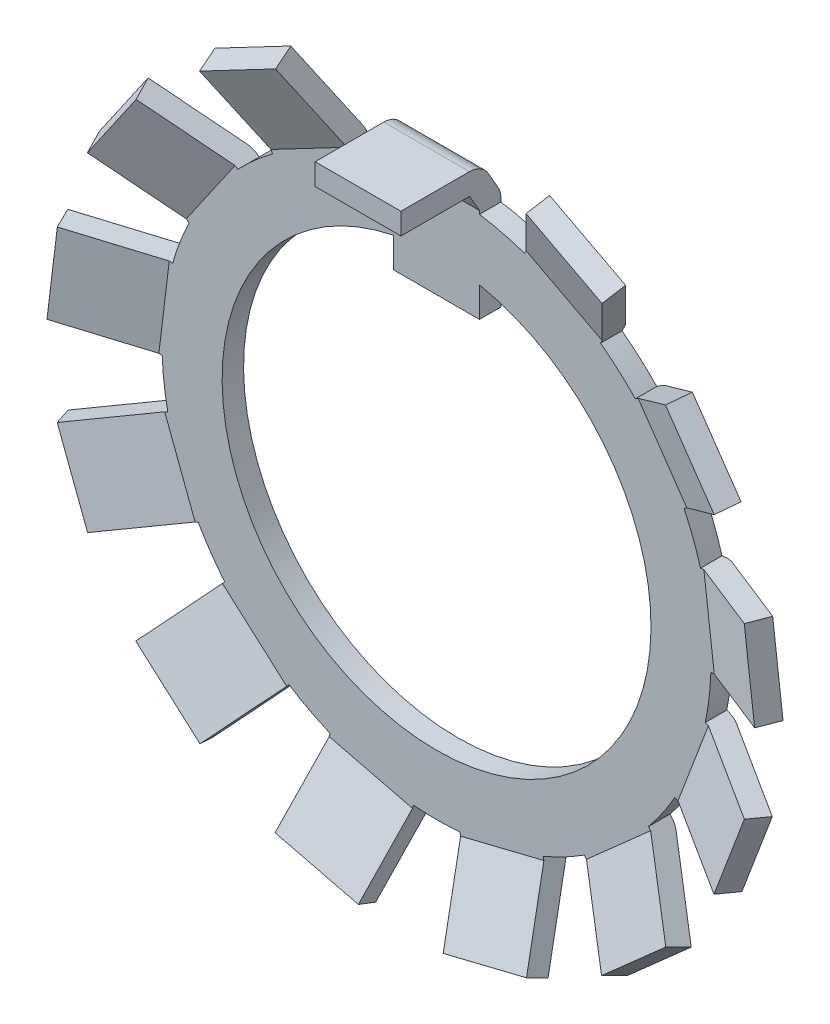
ISO-10303-21;
HEADER;
FILE_DESCRIPTION(('STEP AP214'),'2;1');
FILE_NAME('part.step','',(''),(''),'','','');
FILE_SCHEMA(('AUTOMOTIVE_DESIGN { 1 0 10303 214 1 1 1 1 }'));
ENDSEC;
DATA;
#1=APPLICATION_CONTEXT('core data for automotive mechanical design processes');
#2=APPLICATION_PROTOCOL_DEFINITION('international standard','automotive_design',2000,#1);
#3=PRODUCT_CONTEXT('',#1,'mechanical');
#4=PRODUCT('Part','Part','',(#3));
#5=PRODUCT_RELATED_PRODUCT_CATEGORY('part','',(#4));
#6=PRODUCT_DEFINITION_FORMATION('','',#4);
#7=PRODUCT_DEFINITION_CONTEXT('part definition',#1,'design');
#8=PRODUCT_DEFINITION('design','',#6,#7);
#9=PRODUCT_DEFINITION_SHAPE('','',#8);
#10=(LENGTH_UNIT() NAMED_UNIT(*) SI_UNIT(.MILLI.,.METRE.));
#11=(NAMED_UNIT(*) PLANE_ANGLE_UNIT() SI_UNIT($,.RADIAN.));
#12=(NAMED_UNIT(*) SI_UNIT($,.STERADIAN.) SOLID_ANGLE_UNIT());
#13=UNCERTAINTY_MEASURE_WITH_UNIT(LENGTH_MEASURE(1.E-05),#10,'distance_accuracy_value','');
#14=(GEOMETRIC_REPRESENTATION_CONTEXT(3) GLOBAL_UNCERTAINTY_ASSIGNED_CONTEXT((#13)) GLOBAL_UNIT_ASSIGNED_CONTEXT((#10,
#11,#12)) REPRESENTATION_CONTEXT('',''));
#15=CARTESIAN_POINT('',(0.,0.,0.));
#16=DIRECTION('',(0.,0.,1.));
#17=DIRECTION('',(1.,0.,0.));
#18=AXIS2_PLACEMENT_3D('',#15,#16,#17);
#19=CARTESIAN_POINT('',(0.,0.,1.24999999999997));
#20=DIRECTION('',(0.,0.,-1.));
#21=DIRECTION('',(-1.,0.,0.));
#22=AXIS2_PLACEMENT_3D('',#19,#20,#21);
#23=CYLINDRICAL_SURFACE('',#22,16.);
#24=DIRECTION('',(0.,0.,-1.));
#25=VECTOR('',#24,1.);
#26=CARTESIAN_POINT('',(-2.5,15.8034806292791,1.24999999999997));
#27=LINE('',#26,#25);
#28=CARTESIAN_POINT('',(-2.5,15.8034806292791,0.));
#29=VERTEX_POINT('',#28);
#30=CARTESIAN_POINT('',(-2.5,15.8034806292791,1.24999999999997));
#31=VERTEX_POINT('',#30);
#32=EDGE_CURVE('E55',#29,#31,#27,.F.);
#33=ORIENTED_EDGE('',*,*,#32,.F.);
#34=CARTESIAN_POINT('',(0.,0.,0.));
#35=DIRECTION('',(0.,0.,1.));
#36=DIRECTION('',(1.,0.,0.));
#37=AXIS2_PLACEMENT_3D('',#34,#35,#36);
#38=CIRCLE('',#37,16.);
#39=CARTESIAN_POINT('',(-5.13060358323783,15.1550950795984,0.));
#40=VERTEX_POINT('',#39);
#41=EDGE_CURVE('E1300',#29,#40,#38,.T.);
#42=ORIENTED_EDGE('',*,*,#41,.T.);
#43=DIRECTION('',(0.,0.,-1.));
#44=VECTOR('',#43,1.);
#45=CARTESIAN_POINT('',(-5.13060358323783,15.1550950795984,1.24999999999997));
#46=LINE('',#45,#44);
#47=CARTESIAN_POINT('',(-5.13060358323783,15.1550950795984,1.24999999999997));
#48=VERTEX_POINT('',#47);
#49=EDGE_CURVE('E1312',#40,#48,#46,.F.);
#50=ORIENTED_EDGE('',*,*,#49,.T.);
#51=CARTESIAN_POINT('',(0.,0.,1.24999999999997));
#52=DIRECTION('',(0.,0.,1.));
#53=DIRECTION('',(1.,0.,0.));
#54=AXIS2_PLACEMENT_3D('',#51,#52,#53);
#55=CIRCLE('',#54,16.);
#56=EDGE_CURVE('E1306',#31,#48,#55,.T.);
#57=ORIENTED_EDGE('',*,*,#56,.F.);
#58=EDGE_LOOP('',(#33,#42,#50,#57));
#59=FACE_BOUND('',#58,.T.);
#60=ADVANCED_FACE('F32',(#59),#23,.T.);
#61=CARTESIAN_POINT('',(5.13060358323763,15.1550950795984,0.));
#62=VERTEX_POINT('',#61);
#63=CARTESIAN_POINT('',(2.5,15.8034806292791,0.));
#64=VERTEX_POINT('',#63);
#65=EDGE_CURVE('E1390',#62,#64,#38,.T.);
#66=ORIENTED_EDGE('',*,*,#65,.T.);
#67=DIRECTION('',(0.,0.,-1.));
#68=VECTOR('',#67,1.);
#69=CARTESIAN_POINT('',(2.5,15.8034806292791,1.24999999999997));
#70=LINE('',#69,#68);
#71=CARTESIAN_POINT('',(2.5,15.8034806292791,1.24999999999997));
#72=VERTEX_POINT('',#71);
#73=EDGE_CURVE('E47',#64,#72,#70,.F.);
#74=ORIENTED_EDGE('',*,*,#73,.T.);
#75=CARTESIAN_POINT('',(5.13060358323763,15.1550950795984,1.24999999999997));
#76=VERTEX_POINT('',#75);
#77=EDGE_CURVE('E2302',#76,#72,#55,.T.);
#78=ORIENTED_EDGE('',*,*,#77,.F.);
#79=DIRECTION('',(0.,0.,-1.));
#80=VECTOR('',#79,1.);
#81=CARTESIAN_POINT('',(5.13060358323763,15.1550950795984,1.24999999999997));
#82=LINE('',#81,#80);
#83=EDGE_CURVE('E756',#62,#76,#82,.F.);
#84=ORIENTED_EDGE('',*,*,#83,.F.);
#85=EDGE_LOOP('',(#66,#74,#78,#84));
#86=FACE_BOUND('',#85,.T.);
#87=ADVANCED_FACE('F1438',(#86),#23,.T.);
#88=CARTESIAN_POINT('',(11.5858477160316,11.0348598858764,0.));
#89=VERTEX_POINT('',#88);
#90=CARTESIAN_POINT('',(9.5578837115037,12.8314792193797,0.));
#91=VERTEX_POINT('',#90);
#92=EDGE_CURVE('E1386',#89,#91,#38,.T.);
#93=ORIENTED_EDGE('',*,*,#92,.T.);
#94=DIRECTION('',(0.,0.,-1.));
#95=VECTOR('',#94,1.);
#96=CARTESIAN_POINT('',(9.5578837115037,12.8314792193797,1.24999999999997));
#97=LINE('',#96,#95);
#98=CARTESIAN_POINT('',(9.5578837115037,12.8314792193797,1.24999999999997));
#99=VERTEX_POINT('',#98);
#100=EDGE_CURVE('E759',#91,#99,#97,.F.);
#101=ORIENTED_EDGE('',*,*,#100,.T.);
#102=CARTESIAN_POINT('',(11.5858477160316,11.0348598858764,1.24999999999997));
#103=VERTEX_POINT('',#102);
#104=EDGE_CURVE('E2298',#103,#99,#55,.T.);
#105=ORIENTED_EDGE('',*,*,#104,.F.);
#106=DIRECTION('',(0.,0.,-1.));
#107=VECTOR('',#106,1.);
#108=CARTESIAN_POINT('',(11.5858477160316,11.0348598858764,1.24999999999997));
#109=LINE('',#108,#107);
#110=EDGE_CURVE('E803',#89,#103,#109,.F.);
#111=ORIENTED_EDGE('',*,*,#110,.F.);
#112=EDGE_LOOP('',(#93,#101,#105,#111));
#113=FACE_BOUND('',#112,.T.);
#114=ADVANCED_FACE('F1474',(#113),#23,.T.);
#115=CARTESIAN_POINT('',(15.3869137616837,4.38667127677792,0.));
#116=VERTEX_POINT('',#115);
#117=CARTESIAN_POINT('',(14.4261714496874,6.91994055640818,0.));
#118=VERTEX_POINT('',#117);
#119=EDGE_CURVE('E1382',#116,#118,#38,.T.);
#120=ORIENTED_EDGE('',*,*,#119,.T.);
#121=DIRECTION('',(0.,0.,-1.));
#122=VECTOR('',#121,1.);
#123=CARTESIAN_POINT('',(14.4261714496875,6.91994055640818,1.24999999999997));
#124=LINE('',#123,#122);
#125=CARTESIAN_POINT('',(14.4261714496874,6.91994055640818,1.24999999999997));
#126=VERTEX_POINT('',#125);
#127=EDGE_CURVE('E806',#118,#126,#124,.F.);
#128=ORIENTED_EDGE('',*,*,#127,.T.);
#129=CARTESIAN_POINT('',(15.3869137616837,4.38667127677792,1.24999999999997));
#130=VERTEX_POINT('',#129);
#131=EDGE_CURVE('E2294',#130,#126,#55,.T.);
#132=ORIENTED_EDGE('',*,*,#131,.F.);
#133=DIRECTION('',(0.,0.,-1.));
#134=VECTOR('',#133,1.);
#135=CARTESIAN_POINT('',(15.3869137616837,4.38667127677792,1.24999999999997));
#136=LINE('',#135,#134);
#137=EDGE_CURVE('E851',#116,#130,#136,.F.);
#138=ORIENTED_EDGE('',*,*,#137,.F.);
#139=EDGE_LOOP('',(#120,#128,#132,#138));
#140=FACE_BOUND('',#139,.T.);
#141=ADVANCED_FACE('F1470',(#140),#23,.T.);
#142=CARTESIAN_POINT('',(15.6630232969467,-3.26645085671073,0.));
#143=VERTEX_POINT('',#142);
#144=CARTESIAN_POINT('',(15.9895971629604,-0.576873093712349,0.));
#145=VERTEX_POINT('',#144);
#146=EDGE_CURVE('E1378',#143,#145,#38,.T.);
#147=ORIENTED_EDGE('',*,*,#146,.T.);
#148=DIRECTION('',(0.,0.,-1.));
#149=VECTOR('',#148,1.);
#150=CARTESIAN_POINT('',(15.9895971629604,-0.576873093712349,1.24999999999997));
#151=LINE('',#150,#149);
#152=CARTESIAN_POINT('',(15.9895971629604,-0.576873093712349,1.24999999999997));
#153=VERTEX_POINT('',#152);
#154=EDGE_CURVE('E854',#145,#153,#151,.F.);
#155=ORIENTED_EDGE('',*,*,#154,.T.);
#156=CARTESIAN_POINT('',(15.6630232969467,-3.26645085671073,1.24999999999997));
#157=VERTEX_POINT('',#156);
#158=EDGE_CURVE('E2290',#157,#153,#55,.T.);
#159=ORIENTED_EDGE('',*,*,#158,.F.);
#160=DIRECTION('',(0.,0.,-1.));
#161=VECTOR('',#160,1.);
#162=CARTESIAN_POINT('',(15.6630232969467,-3.26645085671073,1.24999999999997));
#163=LINE('',#162,#161);
#164=EDGE_CURVE('E898',#143,#157,#163,.F.);
#165=ORIENTED_EDGE('',*,*,#164,.F.);
#166=EDGE_LOOP('',(#147,#155,#159,#165));
#167=FACE_BOUND('',#166,.T.);
#168=ADVANCED_FACE('F1466',(#167),#23,.T.);
#169=CARTESIAN_POINT('',(12.3509229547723,-10.1712684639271,0.));
#170=VERTEX_POINT('',#169);
#171=CARTESIAN_POINT('',(13.889998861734,-7.94153207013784,0.));
#172=VERTEX_POINT('',#171);
#173=EDGE_CURVE('E1374',#170,#172,#38,.T.);
#174=ORIENTED_EDGE('',*,*,#173,.T.);
#175=DIRECTION('',(0.,0.,-1.));
#176=VECTOR('',#175,1.);
#177=CARTESIAN_POINT('',(13.889998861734,-7.94153207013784,1.24999999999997));
#178=LINE('',#177,#176);
#179=CARTESIAN_POINT('',(13.889998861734,-7.94153207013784,1.24999999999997));
#180=VERTEX_POINT('',#179);
#181=EDGE_CURVE('E901',#172,#180,#178,.F.);
#182=ORIENTED_EDGE('',*,*,#181,.T.);
#183=CARTESIAN_POINT('',(12.3509229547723,-10.1712684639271,1.24999999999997));
#184=VERTEX_POINT('',#183);
#185=EDGE_CURVE('E2286',#184,#180,#55,.T.);
#186=ORIENTED_EDGE('',*,*,#185,.F.);
#187=DIRECTION('',(0.,0.,-1.));
#188=VECTOR('',#187,1.);
#189=CARTESIAN_POINT('',(12.3509229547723,-10.1712684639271,1.24999999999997));
#190=LINE('',#189,#188);
#191=EDGE_CURVE('E945',#170,#184,#190,.F.);
#192=ORIENTED_EDGE('',*,*,#191,.F.);
#193=EDGE_LOOP('',(#174,#182,#186,#192));
#194=FACE_BOUND('',#193,.T.);
#195=ADVANCED_FACE('F1462',(#194),#23,.T.);
#196=CARTESIAN_POINT('',(6.20937500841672,-14.7459710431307,0.));
#197=VERTEX_POINT('',#196);
#198=CARTESIAN_POINT('',(8.60836921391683,-13.4868817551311,0.));
#199=VERTEX_POINT('',#198);
#200=EDGE_CURVE('E1370',#197,#199,#38,.T.);
#201=ORIENTED_EDGE('',*,*,#200,.T.);
#202=DIRECTION('',(0.,0.,-1.));
#203=VECTOR('',#202,1.);
#204=CARTESIAN_POINT('',(8.60836921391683,-13.4868817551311,1.24999999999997));
#205=LINE('',#204,#203);
#206=CARTESIAN_POINT('',(8.60836921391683,-13.4868817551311,1.24999999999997));
#207=VERTEX_POINT('',#206);
#208=EDGE_CURVE('E948',#199,#207,#205,.F.);
#209=ORIENTED_EDGE('',*,*,#208,.T.);
#210=CARTESIAN_POINT('',(6.20937500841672,-14.7459710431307,1.24999999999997));
#211=VERTEX_POINT('',#210);
#212=EDGE_CURVE('E2282',#211,#207,#55,.T.);
#213=ORIENTED_EDGE('',*,*,#212,.F.);
#214=DIRECTION('',(0.,0.,-1.));
#215=VECTOR('',#214,1.);
#216=CARTESIAN_POINT('',(6.20937500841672,-14.7459710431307,1.24999999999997));
#217=LINE('',#216,#215);
#218=EDGE_CURVE('E992',#197,#211,#217,.F.);
#219=ORIENTED_EDGE('',*,*,#218,.F.);
#220=EDGE_LOOP('',(#201,#209,#213,#219));
#221=FACE_BOUND('',#220,.T.);
#222=ADVANCED_FACE('F1458',(#221),#23,.T.);
#223=CARTESIAN_POINT('',(-1.35466592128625,-15.9425493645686,0.));
#224=VERTEX_POINT('',#223);
#225=CARTESIAN_POINT('',(1.35466592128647,-15.9425493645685,0.));
#226=VERTEX_POINT('',#225);
#227=EDGE_CURVE('E1366',#224,#226,#38,.T.);
#228=ORIENTED_EDGE('',*,*,#227,.T.);
#229=DIRECTION('',(0.,0.,-1.));
#230=VECTOR('',#229,1.);
#231=CARTESIAN_POINT('',(1.35466592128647,-15.9425493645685,1.24999999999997));
#232=LINE('',#231,#230);
#233=CARTESIAN_POINT('',(1.35466592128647,-15.9425493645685,1.24999999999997));
#234=VERTEX_POINT('',#233);
#235=EDGE_CURVE('E995',#226,#234,#232,.F.);
#236=ORIENTED_EDGE('',*,*,#235,.T.);
#237=CARTESIAN_POINT('',(-1.35466592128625,-15.9425493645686,1.24999999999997));
#238=VERTEX_POINT('',#237);
#239=EDGE_CURVE('E2278',#238,#234,#55,.T.);
#240=ORIENTED_EDGE('',*,*,#239,.F.);
#241=DIRECTION('',(0.,0.,-1.));
#242=VECTOR('',#241,1.);
#243=CARTESIAN_POINT('',(-1.35466592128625,-15.9425493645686,1.24999999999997));
#244=LINE('',#243,#242);
#245=EDGE_CURVE('E1039',#224,#238,#244,.F.);
#246=ORIENTED_EDGE('',*,*,#245,.F.);
#247=EDGE_LOOP('',(#228,#236,#240,#246));
#248=FACE_BOUND('',#247,.T.);
#249=ADVANCED_FACE('F1454',(#248),#23,.T.);
#250=CARTESIAN_POINT('',(-8.60836921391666,-13.4868817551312,0.));
#251=VERTEX_POINT('',#250);
#252=CARTESIAN_POINT('',(-6.20937500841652,-14.7459710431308,0.));
#253=VERTEX_POINT('',#252);
#254=EDGE_CURVE('E1362',#251,#253,#38,.T.);
#255=ORIENTED_EDGE('',*,*,#254,.T.);
#256=DIRECTION('',(0.,0.,-1.));
#257=VECTOR('',#256,1.);
#258=CARTESIAN_POINT('',(-6.20937500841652,-14.7459710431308,1.24999999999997));
#259=LINE('',#258,#257);
#260=CARTESIAN_POINT('',(-6.20937500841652,-14.7459710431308,1.24999999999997));
#261=VERTEX_POINT('',#260);
#262=EDGE_CURVE('E1042',#253,#261,#259,.F.);
#263=ORIENTED_EDGE('',*,*,#262,.T.);
#264=CARTESIAN_POINT('',(-8.60836921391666,-13.4868817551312,1.24999999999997));
#265=VERTEX_POINT('',#264);
#266=EDGE_CURVE('E2274',#265,#261,#55,.T.);
#267=ORIENTED_EDGE('',*,*,#266,.F.);
#268=DIRECTION('',(0.,0.,-1.));
#269=VECTOR('',#268,1.);
#270=CARTESIAN_POINT('',(-8.60836921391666,-13.4868817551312,1.24999999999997));
#271=LINE('',#270,#269);
#272=EDGE_CURVE('E1086',#251,#265,#271,.F.);
#273=ORIENTED_EDGE('',*,*,#272,.F.);
#274=EDGE_LOOP('',(#255,#263,#267,#273));
#275=FACE_BOUND('',#274,.T.);
#276=ADVANCED_FACE('F1450',(#275),#23,.T.);
#277=CARTESIAN_POINT('',(-13.8899988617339,-7.94153207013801,0.));
#278=VERTEX_POINT('',#277);
#279=CARTESIAN_POINT('',(-12.3509229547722,-10.1712684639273,0.));
#280=VERTEX_POINT('',#279);
#281=EDGE_CURVE('E1358',#278,#280,#38,.T.);
#282=ORIENTED_EDGE('',*,*,#281,.T.);
#283=DIRECTION('',(0.,0.,-1.));
#284=VECTOR('',#283,1.);
#285=CARTESIAN_POINT('',(-12.3509229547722,-10.1712684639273,1.24999999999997));
#286=LINE('',#285,#284);
#287=CARTESIAN_POINT('',(-12.3509229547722,-10.1712684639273,1.24999999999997));
#288=VERTEX_POINT('',#287);
#289=EDGE_CURVE('E1089',#280,#288,#286,.F.);
#290=ORIENTED_EDGE('',*,*,#289,.T.);
#291=CARTESIAN_POINT('',(-13.8899988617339,-7.94153207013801,1.24999999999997));
#292=VERTEX_POINT('',#291);
#293=EDGE_CURVE('E2272',#292,#288,#55,.T.);
#294=ORIENTED_EDGE('',*,*,#293,.F.);
#295=DIRECTION('',(0.,0.,-1.));
#296=VECTOR('',#295,1.);
#297=CARTESIAN_POINT('',(-13.8899988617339,-7.94153207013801,1.24999999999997));
#298=LINE('',#297,#296);
#299=EDGE_CURVE('E1133',#278,#292,#298,.F.);
#300=ORIENTED_EDGE('',*,*,#299,.F.);
#301=EDGE_LOOP('',(#282,#290,#294,#300));
#302=FACE_BOUND('',#301,.T.);
#303=ADVANCED_FACE('F1446',(#302),#23,.T.);
#304=CARTESIAN_POINT('',(-15.9895971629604,-0.576873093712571,0.));
#305=VERTEX_POINT('',#304);
#306=CARTESIAN_POINT('',(-15.6630232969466,-3.26645085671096,0.));
#307=VERTEX_POINT('',#306);
#308=EDGE_CURVE('E1357',#305,#307,#38,.T.);
#309=ORIENTED_EDGE('',*,*,#308,.T.);
#310=DIRECTION('',(0.,0.,-1.));
#311=VECTOR('',#310,1.);
#312=CARTESIAN_POINT('',(-15.6630232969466,-3.26645085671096,1.24999999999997));
#313=LINE('',#312,#311);
#314=CARTESIAN_POINT('',(-15.6630232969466,-3.26645085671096,1.24999999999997));
#315=VERTEX_POINT('',#314);
#316=EDGE_CURVE('E1136',#307,#315,#313,.F.);
#317=ORIENTED_EDGE('',*,*,#316,.T.);
#318=CARTESIAN_POINT('',(-15.9895971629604,-0.576873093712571,1.24999999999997));
#319=VERTEX_POINT('',#318);
#320=EDGE_CURVE('E2264',#319,#315,#55,.T.);
#321=ORIENTED_EDGE('',*,*,#320,.F.);
#322=DIRECTION('',(0.,0.,-1.));
#323=VECTOR('',#322,1.);
#324=CARTESIAN_POINT('',(-15.9895971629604,-0.576873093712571,1.24999999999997));
#325=LINE('',#324,#323);
#326=EDGE_CURVE('E1180',#305,#319,#325,.F.);
#327=ORIENTED_EDGE('',*,*,#326,.F.);
#328=EDGE_LOOP('',(#309,#317,#321,#327));
#329=FACE_BOUND('',#328,.T.);
#330=ADVANCED_FACE('F1440',(#329),#23,.T.);
#331=CARTESIAN_POINT('',(-14.4261714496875,6.91994055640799,0.));
#332=VERTEX_POINT('',#331);
#333=CARTESIAN_POINT('',(-15.3869137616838,4.38667127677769,0.));
#334=VERTEX_POINT('',#333);
#335=EDGE_CURVE('E1309',#332,#334,#38,.T.);
#336=ORIENTED_EDGE('',*,*,#335,.T.);
#337=DIRECTION('',(0.,0.,-1.));
#338=VECTOR('',#337,1.);
#339=CARTESIAN_POINT('',(-15.3869137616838,4.38667127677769,1.24999999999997));
#340=LINE('',#339,#338);
#341=CARTESIAN_POINT('',(-15.3869137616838,4.38667127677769,1.24999999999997));
#342=VERTEX_POINT('',#341);
#343=EDGE_CURVE('E1183',#334,#342,#340,.F.);
#344=ORIENTED_EDGE('',*,*,#343,.T.);
#345=CARTESIAN_POINT('',(-14.4261714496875,6.91994055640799,1.24999999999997));
#346=VERTEX_POINT('',#345);
#347=EDGE_CURVE('E1305',#346,#342,#55,.T.);
#348=ORIENTED_EDGE('',*,*,#347,.F.);
#349=DIRECTION('',(0.,0.,-1.));
#350=VECTOR('',#349,1.);
#351=CARTESIAN_POINT('',(-14.4261714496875,6.91994055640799,1.24999999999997));
#352=LINE('',#351,#350);
#353=EDGE_CURVE('E40',#332,#346,#352,.F.);
#354=ORIENTED_EDGE('',*,*,#353,.F.);
#355=EDGE_LOOP('',(#336,#344,#348,#354));
#356=FACE_BOUND('',#355,.T.);
#357=ADVANCED_FACE('F1429',(#356),#23,.T.);
#358=CARTESIAN_POINT('',(0.,0.,1.24999999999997));
#359=DIRECTION('',(0.,0.,1.));
#360=DIRECTION('',(1.,0.,0.));
#361=AXIS2_PLACEMENT_3D('',#358,#359,#360);
#362=PLANE('',#361);
#363=ORIENTED_EDGE('',*,*,#77,.T.);
#364=DIRECTION('',(0.,1.,0.));
#365=VECTOR('',#364,1.);
#366=CARTESIAN_POINT('',(2.5,12.5,1.24999999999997));
#367=LINE('',#366,#365);
#368=CARTESIAN_POINT('',(2.5,16.,1.24999999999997));
#369=VERTEX_POINT('',#368);
#370=EDGE_CURVE('E668',#72,#369,#367,.T.);
#371=ORIENTED_EDGE('',*,*,#370,.T.);
#372=DIRECTION('',(-1.,0.,0.));
#373=VECTOR('',#372,1.);
#374=CARTESIAN_POINT('',(2.5,16.,1.24999999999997));
#375=LINE('',#374,#373);
#376=CARTESIAN_POINT('',(-2.5,16.,1.24999999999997));
#377=VERTEX_POINT('',#376);
#378=EDGE_CURVE('E707',#369,#377,#375,.T.);
#379=ORIENTED_EDGE('',*,*,#378,.T.);
#380=DIRECTION('',(0.,1.,0.));
#381=VECTOR('',#380,1.);
#382=CARTESIAN_POINT('',(-2.5,12.5,1.24999999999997));
#383=LINE('',#382,#381);
#384=EDGE_CURVE('E687',#31,#377,#383,.T.);
#385=ORIENTED_EDGE('',*,*,#384,.F.);
#386=ORIENTED_EDGE('',*,*,#56,.T.);
#387=DIRECTION('',(-0.46472317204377,0.88545602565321,0.));
#388=VECTOR('',#387,1.);
#389=CARTESIAN_POINT('',(-3.5953995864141,12.2300082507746,1.24999999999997));
#390=LINE('',#389,#388);
#391=CARTESIAN_POINT('',(-5.22193068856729,15.3291043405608,1.24999999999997));
#392=VERTEX_POINT('',#391);
#393=EDGE_CURVE('E1237',#48,#392,#390,.T.);
#394=ORIENTED_EDGE('',*,*,#393,.T.);
#395=DIRECTION('',(-0.885456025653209,-0.464723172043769,0.));
#396=VECTOR('',#395,1.);
#397=CARTESIAN_POINT('',(-5.22193068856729,15.3291043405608,1.24999999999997));
#398=LINE('',#397,#396);
#399=CARTESIAN_POINT('',(-9.64921081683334,13.0054884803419,1.24999999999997));
#400=VERTEX_POINT('',#399);
#401=EDGE_CURVE('E1263',#392,#400,#398,.T.);
#402=ORIENTED_EDGE('',*,*,#401,.T.);
#403=DIRECTION('',(-0.46472317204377,0.88545602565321,0.));
#404=VECTOR('',#403,1.);
#405=CARTESIAN_POINT('',(-8.02267971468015,9.90639239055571,1.24999999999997));
#406=LINE('',#405,#404);
#407=CARTESIAN_POINT('',(-9.55788371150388,12.8314792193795,1.24999999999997));
#408=VERTEX_POINT('',#407);
#409=EDGE_CURVE('E1252',#408,#400,#406,.T.);
#410=ORIENTED_EDGE('',*,*,#409,.F.);
#411=CARTESIAN_POINT('',(-11.5858477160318,11.0348598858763,1.24999999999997));
#412=VERTEX_POINT('',#411);
#413=EDGE_CURVE('E1301',#408,#412,#55,.T.);
#414=ORIENTED_EDGE('',*,*,#413,.T.);
#415=DIRECTION('',(-0.822983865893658,0.568064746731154,0.));
#416=VECTOR('',#415,1.);
#417=CARTESIAN_POINT('',(-8.86713645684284,9.15826899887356,1.24999999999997));
#418=LINE('',#417,#416);
#419=CARTESIAN_POINT('',(-11.7475799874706,11.1464956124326,1.24999999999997));
#420=VERTEX_POINT('',#419);
#421=EDGE_CURVE('E1195',#412,#420,#418,.T.);
#422=ORIENTED_EDGE('',*,*,#421,.T.);
#423=DIRECTION('',(-0.568064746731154,-0.822983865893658,0.));
#424=VECTOR('',#423,1.);
#425=CARTESIAN_POINT('',(-11.7475799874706,11.1464956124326,1.24999999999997));
#426=LINE('',#425,#424);
#427=CARTESIAN_POINT('',(-14.5879037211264,7.03157628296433,1.24999999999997));
#428=VERTEX_POINT('',#427);
#429=EDGE_CURVE('E1221',#420,#428,#426,.T.);
#430=ORIENTED_EDGE('',*,*,#429,.T.);
#431=DIRECTION('',(-0.822983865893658,0.568064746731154,0.));
#432=VECTOR('',#431,1.);
#433=CARTESIAN_POINT('',(-11.7074601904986,5.04334966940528,1.24999999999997));
#434=LINE('',#433,#432);
#435=EDGE_CURVE('E1210',#346,#428,#434,.T.);
#436=ORIENTED_EDGE('',*,*,#435,.F.);
#437=ORIENTED_EDGE('',*,*,#347,.T.);
#438=DIRECTION('',(-0.992708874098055,0.12053668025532,0.));
#439=VECTOR('',#438,1.);
#440=CARTESIAN_POINT('',(-12.1075192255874,3.98848068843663,1.24999999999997));
#441=LINE('',#440,#439);
#442=CARTESIAN_POINT('',(-15.5820002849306,4.41035906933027,1.24999999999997));
#443=VERTEX_POINT('',#442);
#444=EDGE_CURVE('E1148',#342,#443,#441,.T.);
#445=ORIENTED_EDGE('',*,*,#444,.T.);
#446=DIRECTION('',(-0.12053668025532,-0.992708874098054,0.));
#447=VECTOR('',#446,1.);
#448=CARTESIAN_POINT('',(-15.5820002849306,4.41035906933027,1.24999999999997));
#449=LINE('',#448,#447);
#450=CARTESIAN_POINT('',(-16.1846836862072,-0.553185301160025,1.24999999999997));
#451=VERTEX_POINT('',#450);
#452=EDGE_CURVE('E1174',#443,#451,#449,.T.);
#453=ORIENTED_EDGE('',*,*,#452,.T.);
#454=DIRECTION('',(-0.992708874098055,0.12053668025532,0.));
#455=VECTOR('',#454,1.);
#456=CARTESIAN_POINT('',(-12.710202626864,-0.975063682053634,1.24999999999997));
#457=LINE('',#456,#455);
#458=EDGE_CURVE('E1163',#319,#451,#457,.T.);
#459=ORIENTED_EDGE('',*,*,#458,.F.);
#460=ORIENTED_EDGE('',*,*,#320,.T.);
#461=DIRECTION('',(-0.935016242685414,-0.35460488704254,0.));
#462=VECTOR('',#461,1.);
#463=CARTESIAN_POINT('',(-12.574215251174,-2.09502048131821,1.24999999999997));
#464=LINE('',#463,#462);
#465=CARTESIAN_POINT('',(-15.846772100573,-3.3361375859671,1.24999999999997));
#466=VERTEX_POINT('',#465);
#467=EDGE_CURVE('E1101',#315,#466,#464,.T.);
#468=ORIENTED_EDGE('',*,*,#467,.T.);
#469=DIRECTION('',(0.35460488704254,-0.935016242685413,0.));
#470=VECTOR('',#469,1.);
#471=CARTESIAN_POINT('',(-15.846772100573,-3.3361375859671,1.24999999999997));
#472=LINE('',#471,#470);
#473=CARTESIAN_POINT('',(-14.0737476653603,-8.01121879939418,1.24999999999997));
#474=VERTEX_POINT('',#473);
#475=EDGE_CURVE('E1127',#466,#474,#472,.T.);
#476=ORIENTED_EDGE('',*,*,#475,.T.);
#477=DIRECTION('',(-0.935016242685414,-0.35460488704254,0.));
#478=VECTOR('',#477,1.);
#479=CARTESIAN_POINT('',(-10.8011908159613,-6.77010169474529,1.24999999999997));
#480=LINE('',#479,#478);
#481=EDGE_CURVE('E1116',#292,#474,#480,.T.);
#482=ORIENTED_EDGE('',*,*,#481,.F.);
#483=ORIENTED_EDGE('',*,*,#293,.T.);
#484=DIRECTION('',(-0.663122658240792,-0.748510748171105,0.));
#485=VECTOR('',#484,1.);
#486=CARTESIAN_POINT('',(-10.1603100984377,-7.69857770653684,1.24999999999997));
#487=LINE('',#486,#485);
#488=CARTESIAN_POINT('',(-12.4812394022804,-10.3183653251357,1.24999999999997));
#489=VERTEX_POINT('',#488);
#490=EDGE_CURVE('E1054',#288,#489,#487,.T.);
#491=ORIENTED_EDGE('',*,*,#490,.T.);
#492=DIRECTION('',(0.748510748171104,-0.663122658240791,0.));
#493=VECTOR('',#492,1.);
#494=CARTESIAN_POINT('',(-12.4812394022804,-10.3183653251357,1.24999999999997));
#495=LINE('',#494,#493);
#496=CARTESIAN_POINT('',(-8.73868566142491,-13.6339786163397,1.24999999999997));
#497=VERTEX_POINT('',#496);
#498=EDGE_CURVE('E1080',#489,#497,#495,.T.);
#499=ORIENTED_EDGE('',*,*,#498,.T.);
#500=DIRECTION('',(-0.663122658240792,-0.748510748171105,0.));
#501=VECTOR('',#500,1.);
#502=CARTESIAN_POINT('',(-6.41775635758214,-11.0141909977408,1.24999999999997));
#503=LINE('',#502,#501);
#504=EDGE_CURVE('E1069',#265,#497,#503,.T.);
#505=ORIENTED_EDGE('',*,*,#504,.F.);
#506=ORIENTED_EDGE('',*,*,#266,.T.);
#507=DIRECTION('',(-0.239315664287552,-0.970941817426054,0.));
#508=VECTOR('',#507,1.);
#509=CARTESIAN_POINT('',(-5.41880034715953,-11.5384835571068,1.24999999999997));
#510=LINE('',#509,#508);
#511=CARTESIAN_POINT('',(-6.25640517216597,-14.936779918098,1.24999999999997));
#512=VERTEX_POINT('',#511);
#513=EDGE_CURVE('E1007',#261,#512,#510,.T.);
#514=ORIENTED_EDGE('',*,*,#513,.T.);
#515=DIRECTION('',(0.970941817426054,-0.239315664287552,0.));
#516=VECTOR('',#515,1.);
#517=CARTESIAN_POINT('',(-6.25640517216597,-14.936779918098,1.24999999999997));
#518=LINE('',#517,#516);
#519=CARTESIAN_POINT('',(-1.4016960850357,-16.1333582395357,1.24999999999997));
#520=VERTEX_POINT('',#519);
#521=EDGE_CURVE('E1033',#512,#520,#518,.T.);
#522=ORIENTED_EDGE('',*,*,#521,.T.);
#523=DIRECTION('',(-0.239315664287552,-0.970941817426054,0.));
#524=VECTOR('',#523,1.);
#525=CARTESIAN_POINT('',(-0.564091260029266,-12.7350618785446,1.24999999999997));
#526=LINE('',#525,#524);
#527=EDGE_CURVE('E1022',#238,#520,#526,.T.);
#528=ORIENTED_EDGE('',*,*,#527,.F.);
#529=ORIENTED_EDGE('',*,*,#239,.T.);
#530=DIRECTION('',(0.239315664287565,-0.97094181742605,0.));
#531=VECTOR('',#530,1.);
#532=CARTESIAN_POINT('',(0.564091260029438,-12.7350618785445,1.24999999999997));
#533=LINE('',#532,#531);
#534=CARTESIAN_POINT('',(1.40169608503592,-16.1333582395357,1.24999999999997));
#535=VERTEX_POINT('',#534);
#536=EDGE_CURVE('E960',#234,#535,#533,.T.);
#537=ORIENTED_EDGE('',*,*,#536,.T.);
#538=DIRECTION('',(0.97094181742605,0.239315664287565,0.));
#539=VECTOR('',#538,1.);
#540=CARTESIAN_POINT('',(1.40169608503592,-16.1333582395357,1.24999999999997));
#541=LINE('',#540,#539);
#542=CARTESIAN_POINT('',(6.25640517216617,-14.9367799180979,1.24999999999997));
#543=VERTEX_POINT('',#542);
#544=EDGE_CURVE('E986',#535,#543,#541,.T.);
#545=ORIENTED_EDGE('',*,*,#544,.T.);
#546=DIRECTION('',(0.239315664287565,-0.97094181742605,0.));
#547=VECTOR('',#546,1.);
#548=CARTESIAN_POINT('',(5.41880034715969,-11.5384835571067,1.24999999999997));
#549=LINE('',#548,#547);
#550=EDGE_CURVE('E975',#211,#543,#549,.T.);
#551=ORIENTED_EDGE('',*,*,#550,.F.);
#552=ORIENTED_EDGE('',*,*,#212,.T.);
#553=DIRECTION('',(0.663122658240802,-0.748510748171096,0.));
#554=VECTOR('',#553,1.);
#555=CARTESIAN_POINT('',(6.41775635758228,-11.0141909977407,1.24999999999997));
#556=LINE('',#555,#554);
#557=CARTESIAN_POINT('',(8.73868566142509,-13.6339786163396,1.24999999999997));
#558=VERTEX_POINT('',#557);
#559=EDGE_CURVE('E913',#207,#558,#556,.T.);
#560=ORIENTED_EDGE('',*,*,#559,.T.);
#561=DIRECTION('',(0.748510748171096,0.663122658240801,0.));
#562=VECTOR('',#561,1.);
#563=CARTESIAN_POINT('',(8.73868566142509,-13.6339786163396,1.24999999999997));
#564=LINE('',#563,#562);
#565=CARTESIAN_POINT('',(12.4812394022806,-10.3183653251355,1.24999999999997));
#566=VERTEX_POINT('',#565);
#567=EDGE_CURVE('E939',#558,#566,#564,.T.);
#568=ORIENTED_EDGE('',*,*,#567,.T.);
#569=DIRECTION('',(0.663122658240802,-0.748510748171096,0.));
#570=VECTOR('',#569,1.);
#571=CARTESIAN_POINT('',(10.1603100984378,-7.6985777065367,1.24999999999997));
#572=LINE('',#571,#570);
#573=EDGE_CURVE('E928',#184,#566,#572,.T.);
#574=ORIENTED_EDGE('',*,*,#573,.F.);
#575=ORIENTED_EDGE('',*,*,#185,.T.);
#576=DIRECTION('',(0.935016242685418,-0.354604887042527,0.));
#577=VECTOR('',#576,1.);
#578=CARTESIAN_POINT('',(10.8011908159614,-6.77010169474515,1.24999999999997));
#579=LINE('',#578,#577);
#580=CARTESIAN_POINT('',(14.0737476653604,-8.01121879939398,1.24999999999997));
#581=VERTEX_POINT('',#580);
#582=EDGE_CURVE('E866',#180,#581,#579,.T.);
#583=ORIENTED_EDGE('',*,*,#582,.T.);
#584=DIRECTION('',(0.354604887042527,0.935016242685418,0.));
#585=VECTOR('',#584,1.);
#586=CARTESIAN_POINT('',(14.0737476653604,-8.01121879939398,1.24999999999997));
#587=LINE('',#586,#585);
#588=CARTESIAN_POINT('',(15.846772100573,-3.3361375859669,1.24999999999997));
#589=VERTEX_POINT('',#588);
#590=EDGE_CURVE('E892',#581,#589,#587,.T.);
#591=ORIENTED_EDGE('',*,*,#590,.T.);
#592=DIRECTION('',(0.935016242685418,-0.354604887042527,0.));
#593=VECTOR('',#592,1.);
#594=CARTESIAN_POINT('',(12.5742152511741,-2.09502048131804,1.24999999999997));
#595=LINE('',#594,#593);
#596=EDGE_CURVE('E881',#157,#589,#595,.T.);
#597=ORIENTED_EDGE('',*,*,#596,.F.);
#598=ORIENTED_EDGE('',*,*,#158,.T.);
#599=DIRECTION('',(0.992708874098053,0.120536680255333,0.));
#600=VECTOR('',#599,1.);
#601=CARTESIAN_POINT('',(12.710202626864,-0.975063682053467,1.24999999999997));
#602=LINE('',#601,#600);
#603=CARTESIAN_POINT('',(16.1846836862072,-0.553185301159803,1.24999999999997));
#604=VERTEX_POINT('',#603);
#605=EDGE_CURVE('E818',#153,#604,#602,.T.);
#606=ORIENTED_EDGE('',*,*,#605,.T.);
#607=DIRECTION('',(-0.120536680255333,0.992708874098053,0.));
#608=VECTOR('',#607,1.);
#609=CARTESIAN_POINT('',(16.1846836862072,-0.553185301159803,1.24999999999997));
#610=LINE('',#609,#608);
#611=CARTESIAN_POINT('',(15.5820002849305,4.41035906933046,1.24999999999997));
#612=VERTEX_POINT('',#611);
#613=EDGE_CURVE('E845',#604,#612,#610,.T.);
#614=ORIENTED_EDGE('',*,*,#613,.T.);
#615=DIRECTION('',(0.992708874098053,0.120536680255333,0.));
#616=VECTOR('',#615,1.);
#617=CARTESIAN_POINT('',(12.1075192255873,3.9884806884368,1.24999999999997));
#618=LINE('',#617,#616);
#619=EDGE_CURVE('E834',#130,#612,#618,.T.);
#620=ORIENTED_EDGE('',*,*,#619,.F.);
#621=ORIENTED_EDGE('',*,*,#131,.T.);
#622=DIRECTION('',(0.82298386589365,0.568064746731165,0.));
#623=VECTOR('',#622,1.);
#624=CARTESIAN_POINT('',(11.7074601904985,5.04334966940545,1.24999999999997));
#625=LINE('',#624,#623);
#626=CARTESIAN_POINT('',(14.5879037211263,7.03157628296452,1.24999999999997));
#627=VERTEX_POINT('',#626);
#628=EDGE_CURVE('E771',#126,#627,#625,.T.);
#629=ORIENTED_EDGE('',*,*,#628,.T.);
#630=DIRECTION('',(-0.568064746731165,0.82298386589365,0.));
#631=VECTOR('',#630,1.);
#632=CARTESIAN_POINT('',(14.5879037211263,7.03157628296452,1.24999999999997));
#633=LINE('',#632,#631);
#634=CARTESIAN_POINT('',(11.7475799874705,11.1464956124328,1.24999999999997));
#635=VERTEX_POINT('',#634);
#636=EDGE_CURVE('E797',#627,#635,#633,.T.);
#637=ORIENTED_EDGE('',*,*,#636,.T.);
#638=DIRECTION('',(0.82298386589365,0.568064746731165,0.));
#639=VECTOR('',#638,1.);
#640=CARTESIAN_POINT('',(8.86713645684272,9.1582689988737,1.24999999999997));
#641=LINE('',#640,#639);
#642=EDGE_CURVE('E786',#103,#635,#641,.T.);
#643=ORIENTED_EDGE('',*,*,#642,.F.);
#644=ORIENTED_EDGE('',*,*,#104,.T.);
#645=DIRECTION('',(0.464723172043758,0.885456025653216,0.));
#646=VECTOR('',#645,1.);
#647=CARTESIAN_POINT('',(8.02267971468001,9.9063923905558,1.24999999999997));
#648=LINE('',#647,#646);
#649=CARTESIAN_POINT('',(9.64921081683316,13.0054884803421,1.24999999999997));
#650=VERTEX_POINT('',#649);
#651=EDGE_CURVE('E724',#99,#650,#648,.T.);
#652=ORIENTED_EDGE('',*,*,#651,.T.);
#653=DIRECTION('',(-0.885456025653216,0.464723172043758,0.));
#654=VECTOR('',#653,1.);
#655=CARTESIAN_POINT('',(9.64921081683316,13.0054884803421,1.24999999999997));
#656=LINE('',#655,#654);
#657=CARTESIAN_POINT('',(5.22193068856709,15.3291043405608,1.24999999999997));
#658=VERTEX_POINT('',#657);
#659=EDGE_CURVE('E750',#650,#658,#656,.T.);
#660=ORIENTED_EDGE('',*,*,#659,.T.);
#661=DIRECTION('',(0.464723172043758,0.885456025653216,0.));
#662=VECTOR('',#661,1.);
#663=CARTESIAN_POINT('',(3.59539958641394,12.2300082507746,1.24999999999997));
#664=LINE('',#663,#662);
#665=EDGE_CURVE('E739',#76,#658,#664,.T.);
#666=ORIENTED_EDGE('',*,*,#665,.F.);
#667=EDGE_LOOP('',(#363,#371,#379,#385,#386,#394,#402,#410,#414,#422,#430,#436,#437,#445,#453,
#459,#460,#468,#476,#482,#483,#491,#499,#505,#506,#514,#522,#528,#529,#537,#545,#551,#552,#560,
#568,#574,#575,#583,#591,#597,#598,#606,#614,#620,#621,#629,#637,#643,#644,#652,#660,#666));
#668=FACE_BOUND('',#667,.T.);
#669=DIRECTION('',(0.,-1.,0.));
#670=VECTOR('',#669,1.);
#671=CARTESIAN_POINT('',(2.5,10.5,1.24999999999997));
#672=LINE('',#671,#670);
#673=CARTESIAN_POINT('',(2.5,12.2474487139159,1.24999999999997));
#674=VERTEX_POINT('',#673);
#675=CARTESIAN_POINT('',(2.5,10.5,1.24999999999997));
#676=VERTEX_POINT('',#675);
#677=EDGE_CURVE('E1275',#674,#676,#672,.T.);
#678=ORIENTED_EDGE('',*,*,#677,.F.);
#679=CARTESIAN_POINT('',(0.,0.,1.24999999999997));
#680=DIRECTION('',(0.,0.,1.));
#681=DIRECTION('',(1.,0.,0.));
#682=AXIS2_PLACEMENT_3D('',#679,#680,#681);
#683=CIRCLE('',#682,12.5);
#684=CARTESIAN_POINT('',(-2.5,12.2474487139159,1.24999999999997));
#685=VERTEX_POINT('',#684);
#686=EDGE_CURVE('E1272',#685,#674,#683,.T.);
#687=ORIENTED_EDGE('',*,*,#686,.F.);
#688=DIRECTION('',(0.,1.,0.));
#689=VECTOR('',#688,1.);
#690=CARTESIAN_POINT('',(-2.5,10.5,1.24999999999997));
#691=LINE('',#690,#689);
#692=CARTESIAN_POINT('',(-2.5,10.5,1.24999999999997));
#693=VERTEX_POINT('',#692);
#694=EDGE_CURVE('E1270',#693,#685,#691,.T.);
#695=ORIENTED_EDGE('',*,*,#694,.F.);
#696=DIRECTION('',(-1.,0.,0.));
#697=VECTOR('',#696,1.);
#698=CARTESIAN_POINT('',(-2.5,10.5,1.24999999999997));
#699=LINE('',#698,#697);
#700=EDGE_CURVE('E1278',#676,#693,#699,.T.);
#701=ORIENTED_EDGE('',*,*,#700,.F.);
#702=EDGE_LOOP('',(#678,#687,#695,#701));
#703=FACE_BOUND('',#702,.T.);
#704=ADVANCED_FACE('F1325',(#668,#703),#362,.T.);
#705=CARTESIAN_POINT('',(0.,0.,0.));
#706=DIRECTION('',(0.,0.,1.));
#707=DIRECTION('',(1.,0.,0.));
#708=AXIS2_PLACEMENT_3D('',#705,#706,#707);
#709=PLANE('',#708);
#710=DIRECTION('',(0.,1.,0.));
#711=VECTOR('',#710,1.);
#712=CARTESIAN_POINT('',(-2.5,12.5,0.));
#713=LINE('',#712,#711);
#714=CARTESIAN_POINT('',(-2.5,16.,0.));
#715=VERTEX_POINT('',#714);
#716=EDGE_CURVE('E690',#29,#715,#713,.T.);
#717=ORIENTED_EDGE('',*,*,#716,.T.);
#718=DIRECTION('',(-1.,0.,0.));
#719=VECTOR('',#718,1.);
#720=CARTESIAN_POINT('',(2.5,16.,0.));
#721=LINE('',#720,#719);
#722=CARTESIAN_POINT('',(2.5,16.,0.));
#723=VERTEX_POINT('',#722);
#724=EDGE_CURVE('E705',#723,#715,#721,.T.);
#725=ORIENTED_EDGE('',*,*,#724,.F.);
#726=DIRECTION('',(0.,1.,0.));
#727=VECTOR('',#726,1.);
#728=CARTESIAN_POINT('',(2.5,12.5,0.));
#729=LINE('',#728,#727);
#730=EDGE_CURVE('E670',#64,#723,#729,.T.);
#731=ORIENTED_EDGE('',*,*,#730,.F.);
#732=ORIENTED_EDGE('',*,*,#65,.F.);
#733=DIRECTION('',(0.464723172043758,0.885456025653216,0.));
#734=VECTOR('',#733,1.);
#735=CARTESIAN_POINT('',(3.59539958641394,12.2300082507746,0.));
#736=LINE('',#735,#734);
#737=CARTESIAN_POINT('',(5.22193068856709,15.3291043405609,0.));
#738=VERTEX_POINT('',#737);
#739=EDGE_CURVE('E742',#62,#738,#736,.T.);
#740=ORIENTED_EDGE('',*,*,#739,.T.);
#741=DIRECTION('',(-0.885456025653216,0.464723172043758,0.));
#742=VECTOR('',#741,1.);
#743=CARTESIAN_POINT('',(9.64921081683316,13.0054884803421,0.));
#744=LINE('',#743,#742);
#745=CARTESIAN_POINT('',(9.64921081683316,13.0054884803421,0.));
#746=VERTEX_POINT('',#745);
#747=EDGE_CURVE('E748',#746,#738,#744,.T.);
#748=ORIENTED_EDGE('',*,*,#747,.F.);
#749=DIRECTION('',(0.464723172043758,0.885456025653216,0.));
#750=VECTOR('',#749,1.);
#751=CARTESIAN_POINT('',(8.02267971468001,9.9063923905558,0.));
#752=LINE('',#751,#750);
#753=EDGE_CURVE('E726',#91,#746,#752,.T.);
#754=ORIENTED_EDGE('',*,*,#753,.F.);
#755=ORIENTED_EDGE('',*,*,#92,.F.);
#756=DIRECTION('',(0.822983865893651,0.568064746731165,0.));
#757=VECTOR('',#756,1.);
#758=CARTESIAN_POINT('',(8.86713645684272,9.1582689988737,0.));
#759=LINE('',#758,#757);
#760=CARTESIAN_POINT('',(11.7475799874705,11.1464956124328,0.));
#761=VERTEX_POINT('',#760);
#762=EDGE_CURVE('E789',#89,#761,#759,.T.);
#763=ORIENTED_EDGE('',*,*,#762,.T.);
#764=DIRECTION('',(-0.568064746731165,0.82298386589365,0.));
#765=VECTOR('',#764,1.);
#766=CARTESIAN_POINT('',(14.5879037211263,7.03157628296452,0.));
#767=LINE('',#766,#765);
#768=CARTESIAN_POINT('',(14.5879037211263,7.03157628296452,0.));
#769=VERTEX_POINT('',#768);
#770=EDGE_CURVE('E795',#769,#761,#767,.T.);
#771=ORIENTED_EDGE('',*,*,#770,.F.);
#772=DIRECTION('',(0.822983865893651,0.568064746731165,0.));
#773=VECTOR('',#772,1.);
#774=CARTESIAN_POINT('',(11.7074601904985,5.04334966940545,0.));
#775=LINE('',#774,#773);
#776=EDGE_CURVE('E773',#118,#769,#775,.T.);
#777=ORIENTED_EDGE('',*,*,#776,.F.);
#778=ORIENTED_EDGE('',*,*,#119,.F.);
#779=DIRECTION('',(0.992708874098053,0.120536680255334,0.));
#780=VECTOR('',#779,1.);
#781=CARTESIAN_POINT('',(12.1075192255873,3.9884806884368,0.));
#782=LINE('',#781,#780);
#783=CARTESIAN_POINT('',(15.5820002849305,4.41035906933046,0.));
#784=VERTEX_POINT('',#783);
#785=EDGE_CURVE('E837',#116,#784,#782,.T.);
#786=ORIENTED_EDGE('',*,*,#785,.T.);
#787=DIRECTION('',(-0.120536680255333,0.992708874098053,0.));
#788=VECTOR('',#787,1.);
#789=CARTESIAN_POINT('',(16.1846836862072,-0.553185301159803,0.));
#790=LINE('',#789,#788);
#791=CARTESIAN_POINT('',(16.1846836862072,-0.553185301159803,0.));
#792=VERTEX_POINT('',#791);
#793=EDGE_CURVE('E843',#792,#784,#790,.T.);
#794=ORIENTED_EDGE('',*,*,#793,.F.);
#795=DIRECTION('',(0.992708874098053,0.120536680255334,0.));
#796=VECTOR('',#795,1.);
#797=CARTESIAN_POINT('',(12.710202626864,-0.975063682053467,0.));
#798=LINE('',#797,#796);
#799=EDGE_CURVE('E821',#145,#792,#798,.T.);
#800=ORIENTED_EDGE('',*,*,#799,.F.);
#801=ORIENTED_EDGE('',*,*,#146,.F.);
#802=DIRECTION('',(0.935016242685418,-0.354604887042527,0.));
#803=VECTOR('',#802,1.);
#804=CARTESIAN_POINT('',(12.5742152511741,-2.09502048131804,0.));
#805=LINE('',#804,#803);
#806=CARTESIAN_POINT('',(15.846772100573,-3.3361375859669,0.));
#807=VERTEX_POINT('',#806);
#808=EDGE_CURVE('E884',#143,#807,#805,.T.);
#809=ORIENTED_EDGE('',*,*,#808,.T.);
#810=DIRECTION('',(0.354604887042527,0.935016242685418,0.));
#811=VECTOR('',#810,1.);
#812=CARTESIAN_POINT('',(14.0737476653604,-8.01121879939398,0.));
#813=LINE('',#812,#811);
#814=CARTESIAN_POINT('',(14.0737476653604,-8.01121879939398,0.));
#815=VERTEX_POINT('',#814);
#816=EDGE_CURVE('E890',#815,#807,#813,.T.);
#817=ORIENTED_EDGE('',*,*,#816,.F.);
#818=DIRECTION('',(0.935016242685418,-0.354604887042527,0.));
#819=VECTOR('',#818,1.);
#820=CARTESIAN_POINT('',(10.8011908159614,-6.77010169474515,0.));
#821=LINE('',#820,#819);
#822=EDGE_CURVE('E868',#172,#815,#821,.T.);
#823=ORIENTED_EDGE('',*,*,#822,.F.);
#824=ORIENTED_EDGE('',*,*,#173,.F.);
#825=DIRECTION('',(0.663122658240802,-0.748510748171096,0.));
#826=VECTOR('',#825,1.);
#827=CARTESIAN_POINT('',(10.1603100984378,-7.6985777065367,0.));
#828=LINE('',#827,#826);
#829=CARTESIAN_POINT('',(12.4812394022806,-10.3183653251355,0.));
#830=VERTEX_POINT('',#829);
#831=EDGE_CURVE('E931',#170,#830,#828,.T.);
#832=ORIENTED_EDGE('',*,*,#831,.T.);
#833=DIRECTION('',(0.748510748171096,0.663122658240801,0.));
#834=VECTOR('',#833,1.);
#835=CARTESIAN_POINT('',(8.73868566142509,-13.6339786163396,0.));
#836=LINE('',#835,#834);
#837=CARTESIAN_POINT('',(8.73868566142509,-13.6339786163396,0.));
#838=VERTEX_POINT('',#837);
#839=EDGE_CURVE('E937',#838,#830,#836,.T.);
#840=ORIENTED_EDGE('',*,*,#839,.F.);
#841=DIRECTION('',(0.663122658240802,-0.748510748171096,0.));
#842=VECTOR('',#841,1.);
#843=CARTESIAN_POINT('',(6.41775635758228,-11.0141909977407,0.));
#844=LINE('',#843,#842);
#845=EDGE_CURVE('E915',#199,#838,#844,.T.);
#846=ORIENTED_EDGE('',*,*,#845,.F.);
#847=ORIENTED_EDGE('',*,*,#200,.F.);
#848=DIRECTION('',(0.239315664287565,-0.970941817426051,0.));
#849=VECTOR('',#848,1.);
#850=CARTESIAN_POINT('',(5.41880034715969,-11.5384835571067,0.));
#851=LINE('',#850,#849);
#852=CARTESIAN_POINT('',(6.25640517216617,-14.9367799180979,0.));
#853=VERTEX_POINT('',#852);
#854=EDGE_CURVE('E978',#197,#853,#851,.T.);
#855=ORIENTED_EDGE('',*,*,#854,.T.);
#856=DIRECTION('',(0.97094181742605,0.239315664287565,0.));
#857=VECTOR('',#856,1.);
#858=CARTESIAN_POINT('',(1.40169608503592,-16.1333582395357,0.));
#859=LINE('',#858,#857);
#860=CARTESIAN_POINT('',(1.40169608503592,-16.1333582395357,0.));
#861=VERTEX_POINT('',#860);
#862=EDGE_CURVE('E984',#861,#853,#859,.T.);
#863=ORIENTED_EDGE('',*,*,#862,.F.);
#864=DIRECTION('',(0.239315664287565,-0.970941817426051,0.));
#865=VECTOR('',#864,1.);
#866=CARTESIAN_POINT('',(0.564091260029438,-12.7350618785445,0.));
#867=LINE('',#866,#865);
#868=EDGE_CURVE('E962',#226,#861,#867,.T.);
#869=ORIENTED_EDGE('',*,*,#868,.F.);
#870=ORIENTED_EDGE('',*,*,#227,.F.);
#871=DIRECTION('',(-0.239315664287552,-0.970941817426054,0.));
#872=VECTOR('',#871,1.);
#873=CARTESIAN_POINT('',(-0.564091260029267,-12.7350618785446,0.));
#874=LINE('',#873,#872);
#875=CARTESIAN_POINT('',(-1.4016960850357,-16.1333582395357,0.));
#876=VERTEX_POINT('',#875);
#877=EDGE_CURVE('E1025',#224,#876,#874,.T.);
#878=ORIENTED_EDGE('',*,*,#877,.T.);
#879=DIRECTION('',(0.970941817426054,-0.239315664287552,0.));
#880=VECTOR('',#879,1.);
#881=CARTESIAN_POINT('',(-6.25640517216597,-14.936779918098,0.));
#882=LINE('',#881,#880);
#883=CARTESIAN_POINT('',(-6.25640517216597,-14.936779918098,0.));
#884=VERTEX_POINT('',#883);
#885=EDGE_CURVE('E1031',#884,#876,#882,.T.);
#886=ORIENTED_EDGE('',*,*,#885,.F.);
#887=DIRECTION('',(-0.239315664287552,-0.970941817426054,0.));
#888=VECTOR('',#887,1.);
#889=CARTESIAN_POINT('',(-5.41880034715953,-11.5384835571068,0.));
#890=LINE('',#889,#888);
#891=EDGE_CURVE('E1009',#253,#884,#890,.T.);
#892=ORIENTED_EDGE('',*,*,#891,.F.);
#893=ORIENTED_EDGE('',*,*,#254,.F.);
#894=DIRECTION('',(-0.663122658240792,-0.748510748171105,0.));
#895=VECTOR('',#894,1.);
#896=CARTESIAN_POINT('',(-6.41775635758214,-11.0141909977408,0.));
#897=LINE('',#896,#895);
#898=CARTESIAN_POINT('',(-8.73868566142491,-13.6339786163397,0.));
#899=VERTEX_POINT('',#898);
#900=EDGE_CURVE('E1072',#251,#899,#897,.T.);
#901=ORIENTED_EDGE('',*,*,#900,.T.);
#902=DIRECTION('',(0.748510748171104,-0.663122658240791,0.));
#903=VECTOR('',#902,1.);
#904=CARTESIAN_POINT('',(-12.4812394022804,-10.3183653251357,0.));
#905=LINE('',#904,#903);
#906=CARTESIAN_POINT('',(-12.4812394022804,-10.3183653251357,0.));
#907=VERTEX_POINT('',#906);
#908=EDGE_CURVE('E1078',#907,#899,#905,.T.);
#909=ORIENTED_EDGE('',*,*,#908,.F.);
#910=DIRECTION('',(-0.663122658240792,-0.748510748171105,0.));
#911=VECTOR('',#910,1.);
#912=CARTESIAN_POINT('',(-10.1603100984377,-7.69857770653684,0.));
#913=LINE('',#912,#911);
#914=EDGE_CURVE('E1056',#280,#907,#913,.T.);
#915=ORIENTED_EDGE('',*,*,#914,.F.);
#916=ORIENTED_EDGE('',*,*,#281,.F.);
#917=DIRECTION('',(-0.935016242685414,-0.35460488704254,0.));
#918=VECTOR('',#917,1.);
#919=CARTESIAN_POINT('',(-10.8011908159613,-6.77010169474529,0.));
#920=LINE('',#919,#918);
#921=CARTESIAN_POINT('',(-14.0737476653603,-8.01121879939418,0.));
#922=VERTEX_POINT('',#921);
#923=EDGE_CURVE('E1119',#278,#922,#920,.T.);
#924=ORIENTED_EDGE('',*,*,#923,.T.);
#925=DIRECTION('',(0.35460488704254,-0.935016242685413,0.));
#926=VECTOR('',#925,1.);
#927=CARTESIAN_POINT('',(-15.846772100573,-3.3361375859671,0.));
#928=LINE('',#927,#926);
#929=CARTESIAN_POINT('',(-15.846772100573,-3.3361375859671,0.));
#930=VERTEX_POINT('',#929);
#931=EDGE_CURVE('E1125',#930,#922,#928,.T.);
#932=ORIENTED_EDGE('',*,*,#931,.F.);
#933=DIRECTION('',(-0.935016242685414,-0.35460488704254,0.));
#934=VECTOR('',#933,1.);
#935=CARTESIAN_POINT('',(-12.574215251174,-2.09502048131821,0.));
#936=LINE('',#935,#934);
#937=EDGE_CURVE('E1103',#307,#930,#936,.T.);
#938=ORIENTED_EDGE('',*,*,#937,.F.);
#939=ORIENTED_EDGE('',*,*,#308,.F.);
#940=DIRECTION('',(-0.992708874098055,0.12053668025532,0.));
#941=VECTOR('',#940,1.);
#942=CARTESIAN_POINT('',(-12.710202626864,-0.975063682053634,0.));
#943=LINE('',#942,#941);
#944=CARTESIAN_POINT('',(-16.1846836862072,-0.553185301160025,0.));
#945=VERTEX_POINT('',#944);
#946=EDGE_CURVE('E1166',#305,#945,#943,.T.);
#947=ORIENTED_EDGE('',*,*,#946,.T.);
#948=DIRECTION('',(-0.12053668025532,-0.992708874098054,0.));
#949=VECTOR('',#948,1.);
#950=CARTESIAN_POINT('',(-15.5820002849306,4.41035906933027,0.));
#951=LINE('',#950,#949);
#952=CARTESIAN_POINT('',(-15.5820002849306,4.41035906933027,0.));
#953=VERTEX_POINT('',#952);
#954=EDGE_CURVE('E1172',#953,#945,#951,.T.);
#955=ORIENTED_EDGE('',*,*,#954,.F.);
#956=DIRECTION('',(-0.992708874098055,0.12053668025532,0.));
#957=VECTOR('',#956,1.);
#958=CARTESIAN_POINT('',(-12.1075192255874,3.98848068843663,0.));
#959=LINE('',#958,#957);
#960=EDGE_CURVE('E1150',#334,#953,#959,.T.);
#961=ORIENTED_EDGE('',*,*,#960,.F.);
#962=ORIENTED_EDGE('',*,*,#335,.F.);
#963=DIRECTION('',(-0.822983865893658,0.568064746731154,0.));
#964=VECTOR('',#963,1.);
#965=CARTESIAN_POINT('',(-11.7074601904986,5.04334966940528,0.));
#966=LINE('',#965,#964);
#967=CARTESIAN_POINT('',(-14.5879037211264,7.03157628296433,0.));
#968=VERTEX_POINT('',#967);
#969=EDGE_CURVE('E1213',#332,#968,#966,.T.);
#970=ORIENTED_EDGE('',*,*,#969,.T.);
#971=DIRECTION('',(-0.568064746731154,-0.822983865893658,0.));
#972=VECTOR('',#971,1.);
#973=CARTESIAN_POINT('',(-11.7475799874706,11.1464956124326,0.));
#974=LINE('',#973,#972);
#975=CARTESIAN_POINT('',(-11.7475799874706,11.1464956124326,0.));
#976=VERTEX_POINT('',#975);
#977=EDGE_CURVE('E1219',#976,#968,#974,.T.);
#978=ORIENTED_EDGE('',*,*,#977,.F.);
#979=DIRECTION('',(-0.822983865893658,0.568064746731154,0.));
#980=VECTOR('',#979,1.);
#981=CARTESIAN_POINT('',(-8.86713645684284,9.15826899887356,0.));
#982=LINE('',#981,#980);
#983=CARTESIAN_POINT('',(-11.5858477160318,11.0348598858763,0.));
#984=VERTEX_POINT('',#983);
#985=EDGE_CURVE('E1197',#984,#976,#982,.T.);
#986=ORIENTED_EDGE('',*,*,#985,.F.);
#987=CARTESIAN_POINT('',(-9.55788371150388,12.8314792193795,0.));
#988=VERTEX_POINT('',#987);
#989=EDGE_CURVE('E1307',#988,#984,#38,.T.);
#990=ORIENTED_EDGE('',*,*,#989,.F.);
#991=DIRECTION('',(-0.46472317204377,0.88545602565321,0.));
#992=VECTOR('',#991,1.);
#993=CARTESIAN_POINT('',(-8.02267971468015,9.90639239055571,0.));
#994=LINE('',#993,#992);
#995=CARTESIAN_POINT('',(-9.64921081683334,13.0054884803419,0.));
#996=VERTEX_POINT('',#995);
#997=EDGE_CURVE('E1255',#988,#996,#994,.T.);
#998=ORIENTED_EDGE('',*,*,#997,.T.);
#999=DIRECTION('',(-0.885456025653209,-0.464723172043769,0.));
#1000=VECTOR('',#999,1.);
#1001=CARTESIAN_POINT('',(-5.22193068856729,15.3291043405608,0.));
#1002=LINE('',#1001,#1000);
#1003=CARTESIAN_POINT('',(-5.22193068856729,15.3291043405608,0.));
#1004=VERTEX_POINT('',#1003);
#1005=EDGE_CURVE('E1261',#1004,#996,#1002,.T.);
#1006=ORIENTED_EDGE('',*,*,#1005,.F.);
#1007=DIRECTION('',(-0.46472317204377,0.88545602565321,0.));
#1008=VECTOR('',#1007,1.);
#1009=CARTESIAN_POINT('',(-3.5953995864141,12.2300082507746,0.));
#1010=LINE('',#1009,#1008);
#1011=EDGE_CURVE('E1239',#40,#1004,#1010,.T.);
#1012=ORIENTED_EDGE('',*,*,#1011,.F.);
#1013=ORIENTED_EDGE('',*,*,#41,.F.);
#1014=EDGE_LOOP('',(#717,#725,#731,#732,#740,#748,#754,#755,#763,#771,#777,#778,#786,#794,#800,
#801,#809,#817,#823,#824,#832,#840,#846,#847,#855,#863,#869,#870,#878,#886,#892,#893,#901,#909,
#915,#916,#924,#932,#938,#939,#947,#955,#961,#962,#970,#978,#986,#990,#998,#1006,#1012,#1013));
#1015=FACE_BOUND('',#1014,.T.);
#1016=CARTESIAN_POINT('',(0.,0.,0.));
#1017=DIRECTION('',(0.,0.,1.));
#1018=DIRECTION('',(1.,0.,0.));
#1019=AXIS2_PLACEMENT_3D('',#1016,#1017,#1018);
#1020=CIRCLE('',#1019,12.5);
#1021=CARTESIAN_POINT('',(-2.5,12.2474487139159,0.));
#1022=VERTEX_POINT('',#1021);
#1023=CARTESIAN_POINT('',(2.5,12.2474487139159,0.));
#1024=VERTEX_POINT('',#1023);
#1025=EDGE_CURVE('E1283',#1022,#1024,#1020,.T.);
#1026=ORIENTED_EDGE('',*,*,#1025,.T.);
#1027=DIRECTION('',(0.,-1.,0.));
#1028=VECTOR('',#1027,1.);
#1029=CARTESIAN_POINT('',(2.5,10.5,0.));
#1030=LINE('',#1029,#1028);
#1031=CARTESIAN_POINT('',(2.5,10.5,0.));
#1032=VERTEX_POINT('',#1031);
#1033=EDGE_CURVE('E1285',#1024,#1032,#1030,.T.);
#1034=ORIENTED_EDGE('',*,*,#1033,.T.);
#1035=DIRECTION('',(-1.,0.,0.));
#1036=VECTOR('',#1035,1.);
#1037=CARTESIAN_POINT('',(-2.5,10.5,0.));
#1038=LINE('',#1037,#1036);
#1039=CARTESIAN_POINT('',(-2.5,10.5,0.));
#1040=VERTEX_POINT('',#1039);
#1041=EDGE_CURVE('E1273',#1032,#1040,#1038,.T.);
#1042=ORIENTED_EDGE('',*,*,#1041,.T.);
#1043=DIRECTION('',(0.,1.,0.));
#1044=VECTOR('',#1043,1.);
#1045=CARTESIAN_POINT('',(-2.5,10.5,0.));
#1046=LINE('',#1045,#1044);
#1047=EDGE_CURVE('E1269',#1040,#1022,#1046,.T.);
#1048=ORIENTED_EDGE('',*,*,#1047,.T.);
#1049=EDGE_LOOP('',(#1026,#1034,#1042,#1048));
#1050=FACE_BOUND('',#1049,.T.);
#1051=ADVANCED_FACE('F1352',(#1015,#1050),#709,.F.);
#1052=ORIENTED_EDGE('',*,*,#989,.T.);
#1053=DIRECTION('',(0.,0.,-1.));
#1054=VECTOR('',#1053,1.);
#1055=CARTESIAN_POINT('',(-11.5858477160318,11.0348598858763,1.24999999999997));
#1056=LINE('',#1055,#1054);
#1057=EDGE_CURVE('E11',#984,#412,#1056,.F.);
#1058=ORIENTED_EDGE('',*,*,#1057,.T.);
#1059=ORIENTED_EDGE('',*,*,#413,.F.);
#1060=DIRECTION('',(0.,0.,-1.));
#1061=VECTOR('',#1060,1.);
#1062=CARTESIAN_POINT('',(-9.55788371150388,12.8314792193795,1.24999999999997));
#1063=LINE('',#1062,#1061);
#1064=EDGE_CURVE('E1304',#988,#408,#1063,.F.);
#1065=ORIENTED_EDGE('',*,*,#1064,.F.);
#1066=EDGE_LOOP('',(#1052,#1058,#1059,#1065));
#1067=FACE_BOUND('',#1066,.T.);
#1068=ADVANCED_FACE('F34',(#1067),#23,.T.);
#1069=CARTESIAN_POINT('',(-2.5,10.5,1.24999999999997));
#1070=DIRECTION('',(-1.,0.,0.));
#1071=DIRECTION('',(0.,0.,1.));
#1072=AXIS2_PLACEMENT_3D('',#1069,#1070,#1071);
#1073=PLANE('',#1072);
#1074=ORIENTED_EDGE('',*,*,#1047,.F.);
#1075=DIRECTION('',(0.,0.,-1.));
#1076=VECTOR('',#1075,1.);
#1077=CARTESIAN_POINT('',(-2.5,10.5,1.24999999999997));
#1078=LINE('',#1077,#1076);
#1079=EDGE_CURVE('E1280',#693,#1040,#1078,.T.);
#1080=ORIENTED_EDGE('',*,*,#1079,.F.);
#1081=ORIENTED_EDGE('',*,*,#694,.T.);
#1082=DIRECTION('',(0.,0.,-1.));
#1083=VECTOR('',#1082,1.);
#1084=CARTESIAN_POINT('',(-2.5,12.2474487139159,1.24999999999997));
#1085=LINE('',#1084,#1083);
#1086=EDGE_CURVE('E1297',#685,#1022,#1085,.T.);
#1087=ORIENTED_EDGE('',*,*,#1086,.T.);
#1088=EDGE_LOOP('',(#1074,#1080,#1081,#1087));
#1089=FACE_BOUND('',#1088,.T.);
#1090=ADVANCED_FACE('F1428',(#1089),#1073,.T.);
#1091=CARTESIAN_POINT('',(0.,0.,1.24999999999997));
#1092=DIRECTION('',(0.,0.,-1.));
#1093=DIRECTION('',(-1.,0.,0.));
#1094=AXIS2_PLACEMENT_3D('',#1091,#1092,#1093);
#1095=CYLINDRICAL_SURFACE('',#1094,12.5);
#1096=DIRECTION('',(0.,0.,-1.));
#1097=VECTOR('',#1096,1.);
#1098=CARTESIAN_POINT('',(2.5,12.2474487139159,1.24999999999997));
#1099=LINE('',#1098,#1097);
#1100=EDGE_CURVE('E1294',#674,#1024,#1099,.T.);
#1101=ORIENTED_EDGE('',*,*,#1100,.T.);
#1102=ORIENTED_EDGE('',*,*,#1025,.F.);
#1103=ORIENTED_EDGE('',*,*,#1086,.F.);
#1104=ORIENTED_EDGE('',*,*,#686,.T.);
#1105=EDGE_LOOP('',(#1101,#1102,#1103,#1104));
#1106=FACE_BOUND('',#1105,.T.);
#1107=ADVANCED_FACE('F1434',(#1106),#1095,.F.);
#1108=CARTESIAN_POINT('',(2.5,10.5,1.24999999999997));
#1109=DIRECTION('',(1.,0.,0.));
#1110=DIRECTION('',(0.,0.,-1.));
#1111=AXIS2_PLACEMENT_3D('',#1108,#1109,#1110);
#1112=PLANE('',#1111);
#1113=ORIENTED_EDGE('',*,*,#1033,.F.);
#1114=ORIENTED_EDGE('',*,*,#1100,.F.);
#1115=ORIENTED_EDGE('',*,*,#677,.T.);
#1116=DIRECTION('',(0.,0.,-1.));
#1117=VECTOR('',#1116,1.);
#1118=CARTESIAN_POINT('',(2.5,10.5,1.24999999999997));
#1119=LINE('',#1118,#1117);
#1120=EDGE_CURVE('E1292',#676,#1032,#1119,.T.);
#1121=ORIENTED_EDGE('',*,*,#1120,.T.);
#1122=EDGE_LOOP('',(#1113,#1114,#1115,#1121));
#1123=FACE_BOUND('',#1122,.T.);
#1124=ADVANCED_FACE('F1846',(#1123),#1112,.T.);
#1125=CARTESIAN_POINT('',(-2.5,10.5,1.24999999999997));
#1126=DIRECTION('',(0.,-1.,0.));
#1127=DIRECTION('',(0.,0.,-1.));
#1128=AXIS2_PLACEMENT_3D('',#1125,#1126,#1127);
#1129=PLANE('',#1128);
#1130=ORIENTED_EDGE('',*,*,#1041,.F.);
#1131=ORIENTED_EDGE('',*,*,#1120,.F.);
#1132=ORIENTED_EDGE('',*,*,#700,.T.);
#1133=ORIENTED_EDGE('',*,*,#1079,.T.);
#1134=EDGE_LOOP('',(#1130,#1131,#1132,#1133));
#1135=FACE_BOUND('',#1134,.T.);
#1136=ADVANCED_FACE('F1833',(#1135),#1129,.T.);
#1137=CARTESIAN_POINT('',(-5.22193068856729,15.3291043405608,1.24999999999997));
#1138=DIRECTION('',(0.88545602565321,0.46472317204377,0.));
#1139=DIRECTION('',(-0.464723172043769,0.885456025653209,0.));
#1140=AXIS2_PLACEMENT_3D('',#1137,#1138,#1139);
#1141=PLANE('',#1140);
#1142=ORIENTED_EDGE('',*,*,#49,.F.);
#1143=ORIENTED_EDGE('',*,*,#1011,.T.);
#1144=CARTESIAN_POINT('',(-5.22193068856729,15.3291043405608,1.24999999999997));
#1145=DIRECTION('',(0.88545602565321,0.46472317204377,0.));
#1146=DIRECTION('',(-0.46472317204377,0.88545602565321,0.));
#1147=AXIS2_PLACEMENT_3D('',#1144,#1145,#1146);
#1148=CIRCLE('',#1147,1.25);
#1149=CARTESIAN_POINT('',(-5.467431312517,15.7968666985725,0.117115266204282));
#1150=VERTEX_POINT('',#1149);
#1151=EDGE_CURVE('E1241',#1004,#1150,#1148,.T.);
#1152=ORIENTED_EDGE('',*,*,#1151,.T.);
#1153=DIRECTION('',(-0.421182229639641,0.802495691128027,0.422618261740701));
#1154=VECTOR('',#1153,1.);
#1155=CARTESIAN_POINT('',(-5.467431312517,15.7968666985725,0.117115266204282));
#1156=LINE('',#1155,#1154);
#1157=CARTESIAN_POINT('',(-7.54554654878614,19.7563844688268,2.20231589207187));
#1158=VERTEX_POINT('',#1157);
#1159=EDGE_CURVE('E1228',#1150,#1158,#1156,.T.);
#1160=ORIENTED_EDGE('',*,*,#1159,.T.);
#1161=DIRECTION('',(-0.196400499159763,0.374209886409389,-0.906307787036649));
#1162=VECTOR('',#1161,1.);
#1163=CARTESIAN_POINT('',(-7.30004592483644,19.2886221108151,3.33520062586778));
#1164=LINE('',#1163,#1162);
#1165=CARTESIAN_POINT('',(-7.30004592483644,19.2886221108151,3.33520062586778));
#1166=VERTEX_POINT('',#1165);
#1167=EDGE_CURVE('E1230',#1166,#1158,#1164,.T.);
#1168=ORIENTED_EDGE('',*,*,#1167,.F.);
#1169=DIRECTION('',(-0.421182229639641,0.802495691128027,0.422618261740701));
#1170=VECTOR('',#1169,1.);
#1171=CARTESIAN_POINT('',(-5.22193068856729,15.3291043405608,1.24999999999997));
#1172=LINE('',#1171,#1170);
#1173=EDGE_CURVE('E1234',#392,#1166,#1172,.T.);
#1174=ORIENTED_EDGE('',*,*,#1173,.F.);
#1175=ORIENTED_EDGE('',*,*,#393,.F.);
#1176=EDGE_LOOP('',(#1142,#1143,#1152,#1160,#1168,#1174,#1175));
#1177=FACE_BOUND('',#1176,.T.);
#1178=ADVANCED_FACE('F1400',(#1177),#1141,.T.);
#1179=CARTESIAN_POINT('',(-9.64921081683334,13.0054884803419,1.24999999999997));
#1180=DIRECTION('',(0.88545602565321,0.46472317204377,0.));
#1181=DIRECTION('',(-0.464723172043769,0.885456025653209,0.));
#1182=AXIS2_PLACEMENT_3D('',#1179,#1180,#1181);
#1183=PLANE('',#1182);
#1184=ORIENTED_EDGE('',*,*,#997,.F.);
#1185=ORIENTED_EDGE('',*,*,#1064,.T.);
#1186=ORIENTED_EDGE('',*,*,#409,.T.);
#1187=DIRECTION('',(-0.421182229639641,0.802495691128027,0.422618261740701));
#1188=VECTOR('',#1187,1.);
#1189=CARTESIAN_POINT('',(-9.64921081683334,13.0054884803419,1.24999999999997));
#1190=LINE('',#1189,#1188);
#1191=CARTESIAN_POINT('',(-11.7273260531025,16.9650062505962,3.33520062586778));
#1192=VERTEX_POINT('',#1191);
#1193=EDGE_CURVE('E1249',#400,#1192,#1190,.T.);
#1194=ORIENTED_EDGE('',*,*,#1193,.T.);
#1195=DIRECTION('',(-0.196400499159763,0.374209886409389,-0.906307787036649));
#1196=VECTOR('',#1195,1.);
#1197=CARTESIAN_POINT('',(-11.7273260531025,16.9650062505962,3.33520062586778));
#1198=LINE('',#1197,#1196);
#1199=CARTESIAN_POINT('',(-11.9728266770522,17.432768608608,2.20231589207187));
#1200=VERTEX_POINT('',#1199);
#1201=EDGE_CURVE('E1246',#1192,#1200,#1198,.T.);
#1202=ORIENTED_EDGE('',*,*,#1201,.T.);
#1203=DIRECTION('',(-0.421182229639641,0.802495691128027,0.422618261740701));
#1204=VECTOR('',#1203,1.);
#1205=CARTESIAN_POINT('',(-9.89471144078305,13.4732508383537,0.117115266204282));
#1206=LINE('',#1205,#1204);
#1207=CARTESIAN_POINT('',(-9.89471144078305,13.4732508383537,0.117115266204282));
#1208=VERTEX_POINT('',#1207);
#1209=EDGE_CURVE('E1227',#1208,#1200,#1206,.T.);
#1210=ORIENTED_EDGE('',*,*,#1209,.F.);
#1211=CARTESIAN_POINT('',(-9.64921081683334,13.0054884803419,1.24999999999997));
#1212=DIRECTION('',(0.88545602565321,0.46472317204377,0.));
#1213=DIRECTION('',(-0.46472317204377,0.88545602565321,0.));
#1214=AXIS2_PLACEMENT_3D('',#1211,#1212,#1213);
#1215=CIRCLE('',#1214,1.25);
#1216=EDGE_CURVE('E1231',#996,#1208,#1215,.T.);
#1217=ORIENTED_EDGE('',*,*,#1216,.F.);
#1218=EDGE_LOOP('',(#1184,#1185,#1186,#1194,#1202,#1210,#1217));
#1219=FACE_BOUND('',#1218,.T.);
#1220=ADVANCED_FACE('F1425',(#1219),#1183,.F.);
#1221=CARTESIAN_POINT('',(-5.467431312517,15.7968666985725,0.117115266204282));
#1222=DIRECTION('',(0.196400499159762,-0.374209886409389,0.906307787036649));
#1223=DIRECTION('',(0.,-0.924309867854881,-0.381642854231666));
#1224=AXIS2_PLACEMENT_3D('',#1221,#1222,#1223);
#1225=PLANE('',#1224);
#1226=ORIENTED_EDGE('',*,*,#1209,.T.);
#1227=DIRECTION('',(-0.885456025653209,-0.464723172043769,0.));
#1228=VECTOR('',#1227,1.);
#1229=CARTESIAN_POINT('',(-7.54554654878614,19.7563844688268,2.20231589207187));
#1230=LINE('',#1229,#1228);
#1231=EDGE_CURVE('E1267',#1158,#1200,#1230,.T.);
#1232=ORIENTED_EDGE('',*,*,#1231,.F.);
#1233=ORIENTED_EDGE('',*,*,#1159,.F.);
#1234=DIRECTION('',(-0.885456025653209,-0.464723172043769,0.));
#1235=VECTOR('',#1234,1.);
#1236=CARTESIAN_POINT('',(-5.467431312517,15.7968666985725,0.117115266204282));
#1237=LINE('',#1236,#1235);
#1238=EDGE_CURVE('E1243',#1150,#1208,#1237,.T.);
#1239=ORIENTED_EDGE('',*,*,#1238,.T.);
#1240=EDGE_LOOP('',(#1226,#1232,#1233,#1239));
#1241=FACE_BOUND('',#1240,.T.);
#1242=ADVANCED_FACE('F1414',(#1241),#1225,.F.);
#1243=CARTESIAN_POINT('',(-7.30004592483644,19.2886221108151,3.33520062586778));
#1244=DIRECTION('',(-0.421182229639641,0.802495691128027,0.422618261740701));
#1245=DIRECTION('',(0.,-0.46596408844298,0.884803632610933));
#1246=AXIS2_PLACEMENT_3D('',#1243,#1244,#1245);
#1247=PLANE('',#1246);
#1248=ORIENTED_EDGE('',*,*,#1201,.F.);
#1249=DIRECTION('',(-0.885456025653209,-0.464723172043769,0.));
#1250=VECTOR('',#1249,1.);
#1251=CARTESIAN_POINT('',(-7.30004592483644,19.2886221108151,3.33520062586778));
#1252=LINE('',#1251,#1250);
#1253=EDGE_CURVE('E1265',#1166,#1192,#1252,.T.);
#1254=ORIENTED_EDGE('',*,*,#1253,.F.);
#1255=ORIENTED_EDGE('',*,*,#1167,.T.);
#1256=ORIENTED_EDGE('',*,*,#1231,.T.);
#1257=EDGE_LOOP('',(#1248,#1254,#1255,#1256));
#1258=FACE_BOUND('',#1257,.T.);
#1259=ADVANCED_FACE('F1418',(#1258),#1247,.T.);
#1260=CARTESIAN_POINT('',(-5.22193068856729,15.3291043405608,1.24999999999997));
#1261=DIRECTION('',(0.196400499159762,-0.374209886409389,0.906307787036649));
#1262=DIRECTION('',(0.,-0.924309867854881,-0.381642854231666));
#1263=AXIS2_PLACEMENT_3D('',#1260,#1261,#1262);
#1264=PLANE('',#1263);
#1265=ORIENTED_EDGE('',*,*,#1193,.F.);
#1266=ORIENTED_EDGE('',*,*,#401,.F.);
#1267=ORIENTED_EDGE('',*,*,#1173,.T.);
#1268=ORIENTED_EDGE('',*,*,#1253,.T.);
#1269=EDGE_LOOP('',(#1265,#1266,#1267,#1268));
#1270=FACE_BOUND('',#1269,.T.);
#1271=ADVANCED_FACE('F1421',(#1270),#1264,.T.);
#1272=CARTESIAN_POINT('',(-5.22193068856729,15.3291043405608,1.24999999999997));
#1273=DIRECTION('',(-0.885456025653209,-0.464723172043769,0.));
#1274=DIRECTION('',(0.464723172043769,-0.88545602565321,0.));
#1275=AXIS2_PLACEMENT_3D('',#1272,#1273,#1274);
#1276=CYLINDRICAL_SURFACE('',#1275,1.25);
#1277=ORIENTED_EDGE('',*,*,#1216,.T.);
#1278=ORIENTED_EDGE('',*,*,#1238,.F.);
#1279=ORIENTED_EDGE('',*,*,#1151,.F.);
#1280=ORIENTED_EDGE('',*,*,#1005,.T.);
#1281=EDGE_LOOP('',(#1277,#1278,#1279,#1280));
#1282=FACE_BOUND('',#1281,.T.);
#1283=ADVANCED_FACE('F1409',(#1282),#1276,.T.);
#1284=CARTESIAN_POINT('',(-11.7475799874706,11.1464956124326,1.24999999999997));
#1285=DIRECTION('',(0.568064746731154,0.822983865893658,0.));
#1286=DIRECTION('',(-0.822983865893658,0.568064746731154,0.));
#1287=AXIS2_PLACEMENT_3D('',#1284,#1285,#1286);
#1288=PLANE('',#1287);
#1289=ORIENTED_EDGE('',*,*,#1057,.F.);
#1290=ORIENTED_EDGE('',*,*,#985,.T.);
#1291=CARTESIAN_POINT('',(-11.7475799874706,11.1464956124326,1.24999999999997));
#1292=DIRECTION('',(0.568064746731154,0.822983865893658,0.));
#1293=DIRECTION('',(-0.822983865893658,0.568064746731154,0.));
#1294=AXIS2_PLACEMENT_3D('',#1291,#1292,#1293);
#1295=CIRCLE('',#1294,1.25);
#1296=CARTESIAN_POINT('',(-12.1823400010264,11.4465887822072,0.117115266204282));
#1297=VERTEX_POINT('',#1296);
#1298=EDGE_CURVE('E1199',#976,#1297,#1295,.T.);
#1299=ORIENTED_EDGE('',*,*,#1298,.T.);
#1300=DIRECTION('',(-0.745876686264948,0.514841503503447,0.422618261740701));
#1301=VECTOR('',#1300,1.);
#1302=CARTESIAN_POINT('',(-12.1823400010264,11.4465887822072,0.117115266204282));
#1303=LINE('',#1302,#1301);
#1304=CARTESIAN_POINT('',(-15.8624993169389,13.9868193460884,2.20231589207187));
#1305=VERTEX_POINT('',#1304);
#1306=EDGE_CURVE('E1186',#1297,#1305,#1303,.T.);
#1307=ORIENTED_EDGE('',*,*,#1306,.T.);
#1308=DIRECTION('',(-0.34780801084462,0.240074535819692,-0.906307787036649));
#1309=VECTOR('',#1308,1.);
#1310=CARTESIAN_POINT('',(-15.4277393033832,13.6867261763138,3.33520062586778));
#1311=LINE('',#1310,#1309);
#1312=CARTESIAN_POINT('',(-15.4277393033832,13.6867261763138,3.33520062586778));
#1313=VERTEX_POINT('',#1312);
#1314=EDGE_CURVE('E1188',#1313,#1305,#1311,.T.);
#1315=ORIENTED_EDGE('',*,*,#1314,.F.);
#1316=DIRECTION('',(-0.745876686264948,0.514841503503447,0.422618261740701));
#1317=VECTOR('',#1316,1.);
#1318=CARTESIAN_POINT('',(-11.7475799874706,11.1464956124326,1.24999999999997));
#1319=LINE('',#1318,#1317);
#1320=EDGE_CURVE('E1192',#420,#1313,#1319,.T.);
#1321=ORIENTED_EDGE('',*,*,#1320,.F.);
#1322=ORIENTED_EDGE('',*,*,#421,.F.);
#1323=EDGE_LOOP('',(#1289,#1290,#1299,#1307,#1315,#1321,#1322));
#1324=FACE_BOUND('',#1323,.T.);
#1325=ADVANCED_FACE('F1336',(#1324),#1288,.T.);
#1326=CARTESIAN_POINT('',(-14.5879037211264,7.03157628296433,1.24999999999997));
#1327=DIRECTION('',(0.568064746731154,0.822983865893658,0.));
#1328=DIRECTION('',(-0.822983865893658,0.568064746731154,0.));
#1329=AXIS2_PLACEMENT_3D('',#1326,#1327,#1328);
#1330=PLANE('',#1329);
#1331=ORIENTED_EDGE('',*,*,#969,.F.);
#1332=ORIENTED_EDGE('',*,*,#353,.T.);
#1333=ORIENTED_EDGE('',*,*,#435,.T.);
#1334=DIRECTION('',(-0.745876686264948,0.514841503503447,0.422618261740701));
#1335=VECTOR('',#1334,1.);
#1336=CARTESIAN_POINT('',(-14.5879037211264,7.03157628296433,1.24999999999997));
#1337=LINE('',#1336,#1335);
#1338=CARTESIAN_POINT('',(-18.2680630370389,9.5718068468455,3.33520062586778));
#1339=VERTEX_POINT('',#1338);
#1340=EDGE_CURVE('E1207',#428,#1339,#1337,.T.);
#1341=ORIENTED_EDGE('',*,*,#1340,.T.);
#1342=DIRECTION('',(-0.34780801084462,0.240074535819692,-0.906307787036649));
#1343=VECTOR('',#1342,1.);
#1344=CARTESIAN_POINT('',(-18.2680630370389,9.5718068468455,3.33520062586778));
#1345=LINE('',#1344,#1343);
#1346=CARTESIAN_POINT('',(-18.7028230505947,9.87190001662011,2.20231589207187));
#1347=VERTEX_POINT('',#1346);
#1348=EDGE_CURVE('E1204',#1339,#1347,#1345,.T.);
#1349=ORIENTED_EDGE('',*,*,#1348,.T.);
#1350=DIRECTION('',(-0.745876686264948,0.514841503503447,0.422618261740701));
#1351=VECTOR('',#1350,1.);
#1352=CARTESIAN_POINT('',(-15.0226637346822,7.33166945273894,0.117115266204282));
#1353=LINE('',#1352,#1351);
#1354=CARTESIAN_POINT('',(-15.0226637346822,7.33166945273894,0.117115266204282));
#1355=VERTEX_POINT('',#1354);
#1356=EDGE_CURVE('E1185',#1355,#1347,#1353,.T.);
#1357=ORIENTED_EDGE('',*,*,#1356,.F.);
#1358=CARTESIAN_POINT('',(-14.5879037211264,7.03157628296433,1.24999999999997));
#1359=DIRECTION('',(0.568064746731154,0.822983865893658,0.));
#1360=DIRECTION('',(-0.822983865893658,0.568064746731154,0.));
#1361=AXIS2_PLACEMENT_3D('',#1358,#1359,#1360);
#1362=CIRCLE('',#1361,1.25);
#1363=EDGE_CURVE('E1189',#968,#1355,#1362,.T.);
#1364=ORIENTED_EDGE('',*,*,#1363,.F.);
#1365=EDGE_LOOP('',(#1331,#1332,#1333,#1341,#1349,#1357,#1364));
#1366=FACE_BOUND('',#1365,.T.);
#1367=ADVANCED_FACE('F1318',(#1366),#1330,.F.);
#1368=CARTESIAN_POINT('',(-12.1823400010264,11.4465887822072,0.117115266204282));
#1369=DIRECTION('',(0.347808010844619,-0.240074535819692,0.906307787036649));
#1370=DIRECTION('',(0.933611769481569,0.,-0.35828628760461));
#1371=AXIS2_PLACEMENT_3D('',#1368,#1369,#1370);
#1372=PLANE('',#1371);
#1373=ORIENTED_EDGE('',*,*,#1356,.T.);
#1374=DIRECTION('',(-0.568064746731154,-0.822983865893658,0.));
#1375=VECTOR('',#1374,1.);
#1376=CARTESIAN_POINT('',(-15.8624993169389,13.9868193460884,2.20231589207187));
#1377=LINE('',#1376,#1375);
#1378=EDGE_CURVE('E1225',#1305,#1347,#1377,.T.);
#1379=ORIENTED_EDGE('',*,*,#1378,.F.);
#1380=ORIENTED_EDGE('',*,*,#1306,.F.);
#1381=DIRECTION('',(-0.568064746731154,-0.822983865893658,0.));
#1382=VECTOR('',#1381,1.);
#1383=CARTESIAN_POINT('',(-12.1823400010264,11.4465887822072,0.117115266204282));
#1384=LINE('',#1383,#1382);
#1385=EDGE_CURVE('E1201',#1297,#1355,#1384,.T.);
#1386=ORIENTED_EDGE('',*,*,#1385,.T.);
#1387=EDGE_LOOP('',(#1373,#1379,#1380,#1386));
#1388=FACE_BOUND('',#1387,.T.);
#1389=ADVANCED_FACE('F1344',(#1388),#1372,.F.);
#1390=CARTESIAN_POINT('',(-15.4277393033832,13.6867261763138,3.33520062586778));
#1391=DIRECTION('',(-0.745876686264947,0.514841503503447,0.422618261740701));
#1392=DIRECTION('',(-0.568064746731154,-0.822983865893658,0.));
#1393=AXIS2_PLACEMENT_3D('',#1390,#1391,#1392);
#1394=PLANE('',#1393);
#1395=ORIENTED_EDGE('',*,*,#1348,.F.);
#1396=DIRECTION('',(-0.568064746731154,-0.822983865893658,0.));
#1397=VECTOR('',#1396,1.);
#1398=CARTESIAN_POINT('',(-15.4277393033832,13.6867261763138,3.33520062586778));
#1399=LINE('',#1398,#1397);
#1400=EDGE_CURVE('E1223',#1313,#1339,#1399,.T.);
#1401=ORIENTED_EDGE('',*,*,#1400,.F.);
#1402=ORIENTED_EDGE('',*,*,#1314,.T.);
#1403=ORIENTED_EDGE('',*,*,#1378,.T.);
#1404=EDGE_LOOP('',(#1395,#1401,#1402,#1403));
#1405=FACE_BOUND('',#1404,.T.);
#1406=ADVANCED_FACE('F1341',(#1405),#1394,.T.);
#1407=CARTESIAN_POINT('',(-11.7475799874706,11.1464956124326,1.24999999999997));
#1408=DIRECTION('',(0.347808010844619,-0.240074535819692,0.906307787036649));
#1409=DIRECTION('',(0.933611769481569,0.,-0.35828628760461));
#1410=AXIS2_PLACEMENT_3D('',#1407,#1408,#1409);
#1411=PLANE('',#1410);
#1412=ORIENTED_EDGE('',*,*,#1340,.F.);
#1413=ORIENTED_EDGE('',*,*,#429,.F.);
#1414=ORIENTED_EDGE('',*,*,#1320,.T.);
#1415=ORIENTED_EDGE('',*,*,#1400,.T.);
#1416=EDGE_LOOP('',(#1412,#1413,#1414,#1415));
#1417=FACE_BOUND('',#1416,.T.);
#1418=ADVANCED_FACE('F1332',(#1417),#1411,.T.);
#1419=CARTESIAN_POINT('',(-11.7475799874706,11.1464956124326,1.24999999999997));
#1420=DIRECTION('',(-0.568064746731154,-0.822983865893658,0.));
#1421=DIRECTION('',(0.822983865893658,-0.568064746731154,0.));
#1422=AXIS2_PLACEMENT_3D('',#1419,#1420,#1421);
#1423=CYLINDRICAL_SURFACE('',#1422,1.25);
#1424=ORIENTED_EDGE('',*,*,#1363,.T.);
#1425=ORIENTED_EDGE('',*,*,#1385,.F.);
#1426=ORIENTED_EDGE('',*,*,#1298,.F.);
#1427=ORIENTED_EDGE('',*,*,#977,.T.);
#1428=EDGE_LOOP('',(#1424,#1425,#1426,#1427));
#1429=FACE_BOUND('',#1428,.T.);
#1430=ADVANCED_FACE('F1348',(#1429),#1423,.T.);
#1431=CARTESIAN_POINT('',(-15.5820002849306,4.41035906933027,1.24999999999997));
#1432=DIRECTION('',(0.12053668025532,0.992708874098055,0.));
#1433=DIRECTION('',(-0.992708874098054,0.12053668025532,0.));
#1434=AXIS2_PLACEMENT_3D('',#1431,#1432,#1433);
#1435=PLANE('',#1434);
#1436=ORIENTED_EDGE('',*,*,#343,.F.);
#1437=ORIENTED_EDGE('',*,*,#960,.T.);
#1438=CARTESIAN_POINT('',(-15.5820002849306,4.41035906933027,1.24999999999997));
#1439=DIRECTION('',(0.12053668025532,0.992708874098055,0.));
#1440=DIRECTION('',(-0.992708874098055,0.12053668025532,0.));
#1441=AXIS2_PLACEMENT_3D('',#1438,#1439,#1440);
#1442=CIRCLE('',#1441,1.25);
#1443=CARTESIAN_POINT('',(-16.1064214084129,4.47403532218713,0.117115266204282));
#1444=VERTEX_POINT('',#1443);
#1445=EDGE_CURVE('E1152',#953,#1444,#1442,.T.);
#1446=ORIENTED_EDGE('',*,*,#1445,.T.);
#1447=DIRECTION('',(-0.899699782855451,0.109243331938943,0.422618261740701));
#1448=VECTOR('',#1447,1.);
#1449=CARTESIAN_POINT('',(-16.1064214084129,4.47403532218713,0.117115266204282));
#1450=LINE('',#1449,#1448);
#1451=CARTESIAN_POINT('',(-20.5455446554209,5.01304247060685,2.20231589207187));
#1452=VERTEX_POINT('',#1451);
#1453=EDGE_CURVE('E1139',#1444,#1452,#1450,.T.);
#1454=ORIENTED_EDGE('',*,*,#1453,.T.);
#1455=DIRECTION('',(-0.419536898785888,0.050941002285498,-0.906307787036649));
#1456=VECTOR('',#1455,1.);
#1457=CARTESIAN_POINT('',(-20.0211235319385,4.94936621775,3.33520062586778));
#1458=LINE('',#1457,#1456);
#1459=CARTESIAN_POINT('',(-20.0211235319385,4.94936621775,3.33520062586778));
#1460=VERTEX_POINT('',#1459);
#1461=EDGE_CURVE('E1141',#1460,#1452,#1458,.T.);
#1462=ORIENTED_EDGE('',*,*,#1461,.F.);
#1463=DIRECTION('',(-0.899699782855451,0.109243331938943,0.422618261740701));
#1464=VECTOR('',#1463,1.);
#1465=CARTESIAN_POINT('',(-15.5820002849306,4.41035906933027,1.24999999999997));
#1466=LINE('',#1465,#1464);
#1467=EDGE_CURVE('E1145',#443,#1460,#1466,.T.);
#1468=ORIENTED_EDGE('',*,*,#1467,.F.);
#1469=ORIENTED_EDGE('',*,*,#444,.F.);
#1470=EDGE_LOOP('',(#1436,#1437,#1446,#1454,#1462,#1468,#1469));
#1471=FACE_BOUND('',#1470,.T.);
#1472=ADVANCED_FACE('F1796',(#1471),#1435,.T.);
#1473=CARTESIAN_POINT('',(-16.1846836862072,-0.553185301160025,1.24999999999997));
#1474=DIRECTION('',(0.12053668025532,0.992708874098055,0.));
#1475=DIRECTION('',(-0.992708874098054,0.12053668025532,0.));
#1476=AXIS2_PLACEMENT_3D('',#1473,#1474,#1475);
#1477=PLANE('',#1476);
#1478=ORIENTED_EDGE('',*,*,#946,.F.);
#1479=ORIENTED_EDGE('',*,*,#326,.T.);
#1480=ORIENTED_EDGE('',*,*,#458,.T.);
#1481=DIRECTION('',(-0.899699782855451,0.109243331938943,0.422618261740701));
#1482=VECTOR('',#1481,1.);
#1483=CARTESIAN_POINT('',(-16.1846836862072,-0.553185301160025,1.24999999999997));
#1484=LINE('',#1483,#1482);
#1485=CARTESIAN_POINT('',(-20.6238069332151,-0.0141781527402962,3.33520062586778));
#1486=VERTEX_POINT('',#1485);
#1487=EDGE_CURVE('E1160',#451,#1486,#1484,.T.);
#1488=ORIENTED_EDGE('',*,*,#1487,.T.);
#1489=DIRECTION('',(-0.419536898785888,0.050941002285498,-0.906307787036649));
#1490=VECTOR('',#1489,1.);
#1491=CARTESIAN_POINT('',(-20.6238069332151,-0.0141781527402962,3.33520062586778));
#1492=LINE('',#1491,#1490);
#1493=CARTESIAN_POINT('',(-21.1482280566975,0.0494981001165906,2.20231589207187));
#1494=VERTEX_POINT('',#1493);
#1495=EDGE_CURVE('E1157',#1486,#1494,#1492,.T.);
#1496=ORIENTED_EDGE('',*,*,#1495,.T.);
#1497=DIRECTION('',(-0.899699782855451,0.109243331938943,0.422618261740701));
#1498=VECTOR('',#1497,1.);
#1499=CARTESIAN_POINT('',(-16.7091048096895,-0.489509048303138,0.117115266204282));
#1500=LINE('',#1499,#1498);
#1501=CARTESIAN_POINT('',(-16.7091048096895,-0.489509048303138,0.117115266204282));
#1502=VERTEX_POINT('',#1501);
#1503=EDGE_CURVE('E1138',#1502,#1494,#1500,.T.);
#1504=ORIENTED_EDGE('',*,*,#1503,.F.);
#1505=CARTESIAN_POINT('',(-16.1846836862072,-0.553185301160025,1.24999999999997));
#1506=DIRECTION('',(0.12053668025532,0.992708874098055,0.));
#1507=DIRECTION('',(-0.992708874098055,0.12053668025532,0.));
#1508=AXIS2_PLACEMENT_3D('',#1505,#1506,#1507);
#1509=CIRCLE('',#1508,1.25);
#1510=EDGE_CURVE('E1142',#945,#1502,#1509,.T.);
#1511=ORIENTED_EDGE('',*,*,#1510,.F.);
#1512=EDGE_LOOP('',(#1478,#1479,#1480,#1488,#1496,#1504,#1511));
#1513=FACE_BOUND('',#1512,.T.);
#1514=ADVANCED_FACE('F1799',(#1513),#1477,.F.);
#1515=CARTESIAN_POINT('',(-16.1064214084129,4.47403532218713,0.117115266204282));
#1516=DIRECTION('',(0.419536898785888,-0.050941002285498,0.906307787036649));
#1517=DIRECTION('',(0.907486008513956,0.,-0.420082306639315));
#1518=AXIS2_PLACEMENT_3D('',#1515,#1516,#1517);
#1519=PLANE('',#1518);
#1520=ORIENTED_EDGE('',*,*,#1503,.T.);
#1521=DIRECTION('',(-0.12053668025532,-0.992708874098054,0.));
#1522=VECTOR('',#1521,1.);
#1523=CARTESIAN_POINT('',(-20.5455446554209,5.01304247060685,2.20231589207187));
#1524=LINE('',#1523,#1522);
#1525=EDGE_CURVE('E1178',#1452,#1494,#1524,.T.);
#1526=ORIENTED_EDGE('',*,*,#1525,.F.);
#1527=ORIENTED_EDGE('',*,*,#1453,.F.);
#1528=DIRECTION('',(-0.12053668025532,-0.992708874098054,0.));
#1529=VECTOR('',#1528,1.);
#1530=CARTESIAN_POINT('',(-16.1064214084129,4.47403532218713,0.117115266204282));
#1531=LINE('',#1530,#1529);
#1532=EDGE_CURVE('E1154',#1444,#1502,#1531,.T.);
#1533=ORIENTED_EDGE('',*,*,#1532,.T.);
#1534=EDGE_LOOP('',(#1520,#1526,#1527,#1533));
#1535=FACE_BOUND('',#1534,.T.);
#1536=ADVANCED_FACE('F1803',(#1535),#1519,.F.);
#1537=CARTESIAN_POINT('',(-20.0211235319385,4.94936621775,3.33520062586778));
#1538=DIRECTION('',(-0.899699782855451,0.109243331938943,0.422618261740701));
#1539=DIRECTION('',(0.425162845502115,0.,0.905116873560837));
#1540=AXIS2_PLACEMENT_3D('',#1537,#1538,#1539);
#1541=PLANE('',#1540);
#1542=ORIENTED_EDGE('',*,*,#1495,.F.);
#1543=DIRECTION('',(-0.12053668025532,-0.992708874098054,0.));
#1544=VECTOR('',#1543,1.);
#1545=CARTESIAN_POINT('',(-20.0211235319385,4.94936621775,3.33520062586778));
#1546=LINE('',#1545,#1544);
#1547=EDGE_CURVE('E1176',#1460,#1486,#1546,.T.);
#1548=ORIENTED_EDGE('',*,*,#1547,.F.);
#1549=ORIENTED_EDGE('',*,*,#1461,.T.);
#1550=ORIENTED_EDGE('',*,*,#1525,.T.);
#1551=EDGE_LOOP('',(#1542,#1548,#1549,#1550));
#1552=FACE_BOUND('',#1551,.T.);
#1553=ADVANCED_FACE('F1811',(#1552),#1541,.T.);
#1554=CARTESIAN_POINT('',(-15.5820002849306,4.41035906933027,1.24999999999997));
#1555=DIRECTION('',(0.419536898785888,-0.050941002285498,0.906307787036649));
#1556=DIRECTION('',(0.907486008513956,0.,-0.420082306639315));
#1557=AXIS2_PLACEMENT_3D('',#1554,#1555,#1556);
#1558=PLANE('',#1557);
#1559=ORIENTED_EDGE('',*,*,#1487,.F.);
#1560=ORIENTED_EDGE('',*,*,#452,.F.);
#1561=ORIENTED_EDGE('',*,*,#1467,.T.);
#1562=ORIENTED_EDGE('',*,*,#1547,.T.);
#1563=EDGE_LOOP('',(#1559,#1560,#1561,#1562));
#1564=FACE_BOUND('',#1563,.T.);
#1565=ADVANCED_FACE('F1807',(#1564),#1558,.T.);
#1566=CARTESIAN_POINT('',(-15.5820002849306,4.41035906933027,1.24999999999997));
#1567=DIRECTION('',(-0.12053668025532,-0.992708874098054,0.));
#1568=DIRECTION('',(0.992708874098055,-0.12053668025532,0.));
#1569=AXIS2_PLACEMENT_3D('',#1566,#1567,#1568);
#1570=CYLINDRICAL_SURFACE('',#1569,1.25);
#1571=ORIENTED_EDGE('',*,*,#1510,.T.);
#1572=ORIENTED_EDGE('',*,*,#1532,.F.);
#1573=ORIENTED_EDGE('',*,*,#1445,.F.);
#1574=ORIENTED_EDGE('',*,*,#954,.T.);
#1575=EDGE_LOOP('',(#1571,#1572,#1573,#1574));
#1576=FACE_BOUND('',#1575,.T.);
#1577=ADVANCED_FACE('F1776',(#1576),#1570,.T.);
#1578=CARTESIAN_POINT('',(-15.846772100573,-3.3361375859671,1.24999999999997));
#1579=DIRECTION('',(-0.35460488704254,0.935016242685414,0.));
#1580=DIRECTION('',(-0.935016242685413,-0.35460488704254,0.));
#1581=AXIS2_PLACEMENT_3D('',#1578,#1579,#1580);
#1582=PLANE('',#1581);
#1583=ORIENTED_EDGE('',*,*,#316,.F.);
#1584=ORIENTED_EDGE('',*,*,#937,.T.);
#1585=CARTESIAN_POINT('',(-15.846772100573,-3.3361375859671,1.24999999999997));
#1586=DIRECTION('',(-0.35460488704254,0.935016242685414,0.));
#1587=DIRECTION('',(-0.935016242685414,-0.35460488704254,0.));
#1588=AXIS2_PLACEMENT_3D('',#1585,#1586,#1587);
#1589=CIRCLE('',#1588,1.25);
#1590=CARTESIAN_POINT('',(-16.3407157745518,-3.52346571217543,0.117115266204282));
#1591=VERTEX_POINT('',#1590);
#1592=EDGE_CURVE('E1105',#930,#1591,#1589,.T.);
#1593=ORIENTED_EDGE('',*,*,#1592,.T.);
#1594=DIRECTION('',(-0.84741250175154,-0.321381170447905,0.422618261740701));
#1595=VECTOR('',#1594,1.);
#1596=CARTESIAN_POINT('',(-16.3407157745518,-3.52346571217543,0.117115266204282));
#1597=LINE('',#1596,#1595);
#1598=CARTESIAN_POINT('',(-20.521853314,-5.10916202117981,2.20231589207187));
#1599=VERTEX_POINT('',#1598);
#1600=EDGE_CURVE('E1092',#1591,#1599,#1597,.T.);
#1601=ORIENTED_EDGE('',*,*,#1600,.T.);
#1602=DIRECTION('',(-0.395154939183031,-0.149862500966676,-0.906307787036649));
#1603=VECTOR('',#1602,1.);
#1604=CARTESIAN_POINT('',(-20.0279096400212,-4.92183389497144,3.33520062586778));
#1605=LINE('',#1604,#1603);
#1606=CARTESIAN_POINT('',(-20.0279096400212,-4.92183389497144,3.33520062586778));
#1607=VERTEX_POINT('',#1606);
#1608=EDGE_CURVE('E1094',#1607,#1599,#1605,.T.);
#1609=ORIENTED_EDGE('',*,*,#1608,.F.);
#1610=DIRECTION('',(-0.84741250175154,-0.321381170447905,0.422618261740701));
#1611=VECTOR('',#1610,1.);
#1612=CARTESIAN_POINT('',(-15.846772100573,-3.3361375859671,1.24999999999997));
#1613=LINE('',#1612,#1611);
#1614=EDGE_CURVE('E1098',#466,#1607,#1613,.T.);
#1615=ORIENTED_EDGE('',*,*,#1614,.F.);
#1616=ORIENTED_EDGE('',*,*,#467,.F.);
#1617=EDGE_LOOP('',(#1583,#1584,#1593,#1601,#1609,#1615,#1616));
#1618=FACE_BOUND('',#1617,.T.);
#1619=ADVANCED_FACE('F1772',(#1618),#1582,.T.);
#1620=CARTESIAN_POINT('',(-14.0737476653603,-8.01121879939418,1.24999999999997));
#1621=DIRECTION('',(-0.35460488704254,0.935016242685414,0.));
#1622=DIRECTION('',(-0.935016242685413,-0.35460488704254,0.));
#1623=AXIS2_PLACEMENT_3D('',#1620,#1621,#1622);
#1624=PLANE('',#1623);
#1625=ORIENTED_EDGE('',*,*,#923,.F.);
#1626=ORIENTED_EDGE('',*,*,#299,.T.);
#1627=ORIENTED_EDGE('',*,*,#481,.T.);
#1628=DIRECTION('',(-0.84741250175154,-0.321381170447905,0.422618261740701));
#1629=VECTOR('',#1628,1.);
#1630=CARTESIAN_POINT('',(-14.0737476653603,-8.01121879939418,1.24999999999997));
#1631=LINE('',#1630,#1629);
#1632=CARTESIAN_POINT('',(-18.2548852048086,-9.59691510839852,3.33520062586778));
#1633=VERTEX_POINT('',#1632);
#1634=EDGE_CURVE('E1113',#474,#1633,#1631,.T.);
#1635=ORIENTED_EDGE('',*,*,#1634,.T.);
#1636=DIRECTION('',(-0.395154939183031,-0.149862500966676,-0.906307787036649));
#1637=VECTOR('',#1636,1.);
#1638=CARTESIAN_POINT('',(-18.2548852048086,-9.59691510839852,3.33520062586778));
#1639=LINE('',#1638,#1637);
#1640=CARTESIAN_POINT('',(-18.7488288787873,-9.78424323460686,2.20231589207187));
#1641=VERTEX_POINT('',#1640);
#1642=EDGE_CURVE('E1110',#1633,#1641,#1639,.T.);
#1643=ORIENTED_EDGE('',*,*,#1642,.T.);
#1644=DIRECTION('',(-0.84741250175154,-0.321381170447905,0.422618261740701));
#1645=VECTOR('',#1644,1.);
#1646=CARTESIAN_POINT('',(-14.5676913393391,-8.19854692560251,0.117115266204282));
#1647=LINE('',#1646,#1645);
#1648=CARTESIAN_POINT('',(-14.5676913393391,-8.19854692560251,0.117115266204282));
#1649=VERTEX_POINT('',#1648);
#1650=EDGE_CURVE('E1091',#1649,#1641,#1647,.T.);
#1651=ORIENTED_EDGE('',*,*,#1650,.F.);
#1652=CARTESIAN_POINT('',(-14.0737476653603,-8.01121879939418,1.24999999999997));
#1653=DIRECTION('',(-0.35460488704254,0.935016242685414,0.));
#1654=DIRECTION('',(-0.935016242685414,-0.35460488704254,0.));
#1655=AXIS2_PLACEMENT_3D('',#1652,#1653,#1654);
#1656=CIRCLE('',#1655,1.25);
#1657=EDGE_CURVE('E1095',#922,#1649,#1656,.T.);
#1658=ORIENTED_EDGE('',*,*,#1657,.F.);
#1659=EDGE_LOOP('',(#1625,#1626,#1627,#1635,#1643,#1651,#1658));
#1660=FACE_BOUND('',#1659,.T.);
#1661=ADVANCED_FACE('F1775',(#1660),#1624,.F.);
#1662=CARTESIAN_POINT('',(-16.3407157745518,-3.52346571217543,0.117115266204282));
#1663=DIRECTION('',(0.395154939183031,0.149862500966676,0.906307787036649));
#1664=DIRECTION('',(0.916659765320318,0.,-0.399668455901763));
#1665=AXIS2_PLACEMENT_3D('',#1662,#1663,#1664);
#1666=PLANE('',#1665);
#1667=ORIENTED_EDGE('',*,*,#1650,.T.);
#1668=DIRECTION('',(0.35460488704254,-0.935016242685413,0.));
#1669=VECTOR('',#1668,1.);
#1670=CARTESIAN_POINT('',(-20.521853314,-5.10916202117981,2.20231589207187));
#1671=LINE('',#1670,#1669);
#1672=EDGE_CURVE('E1131',#1599,#1641,#1671,.T.);
#1673=ORIENTED_EDGE('',*,*,#1672,.F.);
#1674=ORIENTED_EDGE('',*,*,#1600,.F.);
#1675=DIRECTION('',(0.35460488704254,-0.935016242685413,0.));
#1676=VECTOR('',#1675,1.);
#1677=CARTESIAN_POINT('',(-16.3407157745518,-3.52346571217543,0.117115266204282));
#1678=LINE('',#1677,#1676);
#1679=EDGE_CURVE('E1107',#1591,#1649,#1678,.T.);
#1680=ORIENTED_EDGE('',*,*,#1679,.T.);
#1681=EDGE_LOOP('',(#1667,#1673,#1674,#1680));
#1682=FACE_BOUND('',#1681,.T.);
#1683=ADVANCED_FACE('F1780',(#1682),#1666,.F.);
#1684=CARTESIAN_POINT('',(-20.0279096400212,-4.92183389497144,3.33520062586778));
#1685=DIRECTION('',(-0.847412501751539,-0.321381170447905,0.422618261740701));
#1686=DIRECTION('',(0.446294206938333,0.,0.894886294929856));
#1687=AXIS2_PLACEMENT_3D('',#1684,#1685,#1686);
#1688=PLANE('',#1687);
#1689=ORIENTED_EDGE('',*,*,#1642,.F.);
#1690=DIRECTION('',(0.35460488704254,-0.935016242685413,0.));
#1691=VECTOR('',#1690,1.);
#1692=CARTESIAN_POINT('',(-20.0279096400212,-4.92183389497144,3.33520062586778));
#1693=LINE('',#1692,#1691);
#1694=EDGE_CURVE('E1129',#1607,#1633,#1693,.T.);
#1695=ORIENTED_EDGE('',*,*,#1694,.F.);
#1696=ORIENTED_EDGE('',*,*,#1608,.T.);
#1697=ORIENTED_EDGE('',*,*,#1672,.T.);
#1698=EDGE_LOOP('',(#1689,#1695,#1696,#1697));
#1699=FACE_BOUND('',#1698,.T.);
#1700=ADVANCED_FACE('F1788',(#1699),#1688,.T.);
#1701=CARTESIAN_POINT('',(-15.846772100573,-3.3361375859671,1.24999999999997));
#1702=DIRECTION('',(0.395154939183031,0.149862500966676,0.906307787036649));
#1703=DIRECTION('',(0.916659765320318,0.,-0.399668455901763));
#1704=AXIS2_PLACEMENT_3D('',#1701,#1702,#1703);
#1705=PLANE('',#1704);
#1706=ORIENTED_EDGE('',*,*,#1634,.F.);
#1707=ORIENTED_EDGE('',*,*,#475,.F.);
#1708=ORIENTED_EDGE('',*,*,#1614,.T.);
#1709=ORIENTED_EDGE('',*,*,#1694,.T.);
#1710=EDGE_LOOP('',(#1706,#1707,#1708,#1709));
#1711=FACE_BOUND('',#1710,.T.);
#1712=ADVANCED_FACE('F1784',(#1711),#1705,.T.);
#1713=CARTESIAN_POINT('',(-15.846772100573,-3.3361375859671,1.24999999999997));
#1714=DIRECTION('',(0.35460488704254,-0.935016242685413,0.));
#1715=DIRECTION('',(0.935016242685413,0.35460488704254,0.));
#1716=AXIS2_PLACEMENT_3D('',#1713,#1714,#1715);
#1717=CYLINDRICAL_SURFACE('',#1716,1.25);
#1718=ORIENTED_EDGE('',*,*,#1657,.T.);
#1719=ORIENTED_EDGE('',*,*,#1679,.F.);
#1720=ORIENTED_EDGE('',*,*,#1592,.F.);
#1721=ORIENTED_EDGE('',*,*,#931,.T.);
#1722=EDGE_LOOP('',(#1718,#1719,#1720,#1721));
#1723=FACE_BOUND('',#1722,.T.);
#1724=ADVANCED_FACE('F1752',(#1723),#1717,.T.);
#1725=CARTESIAN_POINT('',(-12.4812394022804,-10.3183653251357,1.24999999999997));
#1726=DIRECTION('',(-0.748510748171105,0.663122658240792,0.));
#1727=DIRECTION('',(-0.663122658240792,-0.748510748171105,0.));
#1728=AXIS2_PLACEMENT_3D('',#1725,#1726,#1727);
#1729=PLANE('',#1728);
#1730=ORIENTED_EDGE('',*,*,#289,.F.);
#1731=ORIENTED_EDGE('',*,*,#914,.T.);
#1732=CARTESIAN_POINT('',(-12.4812394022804,-10.3183653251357,1.24999999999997));
#1733=DIRECTION('',(-0.748510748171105,0.663122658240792,0.));
#1734=DIRECTION('',(-0.663122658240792,-0.748510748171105,0.));
#1735=AXIS2_PLACEMENT_3D('',#1732,#1733,#1734);
#1736=CIRCLE('',#1735,1.25);
#1737=CARTESIAN_POINT('',(-12.8315490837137,-10.7137832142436,0.117115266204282));
#1738=VERTEX_POINT('',#1737);
#1739=EDGE_CURVE('E1058',#907,#1738,#1736,.T.);
#1740=ORIENTED_EDGE('',*,*,#1739,.T.);
#1741=DIRECTION('',(-0.600993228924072,-0.6783811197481,0.422618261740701));
#1742=VECTOR('',#1741,1.);
#1743=CARTESIAN_POINT('',(-12.8315490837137,-10.7137832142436,0.117115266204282));
#1744=LINE('',#1743,#1742);
#1745=CARTESIAN_POINT('',(-15.7968526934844,-14.0609190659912,2.20231589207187));
#1746=VERTEX_POINT('',#1745);
#1747=EDGE_CURVE('E1045',#1738,#1746,#1744,.T.);
#1748=ORIENTED_EDGE('',*,*,#1747,.T.);
#1749=DIRECTION('',(-0.280247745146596,-0.316334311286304,-0.906307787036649));
#1750=VECTOR('',#1749,1.);
#1751=CARTESIAN_POINT('',(-15.4465430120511,-13.6655011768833,3.33520062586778));
#1752=LINE('',#1751,#1750);
#1753=CARTESIAN_POINT('',(-15.4465430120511,-13.6655011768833,3.33520062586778));
#1754=VERTEX_POINT('',#1753);
#1755=EDGE_CURVE('E1047',#1754,#1746,#1752,.T.);
#1756=ORIENTED_EDGE('',*,*,#1755,.F.);
#1757=DIRECTION('',(-0.600993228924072,-0.6783811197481,0.422618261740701));
#1758=VECTOR('',#1757,1.);
#1759=CARTESIAN_POINT('',(-12.4812394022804,-10.3183653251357,1.24999999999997));
#1760=LINE('',#1759,#1758);
#1761=EDGE_CURVE('E1051',#489,#1754,#1760,.T.);
#1762=ORIENTED_EDGE('',*,*,#1761,.F.);
#1763=ORIENTED_EDGE('',*,*,#490,.F.);
#1764=EDGE_LOOP('',(#1730,#1731,#1740,#1748,#1756,#1762,#1763));
#1765=FACE_BOUND('',#1764,.T.);
#1766=ADVANCED_FACE('F1748',(#1765),#1729,.T.);
#1767=CARTESIAN_POINT('',(-8.73868566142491,-13.6339786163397,1.24999999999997));
#1768=DIRECTION('',(-0.748510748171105,0.663122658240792,0.));
#1769=DIRECTION('',(-0.663122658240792,-0.748510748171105,0.));
#1770=AXIS2_PLACEMENT_3D('',#1767,#1768,#1769);
#1771=PLANE('',#1770);
#1772=ORIENTED_EDGE('',*,*,#900,.F.);
#1773=ORIENTED_EDGE('',*,*,#272,.T.);
#1774=ORIENTED_EDGE('',*,*,#504,.T.);
#1775=DIRECTION('',(-0.600993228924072,-0.6783811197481,0.422618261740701));
#1776=VECTOR('',#1775,1.);
#1777=CARTESIAN_POINT('',(-8.73868566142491,-13.6339786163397,1.24999999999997));
#1778=LINE('',#1777,#1776);
#1779=CARTESIAN_POINT('',(-11.7039892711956,-16.9811144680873,3.33520062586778));
#1780=VERTEX_POINT('',#1779);
#1781=EDGE_CURVE('E1066',#497,#1780,#1778,.T.);
#1782=ORIENTED_EDGE('',*,*,#1781,.T.);
#1783=DIRECTION('',(-0.280247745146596,-0.316334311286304,-0.906307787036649));
#1784=VECTOR('',#1783,1.);
#1785=CARTESIAN_POINT('',(-11.7039892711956,-16.9811144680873,3.33520062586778));
#1786=LINE('',#1785,#1784);
#1787=CARTESIAN_POINT('',(-12.0542989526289,-17.3765323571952,2.20231589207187));
#1788=VERTEX_POINT('',#1787);
#1789=EDGE_CURVE('E1063',#1780,#1788,#1786,.T.);
#1790=ORIENTED_EDGE('',*,*,#1789,.T.);
#1791=DIRECTION('',(-0.600993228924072,-0.6783811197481,0.422618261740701));
#1792=VECTOR('',#1791,1.);
#1793=CARTESIAN_POINT('',(-9.08899534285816,-14.0293965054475,0.117115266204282));
#1794=LINE('',#1793,#1792);
#1795=CARTESIAN_POINT('',(-9.08899534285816,-14.0293965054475,0.117115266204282));
#1796=VERTEX_POINT('',#1795);
#1797=EDGE_CURVE('E1044',#1796,#1788,#1794,.T.);
#1798=ORIENTED_EDGE('',*,*,#1797,.F.);
#1799=CARTESIAN_POINT('',(-8.73868566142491,-13.6339786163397,1.24999999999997));
#1800=DIRECTION('',(-0.748510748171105,0.663122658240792,0.));
#1801=DIRECTION('',(-0.663122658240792,-0.748510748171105,0.));
#1802=AXIS2_PLACEMENT_3D('',#1799,#1800,#1801);
#1803=CIRCLE('',#1802,1.25);
#1804=EDGE_CURVE('E1048',#899,#1796,#1803,.T.);
#1805=ORIENTED_EDGE('',*,*,#1804,.F.);
#1806=EDGE_LOOP('',(#1772,#1773,#1774,#1782,#1790,#1798,#1805));
#1807=FACE_BOUND('',#1806,.T.);
#1808=ADVANCED_FACE('F1751',(#1807),#1771,.F.);
#1809=CARTESIAN_POINT('',(-12.8315490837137,-10.7137832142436,0.117115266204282));
#1810=DIRECTION('',(0.280247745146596,0.316334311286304,0.906307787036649));
#1811=DIRECTION('',(0.,-0.944141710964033,0.329539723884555));
#1812=AXIS2_PLACEMENT_3D('',#1809,#1810,#1811);
#1813=PLANE('',#1812);
#1814=ORIENTED_EDGE('',*,*,#1797,.T.);
#1815=DIRECTION('',(0.748510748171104,-0.663122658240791,0.));
#1816=VECTOR('',#1815,1.);
#1817=CARTESIAN_POINT('',(-15.7968526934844,-14.0609190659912,2.20231589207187));
#1818=LINE('',#1817,#1816);
#1819=EDGE_CURVE('E1084',#1746,#1788,#1818,.T.);
#1820=ORIENTED_EDGE('',*,*,#1819,.F.);
#1821=ORIENTED_EDGE('',*,*,#1747,.F.);
#1822=DIRECTION('',(0.748510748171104,-0.663122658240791,0.));
#1823=VECTOR('',#1822,1.);
#1824=CARTESIAN_POINT('',(-12.8315490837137,-10.7137832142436,0.117115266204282));
#1825=LINE('',#1824,#1823);
#1826=EDGE_CURVE('E1060',#1738,#1796,#1825,.T.);
#1827=ORIENTED_EDGE('',*,*,#1826,.T.);
#1828=EDGE_LOOP('',(#1814,#1820,#1821,#1827));
#1829=FACE_BOUND('',#1828,.T.);
#1830=ADVANCED_FACE('F1756',(#1829),#1813,.F.);
#1831=CARTESIAN_POINT('',(-15.4465430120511,-13.6655011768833,3.33520062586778));
#1832=DIRECTION('',(-0.600993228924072,-0.6783811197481,0.422618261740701));
#1833=DIRECTION('',(0.748510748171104,-0.663122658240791,0.));
#1834=AXIS2_PLACEMENT_3D('',#1831,#1832,#1833);
#1835=PLANE('',#1834);
#1836=ORIENTED_EDGE('',*,*,#1789,.F.);
#1837=DIRECTION('',(0.748510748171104,-0.663122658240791,0.));
#1838=VECTOR('',#1837,1.);
#1839=CARTESIAN_POINT('',(-15.4465430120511,-13.6655011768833,3.33520062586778));
#1840=LINE('',#1839,#1838);
#1841=EDGE_CURVE('E1082',#1754,#1780,#1840,.T.);
#1842=ORIENTED_EDGE('',*,*,#1841,.F.);
#1843=ORIENTED_EDGE('',*,*,#1755,.T.);
#1844=ORIENTED_EDGE('',*,*,#1819,.T.);
#1845=EDGE_LOOP('',(#1836,#1842,#1843,#1844));
#1846=FACE_BOUND('',#1845,.T.);
#1847=ADVANCED_FACE('F1764',(#1846),#1835,.T.);
#1848=CARTESIAN_POINT('',(-12.4812394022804,-10.3183653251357,1.24999999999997));
#1849=DIRECTION('',(0.280247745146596,0.316334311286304,0.906307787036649));
#1850=DIRECTION('',(0.,-0.944141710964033,0.329539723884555));
#1851=AXIS2_PLACEMENT_3D('',#1848,#1849,#1850);
#1852=PLANE('',#1851);
#1853=ORIENTED_EDGE('',*,*,#1781,.F.);
#1854=ORIENTED_EDGE('',*,*,#498,.F.);
#1855=ORIENTED_EDGE('',*,*,#1761,.T.);
#1856=ORIENTED_EDGE('',*,*,#1841,.T.);
#1857=EDGE_LOOP('',(#1853,#1854,#1855,#1856));
#1858=FACE_BOUND('',#1857,.T.);
#1859=ADVANCED_FACE('F1760',(#1858),#1852,.T.);
#1860=CARTESIAN_POINT('',(-12.4812394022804,-10.3183653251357,1.24999999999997));
#1861=DIRECTION('',(0.748510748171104,-0.663122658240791,0.));
#1862=DIRECTION('',(0.663122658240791,0.748510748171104,0.));
#1863=AXIS2_PLACEMENT_3D('',#1860,#1861,#1862);
#1864=CYLINDRICAL_SURFACE('',#1863,1.25);
#1865=ORIENTED_EDGE('',*,*,#1804,.T.);
#1866=ORIENTED_EDGE('',*,*,#1826,.F.);
#1867=ORIENTED_EDGE('',*,*,#1739,.F.);
#1868=ORIENTED_EDGE('',*,*,#908,.T.);
#1869=EDGE_LOOP('',(#1865,#1866,#1867,#1868));
#1870=FACE_BOUND('',#1869,.T.);
#1871=ADVANCED_FACE('F1728',(#1870),#1864,.T.);
#1872=CARTESIAN_POINT('',(-6.25640517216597,-14.936779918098,1.24999999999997));
#1873=DIRECTION('',(-0.970941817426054,0.239315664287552,0.));
#1874=DIRECTION('',(-0.239315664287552,-0.970941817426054,0.));
#1875=AXIS2_PLACEMENT_3D('',#1872,#1873,#1874);
#1876=PLANE('',#1875);
#1877=ORIENTED_EDGE('',*,*,#262,.F.);
#1878=ORIENTED_EDGE('',*,*,#891,.T.);
#1879=CARTESIAN_POINT('',(-6.25640517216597,-14.936779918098,1.24999999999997));
#1880=DIRECTION('',(-0.970941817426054,0.239315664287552,0.));
#1881=DIRECTION('',(-0.239315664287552,-0.970941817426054,0.));
#1882=AXIS2_PLACEMENT_3D('',#1879,#1880,#1881);
#1883=CIRCLE('',#1882,1.25);
#1884=CARTESIAN_POINT('',(-6.38282913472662,-15.4497020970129,0.117115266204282));
#1885=VERTEX_POINT('',#1884);
#1886=EDGE_CURVE('E1011',#884,#1885,#1883,.T.);
#1887=ORIENTED_EDGE('',*,*,#1886,.T.);
#1888=DIRECTION('',(-0.216893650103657,-0.879972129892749,0.422618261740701));
#1889=VECTOR('',#1888,1.);
#1890=CARTESIAN_POINT('',(-6.38282913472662,-15.4497020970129,0.117115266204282));
#1891=LINE('',#1890,#1889);
#1892=CARTESIAN_POINT('',(-7.45298349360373,-19.7914890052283,2.20231589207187));
#1893=VERTEX_POINT('',#1892);
#1894=EDGE_CURVE('E998',#1885,#1893,#1891,.T.);
#1895=ORIENTED_EDGE('',*,*,#1894,.T.);
#1896=DIRECTION('',(-0.101139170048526,-0.410337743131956,-0.906307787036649));
#1897=VECTOR('',#1896,1.);
#1898=CARTESIAN_POINT('',(-7.32655953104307,-19.2785668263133,3.33520062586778));
#1899=LINE('',#1898,#1897);
#1900=CARTESIAN_POINT('',(-7.32655953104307,-19.2785668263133,3.33520062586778));
#1901=VERTEX_POINT('',#1900);
#1902=EDGE_CURVE('E1000',#1901,#1893,#1899,.T.);
#1903=ORIENTED_EDGE('',*,*,#1902,.F.);
#1904=DIRECTION('',(-0.216893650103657,-0.879972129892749,0.422618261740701));
#1905=VECTOR('',#1904,1.);
#1906=CARTESIAN_POINT('',(-6.25640517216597,-14.936779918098,1.24999999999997));
#1907=LINE('',#1906,#1905);
#1908=EDGE_CURVE('E1004',#512,#1901,#1907,.T.);
#1909=ORIENTED_EDGE('',*,*,#1908,.F.);
#1910=ORIENTED_EDGE('',*,*,#513,.F.);
#1911=EDGE_LOOP('',(#1877,#1878,#1887,#1895,#1903,#1909,#1910));
#1912=FACE_BOUND('',#1911,.T.);
#1913=ADVANCED_FACE('F1724',(#1912),#1876,.T.);
#1914=CARTESIAN_POINT('',(-1.4016960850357,-16.1333582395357,1.24999999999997));
#1915=DIRECTION('',(-0.970941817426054,0.239315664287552,0.));
#1916=DIRECTION('',(-0.239315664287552,-0.970941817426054,0.));
#1917=AXIS2_PLACEMENT_3D('',#1914,#1915,#1916);
#1918=PLANE('',#1917);
#1919=ORIENTED_EDGE('',*,*,#877,.F.);
#1920=ORIENTED_EDGE('',*,*,#245,.T.);
#1921=ORIENTED_EDGE('',*,*,#527,.T.);
#1922=DIRECTION('',(-0.216893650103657,-0.879972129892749,0.422618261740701));
#1923=VECTOR('',#1922,1.);
#1924=CARTESIAN_POINT('',(-1.4016960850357,-16.1333582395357,1.24999999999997));
#1925=LINE('',#1924,#1923);
#1926=CARTESIAN_POINT('',(-2.4718504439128,-20.4751451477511,3.33520062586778));
#1927=VERTEX_POINT('',#1926);
#1928=EDGE_CURVE('E1019',#520,#1927,#1925,.T.);
#1929=ORIENTED_EDGE('',*,*,#1928,.T.);
#1930=DIRECTION('',(-0.101139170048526,-0.410337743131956,-0.906307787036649));
#1931=VECTOR('',#1930,1.);
#1932=CARTESIAN_POINT('',(-2.4718504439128,-20.4751451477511,3.33520062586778));
#1933=LINE('',#1932,#1931);
#1934=CARTESIAN_POINT('',(-2.59827440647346,-20.988067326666,2.20231589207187));
#1935=VERTEX_POINT('',#1934);
#1936=EDGE_CURVE('E1016',#1927,#1935,#1933,.T.);
#1937=ORIENTED_EDGE('',*,*,#1936,.T.);
#1938=DIRECTION('',(-0.216893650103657,-0.879972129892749,0.422618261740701));
#1939=VECTOR('',#1938,1.);
#1940=CARTESIAN_POINT('',(-1.52812004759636,-16.6462804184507,0.117115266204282));
#1941=LINE('',#1940,#1939);
#1942=CARTESIAN_POINT('',(-1.52812004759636,-16.6462804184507,0.117115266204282));
#1943=VERTEX_POINT('',#1942);
#1944=EDGE_CURVE('E997',#1943,#1935,#1941,.T.);
#1945=ORIENTED_EDGE('',*,*,#1944,.F.);
#1946=CARTESIAN_POINT('',(-1.4016960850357,-16.1333582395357,1.24999999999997));
#1947=DIRECTION('',(-0.970941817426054,0.239315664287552,0.));
#1948=DIRECTION('',(-0.239315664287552,-0.970941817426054,0.));
#1949=AXIS2_PLACEMENT_3D('',#1946,#1947,#1948);
#1950=CIRCLE('',#1949,1.25);
#1951=EDGE_CURVE('E1001',#876,#1943,#1950,.T.);
#1952=ORIENTED_EDGE('',*,*,#1951,.F.);
#1953=EDGE_LOOP('',(#1919,#1920,#1921,#1929,#1937,#1945,#1952));
#1954=FACE_BOUND('',#1953,.T.);
#1955=ADVANCED_FACE('F1727',(#1954),#1918,.F.);
#1956=CARTESIAN_POINT('',(-6.38282913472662,-15.4497020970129,0.117115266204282));
#1957=DIRECTION('',(0.101139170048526,0.410337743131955,0.906307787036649));
#1958=DIRECTION('',(0.,-0.910979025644,0.412452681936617));
#1959=AXIS2_PLACEMENT_3D('',#1956,#1957,#1958);
#1960=PLANE('',#1959);
#1961=ORIENTED_EDGE('',*,*,#1944,.T.);
#1962=DIRECTION('',(0.970941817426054,-0.239315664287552,0.));
#1963=VECTOR('',#1962,1.);
#1964=CARTESIAN_POINT('',(-7.45298349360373,-19.7914890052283,2.20231589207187));
#1965=LINE('',#1964,#1963);
#1966=EDGE_CURVE('E1037',#1893,#1935,#1965,.T.);
#1967=ORIENTED_EDGE('',*,*,#1966,.F.);
#1968=ORIENTED_EDGE('',*,*,#1894,.F.);
#1969=DIRECTION('',(0.970941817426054,-0.239315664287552,0.));
#1970=VECTOR('',#1969,1.);
#1971=CARTESIAN_POINT('',(-6.38282913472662,-15.4497020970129,0.117115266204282));
#1972=LINE('',#1971,#1970);
#1973=EDGE_CURVE('E1013',#1885,#1943,#1972,.T.);
#1974=ORIENTED_EDGE('',*,*,#1973,.T.);
#1975=EDGE_LOOP('',(#1961,#1967,#1968,#1974));
#1976=FACE_BOUND('',#1975,.T.);
#1977=ADVANCED_FACE('F1732',(#1976),#1960,.F.);
#1978=CARTESIAN_POINT('',(-7.32655953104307,-19.2785668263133,3.33520062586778));
#1979=DIRECTION('',(-0.216893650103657,-0.879972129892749,0.422618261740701));
#1980=DIRECTION('',(0.,-0.432923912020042,-0.901430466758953));
#1981=AXIS2_PLACEMENT_3D('',#1978,#1979,#1980);
#1982=PLANE('',#1981);
#1983=ORIENTED_EDGE('',*,*,#1936,.F.);
#1984=DIRECTION('',(0.970941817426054,-0.239315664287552,0.));
#1985=VECTOR('',#1984,1.);
#1986=CARTESIAN_POINT('',(-7.32655953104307,-19.2785668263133,3.33520062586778));
#1987=LINE('',#1986,#1985);
#1988=EDGE_CURVE('E1035',#1901,#1927,#1987,.T.);
#1989=ORIENTED_EDGE('',*,*,#1988,.F.);
#1990=ORIENTED_EDGE('',*,*,#1902,.T.);
#1991=ORIENTED_EDGE('',*,*,#1966,.T.);
#1992=EDGE_LOOP('',(#1983,#1989,#1990,#1991));
#1993=FACE_BOUND('',#1992,.T.);
#1994=ADVANCED_FACE('F1740',(#1993),#1982,.T.);
#1995=CARTESIAN_POINT('',(-6.25640517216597,-14.936779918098,1.24999999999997));
#1996=DIRECTION('',(0.101139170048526,0.410337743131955,0.906307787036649));
#1997=DIRECTION('',(0.,-0.910979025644,0.412452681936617));
#1998=AXIS2_PLACEMENT_3D('',#1995,#1996,#1997);
#1999=PLANE('',#1998);
#2000=ORIENTED_EDGE('',*,*,#1928,.F.);
#2001=ORIENTED_EDGE('',*,*,#521,.F.);
#2002=ORIENTED_EDGE('',*,*,#1908,.T.);
#2003=ORIENTED_EDGE('',*,*,#1988,.T.);
#2004=EDGE_LOOP('',(#2000,#2001,#2002,#2003));
#2005=FACE_BOUND('',#2004,.T.);
#2006=ADVANCED_FACE('F1736',(#2005),#1999,.T.);
#2007=CARTESIAN_POINT('',(-6.25640517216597,-14.936779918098,1.24999999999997));
#2008=DIRECTION('',(0.970941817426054,-0.239315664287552,0.));
#2009=DIRECTION('',(0.239315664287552,0.970941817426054,0.));
#2010=AXIS2_PLACEMENT_3D('',#2007,#2008,#2009);
#2011=CYLINDRICAL_SURFACE('',#2010,1.25);
#2012=ORIENTED_EDGE('',*,*,#1951,.T.);
#2013=ORIENTED_EDGE('',*,*,#1973,.F.);
#2014=ORIENTED_EDGE('',*,*,#1886,.F.);
#2015=ORIENTED_EDGE('',*,*,#885,.T.);
#2016=EDGE_LOOP('',(#2012,#2013,#2014,#2015));
#2017=FACE_BOUND('',#2016,.T.);
#2018=ADVANCED_FACE('F1704',(#2017),#2011,.T.);
#2019=CARTESIAN_POINT('',(1.40169608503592,-16.1333582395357,1.24999999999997));
#2020=DIRECTION('',(-0.97094181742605,-0.239315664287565,0.));
#2021=DIRECTION('',(0.239315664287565,-0.97094181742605,0.));
#2022=AXIS2_PLACEMENT_3D('',#2019,#2020,#2021);
#2023=PLANE('',#2022);
#2024=ORIENTED_EDGE('',*,*,#235,.F.);
#2025=ORIENTED_EDGE('',*,*,#868,.T.);
#2026=CARTESIAN_POINT('',(1.40169608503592,-16.1333582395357,1.24999999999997));
#2027=DIRECTION('',(-0.97094181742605,-0.239315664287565,0.));
#2028=DIRECTION('',(0.239315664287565,-0.970941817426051,0.));
#2029=AXIS2_PLACEMENT_3D('',#2026,#2027,#2028);
#2030=CIRCLE('',#2029,1.25);
#2031=CARTESIAN_POINT('',(1.52812004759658,-16.6462804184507,0.117115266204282));
#2032=VERTEX_POINT('',#2031);
#2033=EDGE_CURVE('E964',#861,#2032,#2030,.T.);
#2034=ORIENTED_EDGE('',*,*,#2033,.T.);
#2035=DIRECTION('',(0.216893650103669,-0.879972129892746,0.422618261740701));
#2036=VECTOR('',#2035,1.);
#2037=CARTESIAN_POINT('',(1.52812004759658,-16.6462804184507,0.117115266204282));
#2038=LINE('',#2037,#2036);
#2039=CARTESIAN_POINT('',(2.59827440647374,-20.988067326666,2.20231589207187));
#2040=VERTEX_POINT('',#2039);
#2041=EDGE_CURVE('E951',#2032,#2040,#2038,.T.);
#2042=ORIENTED_EDGE('',*,*,#2041,.T.);
#2043=DIRECTION('',(0.101139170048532,-0.410337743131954,-0.906307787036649));
#2044=VECTOR('',#2043,1.);
#2045=CARTESIAN_POINT('',(2.47185044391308,-20.475145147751,3.33520062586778));
#2046=LINE('',#2045,#2044);
#2047=CARTESIAN_POINT('',(2.47185044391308,-20.475145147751,3.33520062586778));
#2048=VERTEX_POINT('',#2047);
#2049=EDGE_CURVE('E953',#2048,#2040,#2046,.T.);
#2050=ORIENTED_EDGE('',*,*,#2049,.F.);
#2051=DIRECTION('',(0.216893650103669,-0.879972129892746,0.422618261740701));
#2052=VECTOR('',#2051,1.);
#2053=CARTESIAN_POINT('',(1.40169608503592,-16.1333582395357,1.24999999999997));
#2054=LINE('',#2053,#2052);
#2055=EDGE_CURVE('E957',#535,#2048,#2054,.T.);
#2056=ORIENTED_EDGE('',*,*,#2055,.F.);
#2057=ORIENTED_EDGE('',*,*,#536,.F.);
#2058=EDGE_LOOP('',(#2024,#2025,#2034,#2042,#2050,#2056,#2057));
#2059=FACE_BOUND('',#2058,.T.);
#2060=ADVANCED_FACE('F1700',(#2059),#2023,.T.);
#2061=CARTESIAN_POINT('',(6.25640517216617,-14.9367799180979,1.24999999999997));
#2062=DIRECTION('',(-0.97094181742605,-0.239315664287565,0.));
#2063=DIRECTION('',(0.239315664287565,-0.97094181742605,0.));
#2064=AXIS2_PLACEMENT_3D('',#2061,#2062,#2063);
#2065=PLANE('',#2064);
#2066=ORIENTED_EDGE('',*,*,#854,.F.);
#2067=ORIENTED_EDGE('',*,*,#218,.T.);
#2068=ORIENTED_EDGE('',*,*,#550,.T.);
#2069=DIRECTION('',(0.216893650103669,-0.879972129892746,0.422618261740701));
#2070=VECTOR('',#2069,1.);
#2071=CARTESIAN_POINT('',(6.25640517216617,-14.9367799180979,1.24999999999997));
#2072=LINE('',#2071,#2070);
#2073=CARTESIAN_POINT('',(7.32655953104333,-19.2785668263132,3.33520062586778));
#2074=VERTEX_POINT('',#2073);
#2075=EDGE_CURVE('E972',#543,#2074,#2072,.T.);
#2076=ORIENTED_EDGE('',*,*,#2075,.T.);
#2077=DIRECTION('',(0.101139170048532,-0.410337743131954,-0.906307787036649));
#2078=VECTOR('',#2077,1.);
#2079=CARTESIAN_POINT('',(7.32655953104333,-19.2785668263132,3.33520062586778));
#2080=LINE('',#2079,#2078);
#2081=CARTESIAN_POINT('',(7.45298349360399,-19.7914890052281,2.20231589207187));
#2082=VERTEX_POINT('',#2081);
#2083=EDGE_CURVE('E969',#2074,#2082,#2080,.T.);
#2084=ORIENTED_EDGE('',*,*,#2083,.T.);
#2085=DIRECTION('',(0.216893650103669,-0.879972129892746,0.422618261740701));
#2086=VECTOR('',#2085,1.);
#2087=CARTESIAN_POINT('',(6.38282913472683,-15.4497020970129,0.117115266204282));
#2088=LINE('',#2087,#2086);
#2089=CARTESIAN_POINT('',(6.38282913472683,-15.4497020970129,0.117115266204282));
#2090=VERTEX_POINT('',#2089);
#2091=EDGE_CURVE('E950',#2090,#2082,#2088,.T.);
#2092=ORIENTED_EDGE('',*,*,#2091,.F.);
#2093=CARTESIAN_POINT('',(6.25640517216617,-14.9367799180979,1.24999999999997));
#2094=DIRECTION('',(-0.97094181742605,-0.239315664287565,0.));
#2095=DIRECTION('',(0.239315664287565,-0.970941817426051,0.));
#2096=AXIS2_PLACEMENT_3D('',#2093,#2094,#2095);
#2097=CIRCLE('',#2096,1.25);
#2098=EDGE_CURVE('E954',#853,#2090,#2097,.T.);
#2099=ORIENTED_EDGE('',*,*,#2098,.F.);
#2100=EDGE_LOOP('',(#2066,#2067,#2068,#2076,#2084,#2092,#2099));
#2101=FACE_BOUND('',#2100,.T.);
#2102=ADVANCED_FACE('F1703',(#2101),#2065,.F.);
#2103=CARTESIAN_POINT('',(1.52812004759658,-16.6462804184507,0.117115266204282));
#2104=DIRECTION('',(-0.101139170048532,0.410337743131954,0.906307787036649));
#2105=DIRECTION('',(0.,-0.910979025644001,0.412452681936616));
#2106=AXIS2_PLACEMENT_3D('',#2103,#2104,#2105);
#2107=PLANE('',#2106);
#2108=ORIENTED_EDGE('',*,*,#2091,.T.);
#2109=DIRECTION('',(0.97094181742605,0.239315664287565,0.));
#2110=VECTOR('',#2109,1.);
#2111=CARTESIAN_POINT('',(2.59827440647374,-20.988067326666,2.20231589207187));
#2112=LINE('',#2111,#2110);
#2113=EDGE_CURVE('E990',#2040,#2082,#2112,.T.);
#2114=ORIENTED_EDGE('',*,*,#2113,.F.);
#2115=ORIENTED_EDGE('',*,*,#2041,.F.);
#2116=DIRECTION('',(0.97094181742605,0.239315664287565,0.));
#2117=VECTOR('',#2116,1.);
#2118=CARTESIAN_POINT('',(1.52812004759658,-16.6462804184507,0.117115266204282));
#2119=LINE('',#2118,#2117);
#2120=EDGE_CURVE('E966',#2032,#2090,#2119,.T.);
#2121=ORIENTED_EDGE('',*,*,#2120,.T.);
#2122=EDGE_LOOP('',(#2108,#2114,#2115,#2121));
#2123=FACE_BOUND('',#2122,.T.);
#2124=ADVANCED_FACE('F1708',(#2123),#2107,.F.);
#2125=CARTESIAN_POINT('',(2.47185044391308,-20.475145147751,3.33520062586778));
#2126=DIRECTION('',(0.216893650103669,-0.879972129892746,0.422618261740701));
#2127=DIRECTION('',(0.,-0.432923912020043,-0.901430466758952));
#2128=AXIS2_PLACEMENT_3D('',#2125,#2126,#2127);
#2129=PLANE('',#2128);
#2130=ORIENTED_EDGE('',*,*,#2083,.F.);
#2131=DIRECTION('',(0.97094181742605,0.239315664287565,0.));
#2132=VECTOR('',#2131,1.);
#2133=CARTESIAN_POINT('',(2.47185044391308,-20.475145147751,3.33520062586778));
#2134=LINE('',#2133,#2132);
#2135=EDGE_CURVE('E988',#2048,#2074,#2134,.T.);
#2136=ORIENTED_EDGE('',*,*,#2135,.F.);
#2137=ORIENTED_EDGE('',*,*,#2049,.T.);
#2138=ORIENTED_EDGE('',*,*,#2113,.T.);
#2139=EDGE_LOOP('',(#2130,#2136,#2137,#2138));
#2140=FACE_BOUND('',#2139,.T.);
#2141=ADVANCED_FACE('F1716',(#2140),#2129,.T.);
#2142=CARTESIAN_POINT('',(1.40169608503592,-16.1333582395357,1.24999999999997));
#2143=DIRECTION('',(-0.101139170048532,0.410337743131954,0.906307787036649));
#2144=DIRECTION('',(0.,-0.910979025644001,0.412452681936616));
#2145=AXIS2_PLACEMENT_3D('',#2142,#2143,#2144);
#2146=PLANE('',#2145);
#2147=ORIENTED_EDGE('',*,*,#2075,.F.);
#2148=ORIENTED_EDGE('',*,*,#544,.F.);
#2149=ORIENTED_EDGE('',*,*,#2055,.T.);
#2150=ORIENTED_EDGE('',*,*,#2135,.T.);
#2151=EDGE_LOOP('',(#2147,#2148,#2149,#2150));
#2152=FACE_BOUND('',#2151,.T.);
#2153=ADVANCED_FACE('F1712',(#2152),#2146,.T.);
#2154=CARTESIAN_POINT('',(1.40169608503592,-16.1333582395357,1.24999999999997));
#2155=DIRECTION('',(0.97094181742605,0.239315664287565,0.));
#2156=DIRECTION('',(-0.239315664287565,0.97094181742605,0.));
#2157=AXIS2_PLACEMENT_3D('',#2154,#2155,#2156);
#2158=CYLINDRICAL_SURFACE('',#2157,1.25);
#2159=ORIENTED_EDGE('',*,*,#2098,.T.);
#2160=ORIENTED_EDGE('',*,*,#2120,.F.);
#2161=ORIENTED_EDGE('',*,*,#2033,.F.);
#2162=ORIENTED_EDGE('',*,*,#862,.T.);
#2163=EDGE_LOOP('',(#2159,#2160,#2161,#2162));
#2164=FACE_BOUND('',#2163,.T.);
#2165=ADVANCED_FACE('F1680',(#2164),#2158,.T.);
#2166=CARTESIAN_POINT('',(8.73868566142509,-13.6339786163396,1.24999999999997));
#2167=DIRECTION('',(-0.748510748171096,-0.663122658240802,0.));
#2168=DIRECTION('',(0.663122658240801,-0.748510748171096,0.));
#2169=AXIS2_PLACEMENT_3D('',#2166,#2167,#2168);
#2170=PLANE('',#2169);
#2171=ORIENTED_EDGE('',*,*,#208,.F.);
#2172=ORIENTED_EDGE('',*,*,#845,.T.);
#2173=CARTESIAN_POINT('',(8.73868566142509,-13.6339786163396,1.24999999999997));
#2174=DIRECTION('',(-0.748510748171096,-0.663122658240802,0.));
#2175=DIRECTION('',(0.663122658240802,-0.748510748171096,0.));
#2176=AXIS2_PLACEMENT_3D('',#2173,#2174,#2175);
#2177=CIRCLE('',#2176,1.25);
#2178=CARTESIAN_POINT('',(9.08899534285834,-14.0293965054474,0.117115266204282));
#2179=VERTEX_POINT('',#2178);
#2180=EDGE_CURVE('E917',#838,#2179,#2177,.T.);
#2181=ORIENTED_EDGE('',*,*,#2180,.T.);
#2182=DIRECTION('',(0.600993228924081,-0.678381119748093,0.422618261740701));
#2183=VECTOR('',#2182,1.);
#2184=CARTESIAN_POINT('',(9.08899534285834,-14.0293965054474,0.117115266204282));
#2185=LINE('',#2184,#2183);
#2186=CARTESIAN_POINT('',(12.0542989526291,-17.376532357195,2.20231589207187));
#2187=VERTEX_POINT('',#2186);
#2188=EDGE_CURVE('E904',#2179,#2187,#2185,.T.);
#2189=ORIENTED_EDGE('',*,*,#2188,.T.);
#2190=DIRECTION('',(0.2802477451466,-0.3163343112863,-0.906307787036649));
#2191=VECTOR('',#2190,1.);
#2192=CARTESIAN_POINT('',(11.7039892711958,-16.9811144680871,3.33520062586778));
#2193=LINE('',#2192,#2191);
#2194=CARTESIAN_POINT('',(11.7039892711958,-16.9811144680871,3.33520062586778));
#2195=VERTEX_POINT('',#2194);
#2196=EDGE_CURVE('E906',#2195,#2187,#2193,.T.);
#2197=ORIENTED_EDGE('',*,*,#2196,.F.);
#2198=DIRECTION('',(0.600993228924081,-0.678381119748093,0.422618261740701));
#2199=VECTOR('',#2198,1.);
#2200=CARTESIAN_POINT('',(8.73868566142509,-13.6339786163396,1.24999999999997));
#2201=LINE('',#2200,#2199);
#2202=EDGE_CURVE('E910',#558,#2195,#2201,.T.);
#2203=ORIENTED_EDGE('',*,*,#2202,.F.);
#2204=ORIENTED_EDGE('',*,*,#559,.F.);
#2205=EDGE_LOOP('',(#2171,#2172,#2181,#2189,#2197,#2203,#2204));
#2206=FACE_BOUND('',#2205,.T.);
#2207=ADVANCED_FACE('F1676',(#2206),#2170,.T.);
#2208=CARTESIAN_POINT('',(12.4812394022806,-10.3183653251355,1.24999999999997));
#2209=DIRECTION('',(-0.748510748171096,-0.663122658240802,0.));
#2210=DIRECTION('',(0.663122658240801,-0.748510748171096,0.));
#2211=AXIS2_PLACEMENT_3D('',#2208,#2209,#2210);
#2212=PLANE('',#2211);
#2213=ORIENTED_EDGE('',*,*,#831,.F.);
#2214=ORIENTED_EDGE('',*,*,#191,.T.);
#2215=ORIENTED_EDGE('',*,*,#573,.T.);
#2216=DIRECTION('',(0.600993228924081,-0.678381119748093,0.422618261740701));
#2217=VECTOR('',#2216,1.);
#2218=CARTESIAN_POINT('',(12.4812394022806,-10.3183653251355,1.24999999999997));
#2219=LINE('',#2218,#2217);
#2220=CARTESIAN_POINT('',(15.4465430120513,-13.6655011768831,3.33520062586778));
#2221=VERTEX_POINT('',#2220);
#2222=EDGE_CURVE('E925',#566,#2221,#2219,.T.);
#2223=ORIENTED_EDGE('',*,*,#2222,.T.);
#2224=DIRECTION('',(0.2802477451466,-0.3163343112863,-0.906307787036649));
#2225=VECTOR('',#2224,1.);
#2226=CARTESIAN_POINT('',(15.4465430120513,-13.6655011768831,3.33520062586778));
#2227=LINE('',#2226,#2225);
#2228=CARTESIAN_POINT('',(15.7968526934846,-14.060919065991,2.20231589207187));
#2229=VERTEX_POINT('',#2228);
#2230=EDGE_CURVE('E922',#2221,#2229,#2227,.T.);
#2231=ORIENTED_EDGE('',*,*,#2230,.T.);
#2232=DIRECTION('',(0.600993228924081,-0.678381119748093,0.422618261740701));
#2233=VECTOR('',#2232,1.);
#2234=CARTESIAN_POINT('',(12.8315490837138,-10.7137832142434,0.117115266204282));
#2235=LINE('',#2234,#2233);
#2236=CARTESIAN_POINT('',(12.8315490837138,-10.7137832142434,0.117115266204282));
#2237=VERTEX_POINT('',#2236);
#2238=EDGE_CURVE('E903',#2237,#2229,#2235,.T.);
#2239=ORIENTED_EDGE('',*,*,#2238,.F.);
#2240=CARTESIAN_POINT('',(12.4812394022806,-10.3183653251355,1.24999999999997));
#2241=DIRECTION('',(-0.748510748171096,-0.663122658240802,0.));
#2242=DIRECTION('',(0.663122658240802,-0.748510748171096,0.));
#2243=AXIS2_PLACEMENT_3D('',#2240,#2241,#2242);
#2244=CIRCLE('',#2243,1.25);
#2245=EDGE_CURVE('E907',#830,#2237,#2244,.T.);
#2246=ORIENTED_EDGE('',*,*,#2245,.F.);
#2247=EDGE_LOOP('',(#2213,#2214,#2215,#2223,#2231,#2239,#2246));
#2248=FACE_BOUND('',#2247,.T.);
#2249=ADVANCED_FACE('F1679',(#2248),#2212,.F.);
#2250=CARTESIAN_POINT('',(9.08899534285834,-14.0293965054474,0.117115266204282));
#2251=DIRECTION('',(-0.2802477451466,0.3163343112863,0.906307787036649));
#2252=DIRECTION('',(0.,-0.944141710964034,0.329539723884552));
#2253=AXIS2_PLACEMENT_3D('',#2250,#2251,#2252);
#2254=PLANE('',#2253);
#2255=ORIENTED_EDGE('',*,*,#2238,.T.);
#2256=DIRECTION('',(0.748510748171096,0.663122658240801,0.));
#2257=VECTOR('',#2256,1.);
#2258=CARTESIAN_POINT('',(12.0542989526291,-17.376532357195,2.20231589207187));
#2259=LINE('',#2258,#2257);
#2260=EDGE_CURVE('E943',#2187,#2229,#2259,.T.);
#2261=ORIENTED_EDGE('',*,*,#2260,.F.);
#2262=ORIENTED_EDGE('',*,*,#2188,.F.);
#2263=DIRECTION('',(0.748510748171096,0.663122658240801,0.));
#2264=VECTOR('',#2263,1.);
#2265=CARTESIAN_POINT('',(9.08899534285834,-14.0293965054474,0.117115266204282));
#2266=LINE('',#2265,#2264);
#2267=EDGE_CURVE('E919',#2179,#2237,#2266,.T.);
#2268=ORIENTED_EDGE('',*,*,#2267,.T.);
#2269=EDGE_LOOP('',(#2255,#2261,#2262,#2268));
#2270=FACE_BOUND('',#2269,.T.);
#2271=ADVANCED_FACE('F1684',(#2270),#2254,.F.);
#2272=CARTESIAN_POINT('',(11.7039892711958,-16.9811144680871,3.33520062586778));
#2273=DIRECTION('',(0.600993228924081,-0.678381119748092,0.422618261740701));
#2274=DIRECTION('',(0.748510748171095,0.663122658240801,0.));
#2275=AXIS2_PLACEMENT_3D('',#2272,#2273,#2274);
#2276=PLANE('',#2275);
#2277=ORIENTED_EDGE('',*,*,#2230,.F.);
#2278=DIRECTION('',(0.748510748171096,0.663122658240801,0.));
#2279=VECTOR('',#2278,1.);
#2280=CARTESIAN_POINT('',(11.7039892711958,-16.9811144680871,3.33520062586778));
#2281=LINE('',#2280,#2279);
#2282=EDGE_CURVE('E941',#2195,#2221,#2281,.T.);
#2283=ORIENTED_EDGE('',*,*,#2282,.F.);
#2284=ORIENTED_EDGE('',*,*,#2196,.T.);
#2285=ORIENTED_EDGE('',*,*,#2260,.T.);
#2286=EDGE_LOOP('',(#2277,#2283,#2284,#2285));
#2287=FACE_BOUND('',#2286,.T.);
#2288=ADVANCED_FACE('F1692',(#2287),#2276,.T.);
#2289=CARTESIAN_POINT('',(8.73868566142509,-13.6339786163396,1.24999999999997));
#2290=DIRECTION('',(-0.2802477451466,0.3163343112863,0.906307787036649));
#2291=DIRECTION('',(0.,-0.944141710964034,0.329539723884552));
#2292=AXIS2_PLACEMENT_3D('',#2289,#2290,#2291);
#2293=PLANE('',#2292);
#2294=ORIENTED_EDGE('',*,*,#2222,.F.);
#2295=ORIENTED_EDGE('',*,*,#567,.F.);
#2296=ORIENTED_EDGE('',*,*,#2202,.T.);
#2297=ORIENTED_EDGE('',*,*,#2282,.T.);
#2298=EDGE_LOOP('',(#2294,#2295,#2296,#2297));
#2299=FACE_BOUND('',#2298,.T.);
#2300=ADVANCED_FACE('F1688',(#2299),#2293,.T.);
#2301=CARTESIAN_POINT('',(8.73868566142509,-13.6339786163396,1.24999999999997));
#2302=DIRECTION('',(0.748510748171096,0.663122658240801,0.));
#2303=DIRECTION('',(-0.663122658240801,0.748510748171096,0.));
#2304=AXIS2_PLACEMENT_3D('',#2301,#2302,#2303);
#2305=CYLINDRICAL_SURFACE('',#2304,1.25);
#2306=ORIENTED_EDGE('',*,*,#2245,.T.);
#2307=ORIENTED_EDGE('',*,*,#2267,.F.);
#2308=ORIENTED_EDGE('',*,*,#2180,.F.);
#2309=ORIENTED_EDGE('',*,*,#839,.T.);
#2310=EDGE_LOOP('',(#2306,#2307,#2308,#2309));
#2311=FACE_BOUND('',#2310,.T.);
#2312=ADVANCED_FACE('F1656',(#2311),#2305,.T.);
#2313=CARTESIAN_POINT('',(14.0737476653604,-8.01121879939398,1.24999999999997));
#2314=DIRECTION('',(-0.354604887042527,-0.935016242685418,0.));
#2315=DIRECTION('',(0.935016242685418,-0.354604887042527,0.));
#2316=AXIS2_PLACEMENT_3D('',#2313,#2314,#2315);
#2317=PLANE('',#2316);
#2318=ORIENTED_EDGE('',*,*,#181,.F.);
#2319=ORIENTED_EDGE('',*,*,#822,.T.);
#2320=CARTESIAN_POINT('',(14.0737476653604,-8.01121879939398,1.24999999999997));
#2321=DIRECTION('',(-0.354604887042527,-0.935016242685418,0.));
#2322=DIRECTION('',(0.935016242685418,-0.354604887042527,0.));
#2323=AXIS2_PLACEMENT_3D('',#2320,#2321,#2322);
#2324=CIRCLE('',#2323,1.25);
#2325=CARTESIAN_POINT('',(14.5676913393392,-8.19854692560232,0.117115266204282));
#2326=VERTEX_POINT('',#2325);
#2327=EDGE_CURVE('E870',#815,#2326,#2324,.T.);
#2328=ORIENTED_EDGE('',*,*,#2327,.T.);
#2329=DIRECTION('',(0.847412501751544,-0.321381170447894,0.422618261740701));
#2330=VECTOR('',#2329,1.);
#2331=CARTESIAN_POINT('',(14.5676913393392,-8.19854692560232,0.117115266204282));
#2332=LINE('',#2331,#2330);
#2333=CARTESIAN_POINT('',(18.7488288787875,-9.78424323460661,2.20231589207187));
#2334=VERTEX_POINT('',#2333);
#2335=EDGE_CURVE('E857',#2326,#2334,#2332,.T.);
#2336=ORIENTED_EDGE('',*,*,#2335,.T.);
#2337=DIRECTION('',(0.395154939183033,-0.149862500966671,-0.906307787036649));
#2338=VECTOR('',#2337,1.);
#2339=CARTESIAN_POINT('',(18.2548852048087,-9.59691510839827,3.33520062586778));
#2340=LINE('',#2339,#2338);
#2341=CARTESIAN_POINT('',(18.2548852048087,-9.59691510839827,3.33520062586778));
#2342=VERTEX_POINT('',#2341);
#2343=EDGE_CURVE('E859',#2342,#2334,#2340,.T.);
#2344=ORIENTED_EDGE('',*,*,#2343,.F.);
#2345=DIRECTION('',(0.847412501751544,-0.321381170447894,0.422618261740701));
#2346=VECTOR('',#2345,1.);
#2347=CARTESIAN_POINT('',(14.0737476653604,-8.01121879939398,1.24999999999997));
#2348=LINE('',#2347,#2346);
#2349=EDGE_CURVE('E863',#581,#2342,#2348,.T.);
#2350=ORIENTED_EDGE('',*,*,#2349,.F.);
#2351=ORIENTED_EDGE('',*,*,#582,.F.);
#2352=EDGE_LOOP('',(#2318,#2319,#2328,#2336,#2344,#2350,#2351));
#2353=FACE_BOUND('',#2352,.T.);
#2354=ADVANCED_FACE('F1652',(#2353),#2317,.T.);
#2355=CARTESIAN_POINT('',(15.846772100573,-3.3361375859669,1.24999999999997));
#2356=DIRECTION('',(-0.354604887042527,-0.935016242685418,0.));
#2357=DIRECTION('',(0.935016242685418,-0.354604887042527,0.));
#2358=AXIS2_PLACEMENT_3D('',#2355,#2356,#2357);
#2359=PLANE('',#2358);
#2360=ORIENTED_EDGE('',*,*,#808,.F.);
#2361=ORIENTED_EDGE('',*,*,#164,.T.);
#2362=ORIENTED_EDGE('',*,*,#596,.T.);
#2363=DIRECTION('',(0.847412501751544,-0.321381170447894,0.422618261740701));
#2364=VECTOR('',#2363,1.);
#2365=CARTESIAN_POINT('',(15.846772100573,-3.3361375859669,1.24999999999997));
#2366=LINE('',#2365,#2364);
#2367=CARTESIAN_POINT('',(20.0279096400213,-4.9218338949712,3.33520062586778));
#2368=VERTEX_POINT('',#2367);
#2369=EDGE_CURVE('E878',#589,#2368,#2366,.T.);
#2370=ORIENTED_EDGE('',*,*,#2369,.T.);
#2371=DIRECTION('',(0.395154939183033,-0.149862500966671,-0.906307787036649));
#2372=VECTOR('',#2371,1.);
#2373=CARTESIAN_POINT('',(20.0279096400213,-4.9218338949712,3.33520062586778));
#2374=LINE('',#2373,#2372);
#2375=CARTESIAN_POINT('',(20.5218533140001,-5.10916202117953,2.20231589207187));
#2376=VERTEX_POINT('',#2375);
#2377=EDGE_CURVE('E875',#2368,#2376,#2374,.T.);
#2378=ORIENTED_EDGE('',*,*,#2377,.T.);
#2379=DIRECTION('',(0.847412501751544,-0.321381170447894,0.422618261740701));
#2380=VECTOR('',#2379,1.);
#2381=CARTESIAN_POINT('',(16.3407157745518,-3.52346571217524,0.117115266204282));
#2382=LINE('',#2381,#2380);
#2383=CARTESIAN_POINT('',(16.3407157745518,-3.52346571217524,0.117115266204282));
#2384=VERTEX_POINT('',#2383);
#2385=EDGE_CURVE('E856',#2384,#2376,#2382,.T.);
#2386=ORIENTED_EDGE('',*,*,#2385,.F.);
#2387=CARTESIAN_POINT('',(15.846772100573,-3.3361375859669,1.24999999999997));
#2388=DIRECTION('',(-0.354604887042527,-0.935016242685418,0.));
#2389=DIRECTION('',(0.935016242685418,-0.354604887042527,0.));
#2390=AXIS2_PLACEMENT_3D('',#2387,#2388,#2389);
#2391=CIRCLE('',#2390,1.25);
#2392=EDGE_CURVE('E860',#807,#2384,#2391,.T.);
#2393=ORIENTED_EDGE('',*,*,#2392,.F.);
#2394=EDGE_LOOP('',(#2360,#2361,#2362,#2370,#2378,#2386,#2393));
#2395=FACE_BOUND('',#2394,.T.);
#2396=ADVANCED_FACE('F1655',(#2395),#2359,.F.);
#2397=CARTESIAN_POINT('',(14.5676913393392,-8.19854692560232,0.117115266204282));
#2398=DIRECTION('',(-0.395154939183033,0.14986250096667,0.906307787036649));
#2399=DIRECTION('',(0.916659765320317,0.,0.399668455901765));
#2400=AXIS2_PLACEMENT_3D('',#2397,#2398,#2399);
#2401=PLANE('',#2400);
#2402=ORIENTED_EDGE('',*,*,#2385,.T.);
#2403=DIRECTION('',(0.354604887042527,0.935016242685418,0.));
#2404=VECTOR('',#2403,1.);
#2405=CARTESIAN_POINT('',(18.7488288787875,-9.78424323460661,2.20231589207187));
#2406=LINE('',#2405,#2404);
#2407=EDGE_CURVE('E896',#2334,#2376,#2406,.T.);
#2408=ORIENTED_EDGE('',*,*,#2407,.F.);
#2409=ORIENTED_EDGE('',*,*,#2335,.F.);
#2410=DIRECTION('',(0.354604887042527,0.935016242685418,0.));
#2411=VECTOR('',#2410,1.);
#2412=CARTESIAN_POINT('',(14.5676913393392,-8.19854692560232,0.117115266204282));
#2413=LINE('',#2412,#2411);
#2414=EDGE_CURVE('E872',#2326,#2384,#2413,.T.);
#2415=ORIENTED_EDGE('',*,*,#2414,.T.);
#2416=EDGE_LOOP('',(#2402,#2408,#2409,#2415));
#2417=FACE_BOUND('',#2416,.T.);
#2418=ADVANCED_FACE('F1660',(#2417),#2401,.F.);
#2419=CARTESIAN_POINT('',(18.2548852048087,-9.59691510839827,3.33520062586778));
#2420=DIRECTION('',(0.847412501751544,-0.321381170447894,0.422618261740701));
#2421=DIRECTION('',(0.446294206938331,0.,-0.894886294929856));
#2422=AXIS2_PLACEMENT_3D('',#2419,#2420,#2421);
#2423=PLANE('',#2422);
#2424=ORIENTED_EDGE('',*,*,#2377,.F.);
#2425=DIRECTION('',(0.354604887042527,0.935016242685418,0.));
#2426=VECTOR('',#2425,1.);
#2427=CARTESIAN_POINT('',(18.2548852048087,-9.59691510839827,3.33520062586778));
#2428=LINE('',#2427,#2426);
#2429=EDGE_CURVE('E894',#2342,#2368,#2428,.T.);
#2430=ORIENTED_EDGE('',*,*,#2429,.F.);
#2431=ORIENTED_EDGE('',*,*,#2343,.T.);
#2432=ORIENTED_EDGE('',*,*,#2407,.T.);
#2433=EDGE_LOOP('',(#2424,#2430,#2431,#2432));
#2434=FACE_BOUND('',#2433,.T.);
#2435=ADVANCED_FACE('F1668',(#2434),#2423,.T.);
#2436=CARTESIAN_POINT('',(14.0737476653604,-8.01121879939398,1.24999999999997));
#2437=DIRECTION('',(-0.395154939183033,0.14986250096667,0.906307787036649));
#2438=DIRECTION('',(0.916659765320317,0.,0.399668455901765));
#2439=AXIS2_PLACEMENT_3D('',#2436,#2437,#2438);
#2440=PLANE('',#2439);
#2441=ORIENTED_EDGE('',*,*,#2369,.F.);
#2442=ORIENTED_EDGE('',*,*,#590,.F.);
#2443=ORIENTED_EDGE('',*,*,#2349,.T.);
#2444=ORIENTED_EDGE('',*,*,#2429,.T.);
#2445=EDGE_LOOP('',(#2441,#2442,#2443,#2444));
#2446=FACE_BOUND('',#2445,.T.);
#2447=ADVANCED_FACE('F1664',(#2446),#2440,.T.);
#2448=CARTESIAN_POINT('',(14.0737476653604,-8.01121879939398,1.24999999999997));
#2449=DIRECTION('',(0.354604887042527,0.935016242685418,0.));
#2450=DIRECTION('',(-0.935016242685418,0.354604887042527,0.));
#2451=AXIS2_PLACEMENT_3D('',#2448,#2449,#2450);
#2452=CYLINDRICAL_SURFACE('',#2451,1.25);
#2453=ORIENTED_EDGE('',*,*,#2392,.T.);
#2454=ORIENTED_EDGE('',*,*,#2414,.F.);
#2455=ORIENTED_EDGE('',*,*,#2327,.F.);
#2456=ORIENTED_EDGE('',*,*,#816,.T.);
#2457=EDGE_LOOP('',(#2453,#2454,#2455,#2456));
#2458=FACE_BOUND('',#2457,.T.);
#2459=ADVANCED_FACE('F1632',(#2458),#2452,.T.);
#2460=CARTESIAN_POINT('',(16.1846836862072,-0.553185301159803,1.24999999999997));
#2461=DIRECTION('',(0.120536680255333,-0.992708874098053,0.));
#2462=DIRECTION('',(0.992708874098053,0.120536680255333,0.));
#2463=AXIS2_PLACEMENT_3D('',#2460,#2461,#2462);
#2464=PLANE('',#2463);
#2465=ORIENTED_EDGE('',*,*,#154,.F.);
#2466=ORIENTED_EDGE('',*,*,#799,.T.);
#2467=CARTESIAN_POINT('',(16.1846836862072,-0.553185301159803,1.24999999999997));
#2468=DIRECTION('',(0.120536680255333,-0.992708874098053,0.));
#2469=DIRECTION('',(0.992708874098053,0.120536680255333,0.));
#2470=AXIS2_PLACEMENT_3D('',#2467,#2468,#2469);
#2471=CIRCLE('',#2470,1.25);
#2472=CARTESIAN_POINT('',(16.7091048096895,-0.489509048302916,0.117115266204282));
#2473=VERTEX_POINT('',#2472);
#2474=EDGE_CURVE('E823',#792,#2473,#2471,.T.);
#2475=ORIENTED_EDGE('',*,*,#2474,.T.);
#2476=DIRECTION('',(0.89969978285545,0.109243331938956,0.422618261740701));
#2477=VECTOR('',#2476,1.);
#2478=CARTESIAN_POINT('',(16.7091048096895,-0.489509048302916,0.117115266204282));
#2479=LINE('',#2478,#2477);
#2480=CARTESIAN_POINT('',(21.1482280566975,0.0494981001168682,2.20231589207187));
#2481=VERTEX_POINT('',#2480);
#2482=EDGE_CURVE('E809',#2473,#2481,#2479,.T.);
#2483=ORIENTED_EDGE('',*,*,#2482,.T.);
#2484=DIRECTION('',(0.419536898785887,0.0509410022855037,-0.906307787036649));
#2485=VECTOR('',#2484,1.);
#2486=CARTESIAN_POINT('',(20.6238069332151,-0.0141781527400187,3.33520062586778));
#2487=LINE('',#2486,#2485);
#2488=CARTESIAN_POINT('',(20.6238069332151,-0.0141781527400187,3.33520062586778));
#2489=VERTEX_POINT('',#2488);
#2490=EDGE_CURVE('E811',#2489,#2481,#2487,.T.);
#2491=ORIENTED_EDGE('',*,*,#2490,.F.);
#2492=DIRECTION('',(0.89969978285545,0.109243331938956,0.422618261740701));
#2493=VECTOR('',#2492,1.);
#2494=CARTESIAN_POINT('',(16.1846836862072,-0.553185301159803,1.24999999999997));
#2495=LINE('',#2494,#2493);
#2496=EDGE_CURVE('E815',#604,#2489,#2495,.T.);
#2497=ORIENTED_EDGE('',*,*,#2496,.F.);
#2498=ORIENTED_EDGE('',*,*,#605,.F.);
#2499=EDGE_LOOP('',(#2465,#2466,#2475,#2483,#2491,#2497,#2498));
#2500=FACE_BOUND('',#2499,.T.);
#2501=ADVANCED_FACE('F1628',(#2500),#2464,.T.);
#2502=CARTESIAN_POINT('',(15.5820002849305,4.41035906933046,1.24999999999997));
#2503=DIRECTION('',(0.120536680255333,-0.992708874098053,0.));
#2504=DIRECTION('',(0.992708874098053,0.120536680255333,0.));
#2505=AXIS2_PLACEMENT_3D('',#2502,#2503,#2504);
#2506=PLANE('',#2505);
#2507=ORIENTED_EDGE('',*,*,#785,.F.);
#2508=ORIENTED_EDGE('',*,*,#137,.T.);
#2509=ORIENTED_EDGE('',*,*,#619,.T.);
#2510=DIRECTION('',(0.89969978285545,0.109243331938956,0.422618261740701));
#2511=VECTOR('',#2510,1.);
#2512=CARTESIAN_POINT('',(15.5820002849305,4.41035906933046,1.24999999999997));
#2513=LINE('',#2512,#2511);
#2514=CARTESIAN_POINT('',(20.0211235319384,4.94936621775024,3.33520062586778));
#2515=VERTEX_POINT('',#2514);
#2516=EDGE_CURVE('E831',#612,#2515,#2513,.T.);
#2517=ORIENTED_EDGE('',*,*,#2516,.T.);
#2518=DIRECTION('',(0.419536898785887,0.0509410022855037,-0.906307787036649));
#2519=VECTOR('',#2518,1.);
#2520=CARTESIAN_POINT('',(20.0211235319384,4.94936621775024,3.33520062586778));
#2521=LINE('',#2520,#2519);
#2522=CARTESIAN_POINT('',(20.5455446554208,5.01304247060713,2.20231589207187));
#2523=VERTEX_POINT('',#2522);
#2524=EDGE_CURVE('E828',#2515,#2523,#2521,.T.);
#2525=ORIENTED_EDGE('',*,*,#2524,.T.);
#2526=DIRECTION('',(0.89969978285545,0.109243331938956,0.422618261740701));
#2527=VECTOR('',#2526,1.);
#2528=CARTESIAN_POINT('',(16.1064214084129,4.47403532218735,0.117115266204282));
#2529=LINE('',#2528,#2527);
#2530=CARTESIAN_POINT('',(16.1064214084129,4.47403532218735,0.117115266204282));
#2531=VERTEX_POINT('',#2530);
#2532=EDGE_CURVE('E808',#2531,#2523,#2529,.T.);
#2533=ORIENTED_EDGE('',*,*,#2532,.F.);
#2534=CARTESIAN_POINT('',(15.5820002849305,4.41035906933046,1.24999999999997));
#2535=DIRECTION('',(0.120536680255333,-0.992708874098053,0.));
#2536=DIRECTION('',(0.992708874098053,0.120536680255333,0.));
#2537=AXIS2_PLACEMENT_3D('',#2534,#2535,#2536);
#2538=CIRCLE('',#2537,1.25);
#2539=EDGE_CURVE('E812',#784,#2531,#2538,.T.);
#2540=ORIENTED_EDGE('',*,*,#2539,.F.);
#2541=EDGE_LOOP('',(#2507,#2508,#2509,#2517,#2525,#2533,#2540));
#2542=FACE_BOUND('',#2541,.T.);
#2543=ADVANCED_FACE('F1631',(#2542),#2506,.F.);
#2544=CARTESIAN_POINT('',(16.7091048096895,-0.489509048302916,0.117115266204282));
#2545=DIRECTION('',(-0.419536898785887,-0.0509410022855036,0.906307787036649));
#2546=DIRECTION('',(0.907486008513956,0.,0.420082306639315));
#2547=AXIS2_PLACEMENT_3D('',#2544,#2545,#2546);
#2548=PLANE('',#2547);
#2549=ORIENTED_EDGE('',*,*,#2532,.T.);
#2550=DIRECTION('',(-0.120536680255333,0.992708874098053,0.));
#2551=VECTOR('',#2550,1.);
#2552=CARTESIAN_POINT('',(21.1482280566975,0.0494981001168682,2.20231589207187));
#2553=LINE('',#2552,#2551);
#2554=EDGE_CURVE('E849',#2481,#2523,#2553,.T.);
#2555=ORIENTED_EDGE('',*,*,#2554,.F.);
#2556=ORIENTED_EDGE('',*,*,#2482,.F.);
#2557=DIRECTION('',(-0.120536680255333,0.992708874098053,0.));
#2558=VECTOR('',#2557,1.);
#2559=CARTESIAN_POINT('',(16.7091048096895,-0.489509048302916,0.117115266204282));
#2560=LINE('',#2559,#2558);
#2561=EDGE_CURVE('E825',#2473,#2531,#2560,.T.);
#2562=ORIENTED_EDGE('',*,*,#2561,.T.);
#2563=EDGE_LOOP('',(#2549,#2555,#2556,#2562));
#2564=FACE_BOUND('',#2563,.T.);
#2565=ADVANCED_FACE('F1636',(#2564),#2548,.F.);
#2566=CARTESIAN_POINT('',(20.6238069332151,-0.0141781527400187,3.33520062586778));
#2567=DIRECTION('',(0.89969978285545,0.109243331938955,0.422618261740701));
#2568=DIRECTION('',(0.425162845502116,0.,-0.905116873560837));
#2569=AXIS2_PLACEMENT_3D('',#2566,#2567,#2568);
#2570=PLANE('',#2569);
#2571=ORIENTED_EDGE('',*,*,#2524,.F.);
#2572=DIRECTION('',(-0.120536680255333,0.992708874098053,0.));
#2573=VECTOR('',#2572,1.);
#2574=CARTESIAN_POINT('',(20.6238069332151,-0.0141781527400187,3.33520062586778));
#2575=LINE('',#2574,#2573);
#2576=EDGE_CURVE('E847',#2489,#2515,#2575,.T.);
#2577=ORIENTED_EDGE('',*,*,#2576,.F.);
#2578=ORIENTED_EDGE('',*,*,#2490,.T.);
#2579=ORIENTED_EDGE('',*,*,#2554,.T.);
#2580=EDGE_LOOP('',(#2571,#2577,#2578,#2579));
#2581=FACE_BOUND('',#2580,.T.);
#2582=ADVANCED_FACE('F1644',(#2581),#2570,.T.);
#2583=CARTESIAN_POINT('',(16.1846836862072,-0.553185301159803,1.24999999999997));
#2584=DIRECTION('',(-0.419536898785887,-0.0509410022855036,0.906307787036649));
#2585=DIRECTION('',(0.907486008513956,0.,0.420082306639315));
#2586=AXIS2_PLACEMENT_3D('',#2583,#2584,#2585);
#2587=PLANE('',#2586);
#2588=ORIENTED_EDGE('',*,*,#2516,.F.);
#2589=ORIENTED_EDGE('',*,*,#613,.F.);
#2590=ORIENTED_EDGE('',*,*,#2496,.T.);
#2591=ORIENTED_EDGE('',*,*,#2576,.T.);
#2592=EDGE_LOOP('',(#2588,#2589,#2590,#2591));
#2593=FACE_BOUND('',#2592,.T.);
#2594=ADVANCED_FACE('F1640',(#2593),#2587,.T.);
#2595=CARTESIAN_POINT('',(16.1846836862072,-0.553185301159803,1.24999999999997));
#2596=DIRECTION('',(-0.120536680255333,0.992708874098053,0.));
#2597=DIRECTION('',(-0.992708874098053,-0.120536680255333,0.));
#2598=AXIS2_PLACEMENT_3D('',#2595,#2596,#2597);
#2599=CYLINDRICAL_SURFACE('',#2598,1.25);
#2600=ORIENTED_EDGE('',*,*,#2539,.T.);
#2601=ORIENTED_EDGE('',*,*,#2561,.F.);
#2602=ORIENTED_EDGE('',*,*,#2474,.F.);
#2603=ORIENTED_EDGE('',*,*,#793,.T.);
#2604=EDGE_LOOP('',(#2600,#2601,#2602,#2603));
#2605=FACE_BOUND('',#2604,.T.);
#2606=ADVANCED_FACE('F1608',(#2605),#2599,.T.);
#2607=CARTESIAN_POINT('',(14.5879037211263,7.03157628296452,1.24999999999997));
#2608=DIRECTION('',(0.568064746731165,-0.82298386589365,0.));
#2609=DIRECTION('',(0.82298386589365,0.568064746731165,0.));
#2610=AXIS2_PLACEMENT_3D('',#2607,#2608,#2609);
#2611=PLANE('',#2610);
#2612=ORIENTED_EDGE('',*,*,#127,.F.);
#2613=ORIENTED_EDGE('',*,*,#776,.T.);
#2614=CARTESIAN_POINT('',(14.5879037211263,7.03157628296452,1.24999999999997));
#2615=DIRECTION('',(0.568064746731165,-0.82298386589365,0.));
#2616=DIRECTION('',(0.822983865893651,0.568064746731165,0.));
#2617=AXIS2_PLACEMENT_3D('',#2614,#2615,#2616);
#2618=CIRCLE('',#2617,1.25);
#2619=CARTESIAN_POINT('',(15.0226637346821,7.33166945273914,0.117115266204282));
#2620=VERTEX_POINT('',#2619);
#2621=EDGE_CURVE('E775',#769,#2620,#2618,.T.);
#2622=ORIENTED_EDGE('',*,*,#2621,.T.);
#2623=DIRECTION('',(0.745876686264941,0.514841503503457,0.422618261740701));
#2624=VECTOR('',#2623,1.);
#2625=CARTESIAN_POINT('',(15.0226637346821,7.33166945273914,0.117115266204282));
#2626=LINE('',#2625,#2624);
#2627=CARTESIAN_POINT('',(18.7028230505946,9.87190001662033,2.20231589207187));
#2628=VERTEX_POINT('',#2627);
#2629=EDGE_CURVE('E762',#2620,#2628,#2626,.T.);
#2630=ORIENTED_EDGE('',*,*,#2629,.T.);
#2631=DIRECTION('',(0.347808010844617,0.240074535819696,-0.906307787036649));
#2632=VECTOR('',#2631,1.);
#2633=CARTESIAN_POINT('',(18.2680630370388,9.57180684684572,3.33520062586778));
#2634=LINE('',#2633,#2632);
#2635=CARTESIAN_POINT('',(18.2680630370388,9.57180684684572,3.33520062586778));
#2636=VERTEX_POINT('',#2635);
#2637=EDGE_CURVE('E764',#2636,#2628,#2634,.T.);
#2638=ORIENTED_EDGE('',*,*,#2637,.F.);
#2639=DIRECTION('',(0.745876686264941,0.514841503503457,0.422618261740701));
#2640=VECTOR('',#2639,1.);
#2641=CARTESIAN_POINT('',(14.5879037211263,7.03157628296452,1.24999999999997));
#2642=LINE('',#2641,#2640);
#2643=EDGE_CURVE('E768',#627,#2636,#2642,.T.);
#2644=ORIENTED_EDGE('',*,*,#2643,.F.);
#2645=ORIENTED_EDGE('',*,*,#628,.F.);
#2646=EDGE_LOOP('',(#2612,#2613,#2622,#2630,#2638,#2644,#2645));
#2647=FACE_BOUND('',#2646,.T.);
#2648=ADVANCED_FACE('F1604',(#2647),#2611,.T.);
#2649=CARTESIAN_POINT('',(11.7475799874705,11.1464956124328,1.24999999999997));
#2650=DIRECTION('',(0.568064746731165,-0.82298386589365,0.));
#2651=DIRECTION('',(0.82298386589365,0.568064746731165,0.));
#2652=AXIS2_PLACEMENT_3D('',#2649,#2650,#2651);
#2653=PLANE('',#2652);
#2654=ORIENTED_EDGE('',*,*,#762,.F.);
#2655=ORIENTED_EDGE('',*,*,#110,.T.);
#2656=ORIENTED_EDGE('',*,*,#642,.T.);
#2657=DIRECTION('',(0.745876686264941,0.514841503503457,0.422618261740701));
#2658=VECTOR('',#2657,1.);
#2659=CARTESIAN_POINT('',(11.7475799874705,11.1464956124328,1.24999999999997));
#2660=LINE('',#2659,#2658);
#2661=CARTESIAN_POINT('',(15.427739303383,13.686726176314,3.33520062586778));
#2662=VERTEX_POINT('',#2661);
#2663=EDGE_CURVE('E783',#635,#2662,#2660,.T.);
#2664=ORIENTED_EDGE('',*,*,#2663,.T.);
#2665=DIRECTION('',(0.347808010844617,0.240074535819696,-0.906307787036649));
#2666=VECTOR('',#2665,1.);
#2667=CARTESIAN_POINT('',(15.427739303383,13.686726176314,3.33520062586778));
#2668=LINE('',#2667,#2666);
#2669=CARTESIAN_POINT('',(15.8624993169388,13.9868193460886,2.20231589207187));
#2670=VERTEX_POINT('',#2669);
#2671=EDGE_CURVE('E780',#2662,#2670,#2668,.T.);
#2672=ORIENTED_EDGE('',*,*,#2671,.T.);
#2673=DIRECTION('',(0.745876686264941,0.514841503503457,0.422618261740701));
#2674=VECTOR('',#2673,1.);
#2675=CARTESIAN_POINT('',(12.1823400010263,11.4465887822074,0.117115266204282));
#2676=LINE('',#2675,#2674);
#2677=CARTESIAN_POINT('',(12.1823400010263,11.4465887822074,0.117115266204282));
#2678=VERTEX_POINT('',#2677);
#2679=EDGE_CURVE('E761',#2678,#2670,#2676,.T.);
#2680=ORIENTED_EDGE('',*,*,#2679,.F.);
#2681=CARTESIAN_POINT('',(11.7475799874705,11.1464956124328,1.24999999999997));
#2682=DIRECTION('',(0.568064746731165,-0.82298386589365,0.));
#2683=DIRECTION('',(0.822983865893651,0.568064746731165,0.));
#2684=AXIS2_PLACEMENT_3D('',#2681,#2682,#2683);
#2685=CIRCLE('',#2684,1.25);
#2686=EDGE_CURVE('E765',#761,#2678,#2685,.T.);
#2687=ORIENTED_EDGE('',*,*,#2686,.F.);
#2688=EDGE_LOOP('',(#2654,#2655,#2656,#2664,#2672,#2680,#2687));
#2689=FACE_BOUND('',#2688,.T.);
#2690=ADVANCED_FACE('F1607',(#2689),#2653,.F.);
#2691=CARTESIAN_POINT('',(15.0226637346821,7.33166945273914,0.117115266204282));
#2692=DIRECTION('',(-0.347808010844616,-0.240074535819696,0.906307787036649));
#2693=DIRECTION('',(0.93361176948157,0.,0.358286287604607));
#2694=AXIS2_PLACEMENT_3D('',#2691,#2692,#2693);
#2695=PLANE('',#2694);
#2696=ORIENTED_EDGE('',*,*,#2679,.T.);
#2697=DIRECTION('',(-0.568064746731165,0.82298386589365,0.));
#2698=VECTOR('',#2697,1.);
#2699=CARTESIAN_POINT('',(18.7028230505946,9.87190001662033,2.20231589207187));
#2700=LINE('',#2699,#2698);
#2701=EDGE_CURVE('E801',#2628,#2670,#2700,.T.);
#2702=ORIENTED_EDGE('',*,*,#2701,.F.);
#2703=ORIENTED_EDGE('',*,*,#2629,.F.);
#2704=DIRECTION('',(-0.568064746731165,0.82298386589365,0.));
#2705=VECTOR('',#2704,1.);
#2706=CARTESIAN_POINT('',(15.0226637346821,7.33166945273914,0.117115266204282));
#2707=LINE('',#2706,#2705);
#2708=EDGE_CURVE('E777',#2620,#2678,#2707,.T.);
#2709=ORIENTED_EDGE('',*,*,#2708,.T.);
#2710=EDGE_LOOP('',(#2696,#2702,#2703,#2709));
#2711=FACE_BOUND('',#2710,.T.);
#2712=ADVANCED_FACE('F1612',(#2711),#2695,.F.);
#2713=CARTESIAN_POINT('',(18.2680630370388,9.57180684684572,3.33520062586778));
#2714=DIRECTION('',(0.745876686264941,0.514841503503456,0.422618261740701));
#2715=DIRECTION('',(-0.568064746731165,0.82298386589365,0.));
#2716=AXIS2_PLACEMENT_3D('',#2713,#2714,#2715);
#2717=PLANE('',#2716);
#2718=ORIENTED_EDGE('',*,*,#2671,.F.);
#2719=DIRECTION('',(-0.568064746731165,0.82298386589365,0.));
#2720=VECTOR('',#2719,1.);
#2721=CARTESIAN_POINT('',(18.2680630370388,9.57180684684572,3.33520062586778));
#2722=LINE('',#2721,#2720);
#2723=EDGE_CURVE('E799',#2636,#2662,#2722,.T.);
#2724=ORIENTED_EDGE('',*,*,#2723,.F.);
#2725=ORIENTED_EDGE('',*,*,#2637,.T.);
#2726=ORIENTED_EDGE('',*,*,#2701,.T.);
#2727=EDGE_LOOP('',(#2718,#2724,#2725,#2726));
#2728=FACE_BOUND('',#2727,.T.);
#2729=ADVANCED_FACE('F1620',(#2728),#2717,.T.);
#2730=CARTESIAN_POINT('',(14.5879037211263,7.03157628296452,1.24999999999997));
#2731=DIRECTION('',(-0.347808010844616,-0.240074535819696,0.906307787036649));
#2732=DIRECTION('',(0.93361176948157,0.,0.358286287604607));
#2733=AXIS2_PLACEMENT_3D('',#2730,#2731,#2732);
#2734=PLANE('',#2733);
#2735=ORIENTED_EDGE('',*,*,#2663,.F.);
#2736=ORIENTED_EDGE('',*,*,#636,.F.);
#2737=ORIENTED_EDGE('',*,*,#2643,.T.);
#2738=ORIENTED_EDGE('',*,*,#2723,.T.);
#2739=EDGE_LOOP('',(#2735,#2736,#2737,#2738));
#2740=FACE_BOUND('',#2739,.T.);
#2741=ADVANCED_FACE('F1616',(#2740),#2734,.T.);
#2742=CARTESIAN_POINT('',(14.5879037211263,7.03157628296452,1.24999999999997));
#2743=DIRECTION('',(-0.568064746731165,0.82298386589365,0.));
#2744=DIRECTION('',(-0.82298386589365,-0.568064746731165,0.));
#2745=AXIS2_PLACEMENT_3D('',#2742,#2743,#2744);
#2746=CYLINDRICAL_SURFACE('',#2745,1.25);
#2747=ORIENTED_EDGE('',*,*,#2686,.T.);
#2748=ORIENTED_EDGE('',*,*,#2708,.F.);
#2749=ORIENTED_EDGE('',*,*,#2621,.F.);
#2750=ORIENTED_EDGE('',*,*,#770,.T.);
#2751=EDGE_LOOP('',(#2747,#2748,#2749,#2750));
#2752=FACE_BOUND('',#2751,.T.);
#2753=ADVANCED_FACE('F1585',(#2752),#2746,.T.);
#2754=CARTESIAN_POINT('',(9.64921081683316,13.0054884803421,1.24999999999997));
#2755=DIRECTION('',(0.885456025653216,-0.464723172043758,0.));
#2756=DIRECTION('',(0.464723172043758,0.885456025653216,0.));
#2757=AXIS2_PLACEMENT_3D('',#2754,#2755,#2756);
#2758=PLANE('',#2757);
#2759=ORIENTED_EDGE('',*,*,#100,.F.);
#2760=ORIENTED_EDGE('',*,*,#753,.T.);
#2761=CARTESIAN_POINT('',(9.64921081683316,13.0054884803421,1.24999999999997));
#2762=DIRECTION('',(0.885456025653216,-0.464723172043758,0.));
#2763=DIRECTION('',(0.464723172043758,0.885456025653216,0.));
#2764=AXIS2_PLACEMENT_3D('',#2761,#2762,#2763);
#2765=CIRCLE('',#2764,1.25);
#2766=CARTESIAN_POINT('',(9.89471144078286,13.4732508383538,0.117115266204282));
#2767=VERTEX_POINT('',#2766);
#2768=EDGE_CURVE('E728',#746,#2767,#2765,.T.);
#2769=ORIENTED_EDGE('',*,*,#2768,.T.);
#2770=DIRECTION('',(0.42118222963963,0.802495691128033,0.422618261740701));
#2771=VECTOR('',#2770,1.);
#2772=CARTESIAN_POINT('',(9.89471144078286,13.4732508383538,0.117115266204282));
#2773=LINE('',#2772,#2771);
#2774=CARTESIAN_POINT('',(11.972826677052,17.4327686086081,2.20231589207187));
#2775=VERTEX_POINT('',#2774);
#2776=EDGE_CURVE('E715',#2767,#2775,#2773,.T.);
#2777=ORIENTED_EDGE('',*,*,#2776,.T.);
#2778=DIRECTION('',(0.196400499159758,0.374209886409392,-0.906307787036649));
#2779=VECTOR('',#2778,1.);
#2780=CARTESIAN_POINT('',(11.7273260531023,16.9650062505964,3.33520062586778));
#2781=LINE('',#2780,#2779);
#2782=CARTESIAN_POINT('',(11.7273260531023,16.9650062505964,3.33520062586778));
#2783=VERTEX_POINT('',#2782);
#2784=EDGE_CURVE('E717',#2783,#2775,#2781,.T.);
#2785=ORIENTED_EDGE('',*,*,#2784,.F.);
#2786=DIRECTION('',(0.42118222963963,0.802495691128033,0.422618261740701));
#2787=VECTOR('',#2786,1.);
#2788=CARTESIAN_POINT('',(9.64921081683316,13.0054884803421,1.24999999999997));
#2789=LINE('',#2788,#2787);
#2790=EDGE_CURVE('E721',#650,#2783,#2789,.T.);
#2791=ORIENTED_EDGE('',*,*,#2790,.F.);
#2792=ORIENTED_EDGE('',*,*,#651,.F.);
#2793=EDGE_LOOP('',(#2759,#2760,#2769,#2777,#2785,#2791,#2792));
#2794=FACE_BOUND('',#2793,.T.);
#2795=ADVANCED_FACE('F1581',(#2794),#2758,.T.);
#2796=CARTESIAN_POINT('',(5.22193068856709,15.3291043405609,1.24999999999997));
#2797=DIRECTION('',(0.885456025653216,-0.464723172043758,0.));
#2798=DIRECTION('',(0.464723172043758,0.885456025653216,0.));
#2799=AXIS2_PLACEMENT_3D('',#2796,#2797,#2798);
#2800=PLANE('',#2799);
#2801=ORIENTED_EDGE('',*,*,#739,.F.);
#2802=ORIENTED_EDGE('',*,*,#83,.T.);
#2803=ORIENTED_EDGE('',*,*,#665,.T.);
#2804=DIRECTION('',(0.42118222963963,0.802495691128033,0.422618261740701));
#2805=VECTOR('',#2804,1.);
#2806=CARTESIAN_POINT('',(5.22193068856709,15.3291043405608,1.24999999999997));
#2807=LINE('',#2806,#2805);
#2808=CARTESIAN_POINT('',(7.30004592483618,19.2886221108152,3.33520062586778));
#2809=VERTEX_POINT('',#2808);
#2810=EDGE_CURVE('E736',#658,#2809,#2807,.T.);
#2811=ORIENTED_EDGE('',*,*,#2810,.T.);
#2812=DIRECTION('',(0.196400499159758,0.374209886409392,-0.906307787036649));
#2813=VECTOR('',#2812,1.);
#2814=CARTESIAN_POINT('',(7.30004592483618,19.2886221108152,3.33520062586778));
#2815=LINE('',#2814,#2813);
#2816=CARTESIAN_POINT('',(7.54554654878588,19.7563844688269,2.20231589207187));
#2817=VERTEX_POINT('',#2816);
#2818=EDGE_CURVE('E733',#2809,#2817,#2815,.T.);
#2819=ORIENTED_EDGE('',*,*,#2818,.T.);
#2820=DIRECTION('',(0.42118222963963,0.802495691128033,0.422618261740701));
#2821=VECTOR('',#2820,1.);
#2822=CARTESIAN_POINT('',(5.46743131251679,15.7968666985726,0.117115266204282));
#2823=LINE('',#2822,#2821);
#2824=CARTESIAN_POINT('',(5.46743131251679,15.7968666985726,0.117115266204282));
#2825=VERTEX_POINT('',#2824);
#2826=EDGE_CURVE('E714',#2825,#2817,#2823,.T.);
#2827=ORIENTED_EDGE('',*,*,#2826,.F.);
#2828=CARTESIAN_POINT('',(5.22193068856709,15.3291043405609,1.24999999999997));
#2829=DIRECTION('',(0.885456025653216,-0.464723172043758,0.));
#2830=DIRECTION('',(0.464723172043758,0.885456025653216,0.));
#2831=AXIS2_PLACEMENT_3D('',#2828,#2829,#2830);
#2832=CIRCLE('',#2831,1.25);
#2833=EDGE_CURVE('E718',#738,#2825,#2832,.T.);
#2834=ORIENTED_EDGE('',*,*,#2833,.F.);
#2835=EDGE_LOOP('',(#2801,#2802,#2803,#2811,#2819,#2827,#2834));
#2836=FACE_BOUND('',#2835,.T.);
#2837=ADVANCED_FACE('F1584',(#2836),#2800,.F.);
#2838=CARTESIAN_POINT('',(9.89471144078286,13.4732508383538,0.117115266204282));
#2839=DIRECTION('',(-0.196400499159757,-0.374209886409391,0.906307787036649));
#2840=DIRECTION('',(0.,-0.92430986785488,-0.381642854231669));
#2841=AXIS2_PLACEMENT_3D('',#2838,#2839,#2840);
#2842=PLANE('',#2841);
#2843=ORIENTED_EDGE('',*,*,#2826,.T.);
#2844=DIRECTION('',(-0.885456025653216,0.464723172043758,0.));
#2845=VECTOR('',#2844,1.);
#2846=CARTESIAN_POINT('',(11.972826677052,17.4327686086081,2.20231589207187));
#2847=LINE('',#2846,#2845);
#2848=EDGE_CURVE('E754',#2775,#2817,#2847,.T.);
#2849=ORIENTED_EDGE('',*,*,#2848,.F.);
#2850=ORIENTED_EDGE('',*,*,#2776,.F.);
#2851=DIRECTION('',(-0.885456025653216,0.464723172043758,0.));
#2852=VECTOR('',#2851,1.);
#2853=CARTESIAN_POINT('',(9.89471144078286,13.4732508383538,0.117115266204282));
#2854=LINE('',#2853,#2852);
#2855=EDGE_CURVE('E730',#2767,#2825,#2854,.T.);
#2856=ORIENTED_EDGE('',*,*,#2855,.T.);
#2857=EDGE_LOOP('',(#2843,#2849,#2850,#2856));
#2858=FACE_BOUND('',#2857,.T.);
#2859=ADVANCED_FACE('F1589',(#2858),#2842,.F.);
#2860=CARTESIAN_POINT('',(11.7273260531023,16.9650062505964,3.33520062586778));
#2861=DIRECTION('',(0.42118222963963,0.802495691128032,0.422618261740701));
#2862=DIRECTION('',(0.,-0.465964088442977,0.884803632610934));
#2863=AXIS2_PLACEMENT_3D('',#2860,#2861,#2862);
#2864=PLANE('',#2863);
#2865=ORIENTED_EDGE('',*,*,#2818,.F.);
#2866=DIRECTION('',(-0.885456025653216,0.464723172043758,0.));
#2867=VECTOR('',#2866,1.);
#2868=CARTESIAN_POINT('',(11.7273260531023,16.9650062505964,3.33520062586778));
#2869=LINE('',#2868,#2867);
#2870=EDGE_CURVE('E752',#2783,#2809,#2869,.T.);
#2871=ORIENTED_EDGE('',*,*,#2870,.F.);
#2872=ORIENTED_EDGE('',*,*,#2784,.T.);
#2873=ORIENTED_EDGE('',*,*,#2848,.T.);
#2874=EDGE_LOOP('',(#2865,#2871,#2872,#2873));
#2875=FACE_BOUND('',#2874,.T.);
#2876=ADVANCED_FACE('F1596',(#2875),#2864,.T.);
#2877=CARTESIAN_POINT('',(9.64921081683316,13.0054884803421,1.24999999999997));
#2878=DIRECTION('',(-0.196400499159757,-0.374209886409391,0.906307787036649));
#2879=DIRECTION('',(0.,-0.92430986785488,-0.381642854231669));
#2880=AXIS2_PLACEMENT_3D('',#2877,#2878,#2879);
#2881=PLANE('',#2880);
#2882=ORIENTED_EDGE('',*,*,#2810,.F.);
#2883=ORIENTED_EDGE('',*,*,#659,.F.);
#2884=ORIENTED_EDGE('',*,*,#2790,.T.);
#2885=ORIENTED_EDGE('',*,*,#2870,.T.);
#2886=EDGE_LOOP('',(#2882,#2883,#2884,#2885));
#2887=FACE_BOUND('',#2886,.T.);
#2888=ADVANCED_FACE('F1592',(#2887),#2881,.T.);
#2889=CARTESIAN_POINT('',(9.64921081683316,13.0054884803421,1.24999999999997));
#2890=DIRECTION('',(-0.885456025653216,0.464723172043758,0.));
#2891=DIRECTION('',(-0.464723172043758,-0.885456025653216,0.));
#2892=AXIS2_PLACEMENT_3D('',#2889,#2890,#2891);
#2893=CYLINDRICAL_SURFACE('',#2892,1.25);
#2894=ORIENTED_EDGE('',*,*,#2833,.T.);
#2895=ORIENTED_EDGE('',*,*,#2855,.F.);
#2896=ORIENTED_EDGE('',*,*,#2768,.F.);
#2897=ORIENTED_EDGE('',*,*,#747,.T.);
#2898=EDGE_LOOP('',(#2894,#2895,#2896,#2897));
#2899=FACE_BOUND('',#2898,.T.);
#2900=ADVANCED_FACE('F1492',(#2899),#2893,.T.);
#2901=CARTESIAN_POINT('',(2.5,16.,1.24999999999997));
#2902=DIRECTION('',(1.,0.,0.));
#2903=DIRECTION('',(0.,1.,0.));
#2904=AXIS2_PLACEMENT_3D('',#2901,#2902,#2903);
#2905=PLANE('',#2904);
#2906=ORIENTED_EDGE('',*,*,#73,.F.);
#2907=ORIENTED_EDGE('',*,*,#730,.T.);
#2908=CARTESIAN_POINT('',(2.5,16.,1.24999999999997));
#2909=DIRECTION('',(1.,0.,0.));
#2910=DIRECTION('',(0.,1.,0.));
#2911=AXIS2_PLACEMENT_3D('',#2908,#2909,#2910);
#2912=CIRCLE('',#2911,1.25);
#2913=CARTESIAN_POINT('',(2.5,16.625,0.167468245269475));
#2914=VERTEX_POINT('',#2913);
#2915=EDGE_CURVE('E672',#723,#2914,#2912,.T.);
#2916=ORIENTED_EDGE('',*,*,#2915,.T.);
#2917=DIRECTION('',(0.,0.866025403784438,0.500000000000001));
#2918=VECTOR('',#2917,1.);
#2919=CARTESIAN_POINT('',(2.5,16.625,0.167468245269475));
#2920=LINE('',#2919,#2918);
#2921=CARTESIAN_POINT('',(2.5,17.625,0.744818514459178));
#2922=VERTEX_POINT('',#2921);
#2923=EDGE_CURVE('E674',#2914,#2922,#2920,.T.);
#2924=ORIENTED_EDGE('',*,*,#2923,.T.);
#2925=CARTESIAN_POINT('',(2.5,17.,1.82735026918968));
#2926=DIRECTION('',(1.,0.,0.));
#2927=DIRECTION('',(0.,1.,0.));
#2928=AXIS2_PLACEMENT_3D('',#2925,#2926,#2927);
#2929=CIRCLE('',#2928,1.25);
#2930=CARTESIAN_POINT('',(2.5,18.25,1.82735026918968));
#2931=VERTEX_POINT('',#2930);
#2932=EDGE_CURVE('E644',#2922,#2931,#2929,.T.);
#2933=ORIENTED_EDGE('',*,*,#2932,.T.);
#2934=DIRECTION('',(0.,0.,1.));
#2935=VECTOR('',#2934,1.);
#2936=CARTESIAN_POINT('',(2.5,18.25,1.82735026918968));
#2937=LINE('',#2936,#2935);
#2938=CARTESIAN_POINT('',(2.5,18.25,5.82735026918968));
#2939=VERTEX_POINT('',#2938);
#2940=EDGE_CURVE('E636',#2931,#2939,#2937,.T.);
#2941=ORIENTED_EDGE('',*,*,#2940,.T.);
#2942=DIRECTION('',(0.,1.,0.));
#2943=VECTOR('',#2942,1.);
#2944=CARTESIAN_POINT('',(2.5,17.,5.82735026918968));
#2945=LINE('',#2944,#2943);
#2946=CARTESIAN_POINT('',(2.5,17.,5.82735026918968));
#2947=VERTEX_POINT('',#2946);
#2948=EDGE_CURVE('E641',#2947,#2939,#2945,.T.);
#2949=ORIENTED_EDGE('',*,*,#2948,.F.);
#2950=DIRECTION('',(0.,0.,1.));
#2951=VECTOR('',#2950,1.);
#2952=CARTESIAN_POINT('',(2.5,17.,1.82735026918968));
#2953=LINE('',#2952,#2951);
#2954=CARTESIAN_POINT('',(2.5,17.,1.82735026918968));
#2955=VERTEX_POINT('',#2954);
#2956=EDGE_CURVE('E661',#2955,#2947,#2953,.T.);
#2957=ORIENTED_EDGE('',*,*,#2956,.F.);
#2958=DIRECTION('',(0.,0.866025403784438,0.500000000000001));
#2959=VECTOR('',#2958,1.);
#2960=CARTESIAN_POINT('',(2.5,16.,1.24999999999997));
#2961=LINE('',#2960,#2959);
#2962=EDGE_CURVE('E663',#369,#2955,#2961,.T.);
#2963=ORIENTED_EDGE('',*,*,#2962,.F.);
#2964=ORIENTED_EDGE('',*,*,#370,.F.);
#2965=EDGE_LOOP('',(#2906,#2907,#2916,#2924,#2933,#2941,#2949,#2957,#2963,#2964));
#2966=FACE_BOUND('',#2965,.T.);
#2967=ADVANCED_FACE('F638',(#2966),#2905,.T.);
#2968=CARTESIAN_POINT('',(-2.5,16.,1.24999999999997));
#2969=DIRECTION('',(1.,0.,0.));
#2970=DIRECTION('',(0.,1.,0.));
#2971=AXIS2_PLACEMENT_3D('',#2968,#2969,#2970);
#2972=PLANE('',#2971);
#2973=ORIENTED_EDGE('',*,*,#716,.F.);
#2974=ORIENTED_EDGE('',*,*,#32,.T.);
#2975=ORIENTED_EDGE('',*,*,#384,.T.);
#2976=DIRECTION('',(0.,0.866025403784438,0.500000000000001));
#2977=VECTOR('',#2976,1.);
#2978=CARTESIAN_POINT('',(-2.5,16.,1.24999999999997));
#2979=LINE('',#2978,#2977);
#2980=CARTESIAN_POINT('',(-2.5,17.,1.82735026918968));
#2981=VERTEX_POINT('',#2980);
#2982=EDGE_CURVE('E684',#377,#2981,#2979,.T.);
#2983=ORIENTED_EDGE('',*,*,#2982,.T.);
#2984=DIRECTION('',(0.,0.,1.));
#2985=VECTOR('',#2984,1.);
#2986=CARTESIAN_POINT('',(-2.5,17.,1.82735026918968));
#2987=LINE('',#2986,#2985);
#2988=CARTESIAN_POINT('',(-2.5,17.,5.82735026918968));
#2989=VERTEX_POINT('',#2988);
#2990=EDGE_CURVE('E681',#2981,#2989,#2987,.T.);
#2991=ORIENTED_EDGE('',*,*,#2990,.T.);
#2992=DIRECTION('',(0.,1.,0.));
#2993=VECTOR('',#2992,1.);
#2994=CARTESIAN_POINT('',(-2.5,17.,5.82735026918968));
#2995=LINE('',#2994,#2993);
#2996=CARTESIAN_POINT('',(-2.5,18.25,5.82735026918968));
#2997=VERTEX_POINT('',#2996);
#2998=EDGE_CURVE('E679',#2989,#2997,#2995,.T.);
#2999=ORIENTED_EDGE('',*,*,#2998,.T.);
#3000=DIRECTION('',(0.,0.,1.));
#3001=VECTOR('',#3000,1.);
#3002=CARTESIAN_POINT('',(-2.5,18.25,1.82735026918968));
#3003=LINE('',#3002,#3001);
#3004=CARTESIAN_POINT('',(-2.5,18.25,1.82735026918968));
#3005=VERTEX_POINT('',#3004);
#3006=EDGE_CURVE('E654',#3005,#2997,#3003,.T.);
#3007=ORIENTED_EDGE('',*,*,#3006,.F.);
#3008=CARTESIAN_POINT('',(-2.5,17.,1.82735026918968));
#3009=DIRECTION('',(1.,0.,0.));
#3010=DIRECTION('',(0.,1.,0.));
#3011=AXIS2_PLACEMENT_3D('',#3008,#3009,#3010);
#3012=CIRCLE('',#3011,1.25);
#3013=CARTESIAN_POINT('',(-2.5,17.625,0.744818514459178));
#3014=VERTEX_POINT('',#3013);
#3015=EDGE_CURVE('E648',#3014,#3005,#3012,.T.);
#3016=ORIENTED_EDGE('',*,*,#3015,.F.);
#3017=DIRECTION('',(0.,0.866025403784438,0.500000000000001));
#3018=VECTOR('',#3017,1.);
#3019=CARTESIAN_POINT('',(-2.5,16.625,0.167468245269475));
#3020=LINE('',#3019,#3018);
#3021=CARTESIAN_POINT('',(-2.5,16.625,0.167468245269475));
#3022=VERTEX_POINT('',#3021);
#3023=EDGE_CURVE('E695',#3022,#3014,#3020,.T.);
#3024=ORIENTED_EDGE('',*,*,#3023,.F.);
#3025=CARTESIAN_POINT('',(-2.5,16.,1.24999999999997));
#3026=DIRECTION('',(1.,0.,0.));
#3027=DIRECTION('',(0.,1.,0.));
#3028=AXIS2_PLACEMENT_3D('',#3025,#3026,#3027);
#3029=CIRCLE('',#3028,1.25);
#3030=EDGE_CURVE('E693',#715,#3022,#3029,.T.);
#3031=ORIENTED_EDGE('',*,*,#3030,.F.);
#3032=EDGE_LOOP('',(#2973,#2974,#2975,#2983,#2991,#2999,#3007,#3016,#3024,#3031));
#3033=FACE_BOUND('',#3032,.T.);
#3034=ADVANCED_FACE('F1519',(#3033),#2972,.F.);
#3035=CARTESIAN_POINT('',(2.5,18.25,1.82735026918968));
#3036=DIRECTION('',(0.,-1.,0.));
#3037=DIRECTION('',(0.,0.,-1.));
#3038=AXIS2_PLACEMENT_3D('',#3035,#3036,#3037);
#3039=PLANE('',#3038);
#3040=ORIENTED_EDGE('',*,*,#3006,.T.);
#3041=DIRECTION('',(-1.,0.,0.));
#3042=VECTOR('',#3041,1.);
#3043=CARTESIAN_POINT('',(2.5,18.25,5.82735026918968));
#3044=LINE('',#3043,#3042);
#3045=EDGE_CURVE('E651',#2939,#2997,#3044,.T.);
#3046=ORIENTED_EDGE('',*,*,#3045,.F.);
#3047=ORIENTED_EDGE('',*,*,#2940,.F.);
#3048=DIRECTION('',(-1.,0.,0.));
#3049=VECTOR('',#3048,1.);
#3050=CARTESIAN_POINT('',(2.5,18.25,1.82735026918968));
#3051=LINE('',#3050,#3049);
#3052=EDGE_CURVE('E677',#2931,#3005,#3051,.T.);
#3053=ORIENTED_EDGE('',*,*,#3052,.T.);
#3054=EDGE_LOOP('',(#3040,#3046,#3047,#3053));
#3055=FACE_BOUND('',#3054,.T.);
#3056=ADVANCED_FACE('F652',(#3055),#3039,.F.);
#3057=CARTESIAN_POINT('',(2.5,17.,5.82735026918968));
#3058=DIRECTION('',(0.,0.,1.));
#3059=DIRECTION('',(0.,-1.,0.));
#3060=AXIS2_PLACEMENT_3D('',#3057,#3058,#3059);
#3061=PLANE('',#3060);
#3062=ORIENTED_EDGE('',*,*,#2998,.F.);
#3063=DIRECTION('',(-1.,0.,0.));
#3064=VECTOR('',#3063,1.);
#3065=CARTESIAN_POINT('',(2.5,17.,5.82735026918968));
#3066=LINE('',#3065,#3064);
#3067=EDGE_CURVE('E658',#2947,#2989,#3066,.T.);
#3068=ORIENTED_EDGE('',*,*,#3067,.F.);
#3069=ORIENTED_EDGE('',*,*,#2948,.T.);
#3070=ORIENTED_EDGE('',*,*,#3045,.T.);
#3071=EDGE_LOOP('',(#3062,#3068,#3069,#3070));
#3072=FACE_BOUND('',#3071,.T.);
#3073=ADVANCED_FACE('F660',(#3072),#3061,.T.);
#3074=CARTESIAN_POINT('',(2.5,17.,1.82735026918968));
#3075=DIRECTION('',(0.,-1.,0.));
#3076=DIRECTION('',(0.,0.,-1.));
#3077=AXIS2_PLACEMENT_3D('',#3074,#3075,#3076);
#3078=PLANE('',#3077);
#3079=ORIENTED_EDGE('',*,*,#2990,.F.);
#3080=DIRECTION('',(-1.,0.,0.));
#3081=VECTOR('',#3080,1.);
#3082=CARTESIAN_POINT('',(2.5,17.,1.82735026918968));
#3083=LINE('',#3082,#3081);
#3084=EDGE_CURVE('E709',#2955,#2981,#3083,.T.);
#3085=ORIENTED_EDGE('',*,*,#3084,.F.);
#3086=ORIENTED_EDGE('',*,*,#2956,.T.);
#3087=ORIENTED_EDGE('',*,*,#3067,.T.);
#3088=EDGE_LOOP('',(#3079,#3085,#3086,#3087));
#3089=FACE_BOUND('',#3088,.T.);
#3090=ADVANCED_FACE('F1539',(#3089),#3078,.T.);
#3091=CARTESIAN_POINT('',(2.5,16.,1.24999999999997));
#3092=DIRECTION('',(0.,-0.500000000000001,0.866025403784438));
#3093=DIRECTION('',(0.,-0.866025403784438,-0.500000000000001));
#3094=AXIS2_PLACEMENT_3D('',#3091,#3092,#3093);
#3095=PLANE('',#3094);
#3096=ORIENTED_EDGE('',*,*,#2982,.F.);
#3097=ORIENTED_EDGE('',*,*,#378,.F.);
#3098=ORIENTED_EDGE('',*,*,#2962,.T.);
#3099=ORIENTED_EDGE('',*,*,#3084,.T.);
#3100=EDGE_LOOP('',(#3096,#3097,#3098,#3099));
#3101=FACE_BOUND('',#3100,.T.);
#3102=ADVANCED_FACE('F1546',(#3101),#3095,.T.);
#3103=CARTESIAN_POINT('',(2.5,16.,1.24999999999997));
#3104=DIRECTION('',(-1.,0.,0.));
#3105=DIRECTION('',(0.,-1.,0.));
#3106=AXIS2_PLACEMENT_3D('',#3103,#3104,#3105);
#3107=CYLINDRICAL_SURFACE('',#3106,1.25);
#3108=ORIENTED_EDGE('',*,*,#3030,.T.);
#3109=DIRECTION('',(-1.,0.,0.));
#3110=VECTOR('',#3109,1.);
#3111=CARTESIAN_POINT('',(2.5,16.625,0.167468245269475));
#3112=LINE('',#3111,#3110);
#3113=EDGE_CURVE('E702',#2914,#3022,#3112,.T.);
#3114=ORIENTED_EDGE('',*,*,#3113,.F.);
#3115=ORIENTED_EDGE('',*,*,#2915,.F.);
#3116=ORIENTED_EDGE('',*,*,#724,.T.);
#3117=EDGE_LOOP('',(#3108,#3114,#3115,#3116));
#3118=FACE_BOUND('',#3117,.T.);
#3119=ADVANCED_FACE('F1554',(#3118),#3107,.T.);
#3120=CARTESIAN_POINT('',(2.5,16.625,0.167468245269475));
#3121=DIRECTION('',(0.,-0.500000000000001,0.866025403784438));
#3122=DIRECTION('',(0.,-0.866025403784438,-0.500000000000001));
#3123=AXIS2_PLACEMENT_3D('',#3120,#3121,#3122);
#3124=PLANE('',#3123);
#3125=ORIENTED_EDGE('',*,*,#3023,.T.);
#3126=DIRECTION('',(-1.,0.,0.));
#3127=VECTOR('',#3126,1.);
#3128=CARTESIAN_POINT('',(2.5,17.625,0.744818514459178));
#3129=LINE('',#3128,#3127);
#3130=EDGE_CURVE('E699',#2922,#3014,#3129,.T.);
#3131=ORIENTED_EDGE('',*,*,#3130,.F.);
#3132=ORIENTED_EDGE('',*,*,#2923,.F.);
#3133=ORIENTED_EDGE('',*,*,#3113,.T.);
#3134=EDGE_LOOP('',(#3125,#3131,#3132,#3133));
#3135=FACE_BOUND('',#3134,.T.);
#3136=ADVANCED_FACE('F1562',(#3135),#3124,.F.);
#3137=CARTESIAN_POINT('',(2.5,17.,1.82735026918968));
#3138=DIRECTION('',(-1.,0.,0.));
#3139=DIRECTION('',(0.,-1.,0.));
#3140=AXIS2_PLACEMENT_3D('',#3137,#3138,#3139);
#3141=CYLINDRICAL_SURFACE('',#3140,1.25);
#3142=ORIENTED_EDGE('',*,*,#3015,.T.);
#3143=ORIENTED_EDGE('',*,*,#3052,.F.);
#3144=ORIENTED_EDGE('',*,*,#2932,.F.);
#3145=ORIENTED_EDGE('',*,*,#3130,.T.);
#3146=EDGE_LOOP('',(#3142,#3143,#3144,#3145));
#3147=FACE_BOUND('',#3146,.T.);
#3148=ADVANCED_FACE('F1570',(#3147),#3141,.T.);
#3149=CLOSED_SHELL('',(#60,#87,#114,#141,#168,#195,#222,#249,#276,#303,#330,#357,#704,#1051,
#1068,#1090,#1107,#1124,#1136,#1178,#1220,#1242,#1259,#1271,#1283,#1325,#1367,#1389,#1406,#1418,
#1430,#1472,#1514,#1536,#1553,#1565,#1577,#1619,#1661,#1683,#1700,#1712,#1724,#1766,#1808,#1830,
#1847,#1859,#1871,#1913,#1955,#1977,#1994,#2006,#2018,#2060,#2102,#2124,#2141,#2153,#2165,#2207,
#2249,#2271,#2288,#2300,#2312,#2354,#2396,#2418,#2435,#2447,#2459,#2501,#2543,#2565,#2582,#2594,
#2606,#2648,#2690,#2712,#2729,#2741,#2753,#2795,#2837,#2859,#2876,#2888,#2900,#2967,#3034,#3056,
#3073,#3090,#3102,#3119,#3136,#3148));
#3150=MANIFOLD_SOLID_BREP('B2',#3149);
#3151=ADVANCED_BREP_SHAPE_REPRESENTATION('',(#18,#3150),#14);
#3152=SHAPE_DEFINITION_REPRESENTATION(#9,#3151);
ENDSEC;
END-ISO-10303-21;
